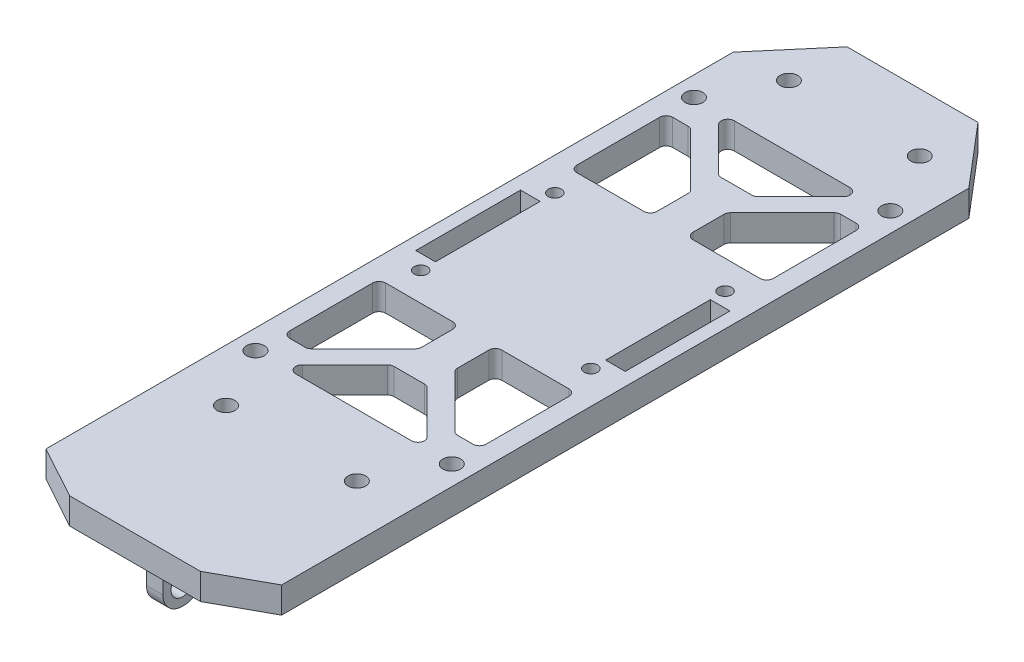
ISO-10303-21;
HEADER;
FILE_DESCRIPTION(('STEP AP214'),'2;1');
FILE_NAME('part.step','',(''),(''),'','','');
FILE_SCHEMA(('AUTOMOTIVE_DESIGN { 1 0 10303 214 1 1 1 1 }'));
ENDSEC;
DATA;
#1=APPLICATION_CONTEXT('core data for automotive mechanical design processes');
#2=APPLICATION_PROTOCOL_DEFINITION('international standard','automotive_design',2000,#1);
#3=PRODUCT_CONTEXT('',#1,'mechanical');
#4=PRODUCT('Part','Part','',(#3));
#5=PRODUCT_RELATED_PRODUCT_CATEGORY('part','',(#4));
#6=PRODUCT_DEFINITION_FORMATION('','',#4);
#7=PRODUCT_DEFINITION_CONTEXT('part definition',#1,'design');
#8=PRODUCT_DEFINITION('design','',#6,#7);
#9=PRODUCT_DEFINITION_SHAPE('','',#8);
#10=(LENGTH_UNIT() NAMED_UNIT(*) SI_UNIT(.MILLI.,.METRE.));
#11=(NAMED_UNIT(*) PLANE_ANGLE_UNIT() SI_UNIT($,.RADIAN.));
#12=(NAMED_UNIT(*) SI_UNIT($,.STERADIAN.) SOLID_ANGLE_UNIT());
#13=UNCERTAINTY_MEASURE_WITH_UNIT(LENGTH_MEASURE(1.E-05),#10,'distance_accuracy_value','');
#14=(GEOMETRIC_REPRESENTATION_CONTEXT(3) GLOBAL_UNCERTAINTY_ASSIGNED_CONTEXT((#13)) GLOBAL_UNIT_ASSIGNED_CONTEXT((#10,
#11,#12)) REPRESENTATION_CONTEXT('',''));
#15=CARTESIAN_POINT('',(0.,0.,0.));
#16=DIRECTION('',(0.,0.,1.));
#17=DIRECTION('',(1.,0.,0.));
#18=AXIS2_PLACEMENT_3D('',#15,#16,#17);
#19=CARTESIAN_POINT('',(0.,-7.5,0.));
#20=DIRECTION('',(0.,-1.,0.));
#21=DIRECTION('',(0.,0.,-1.));
#22=AXIS2_PLACEMENT_3D('',#19,#20,#21);
#23=PLANE('',#22);
#24=CARTESIAN_POINT('',(-9.99466666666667,-7.5,43.0023280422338));
#25=DIRECTION('',(0.,-1.,0.));
#26=DIRECTION('',(0.,0.,-1.));
#27=AXIS2_PLACEMENT_3D('',#24,#25,#26);
#28=CIRCLE('',#27,1.35);
#29=CARTESIAN_POINT('',(-9.99466666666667,-7.5,41.6523280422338));
#30=VERTEX_POINT('',#29);
#31=EDGE_CURVE('E681',#30,#30,#28,.T.);
#32=ORIENTED_EDGE('',*,*,#31,.F.);
#33=EDGE_LOOP('',(#32));
#34=FACE_BOUND('',#33,.T.);
#35=CARTESIAN_POINT('',(9.99466666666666,-7.5,43.0023280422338));
#36=DIRECTION('',(0.,-1.,0.));
#37=DIRECTION('',(0.,0.,-1.));
#38=AXIS2_PLACEMENT_3D('',#35,#36,#37);
#39=CIRCLE('',#38,1.35);
#40=CARTESIAN_POINT('',(9.99466666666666,-7.5,41.6523280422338));
#41=VERTEX_POINT('',#40);
#42=EDGE_CURVE('E675',#41,#41,#39,.T.);
#43=ORIENTED_EDGE('',*,*,#42,.F.);
#44=EDGE_LOOP('',(#43));
#45=FACE_BOUND('',#44,.T.);
#46=DIRECTION('',(0.,0.,1.));
#47=VECTOR('',#46,1.);
#48=CARTESIAN_POINT('',(-18.,-7.5,0.));
#49=LINE('',#48,#47);
#50=CARTESIAN_POINT('',(-18.,-7.5,-42.5));
#51=VERTEX_POINT('',#50);
#52=CARTESIAN_POINT('',(-18.,-7.5,62.5));
#53=VERTEX_POINT('',#52);
#54=EDGE_CURVE('E886',#51,#53,#49,.T.);
#55=ORIENTED_EDGE('',*,*,#54,.F.);
#56=DIRECTION('',(-0.648118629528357,0.,0.761539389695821));
#57=VECTOR('',#56,1.);
#58=CARTESIAN_POINT('',(-31.4155946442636,-7.5,-26.7366762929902));
#59=LINE('',#58,#57);
#60=CARTESIAN_POINT('',(-10.,-7.5,-51.9));
#61=VERTEX_POINT('',#60);
#62=EDGE_CURVE('E691',#61,#51,#59,.T.);
#63=ORIENTED_EDGE('',*,*,#62,.F.);
#64=DIRECTION('',(1.,0.,0.));
#65=VECTOR('',#64,1.);
#66=CARTESIAN_POINT('',(0.,-7.5,-51.9));
#67=LINE('',#66,#65);
#68=CARTESIAN_POINT('',(10.,-7.5,-51.9));
#69=VERTEX_POINT('',#68);
#70=EDGE_CURVE('E688',#61,#69,#67,.T.);
#71=ORIENTED_EDGE('',*,*,#70,.T.);
#72=DIRECTION('',(0.648118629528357,0.,0.761539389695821));
#73=VECTOR('',#72,1.);
#74=CARTESIAN_POINT('',(31.4155946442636,-7.5,-26.7366762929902));
#75=LINE('',#74,#73);
#76=CARTESIAN_POINT('',(18.,-7.5,-42.5));
#77=VERTEX_POINT('',#76);
#78=EDGE_CURVE('E685',#69,#77,#75,.T.);
#79=ORIENTED_EDGE('',*,*,#78,.T.);
#80=DIRECTION('',(0.,0.,1.));
#81=VECTOR('',#80,1.);
#82=CARTESIAN_POINT('',(18.,-7.5,0.));
#83=LINE('',#82,#81);
#84=CARTESIAN_POINT('',(18.,-7.5,62.5));
#85=VERTEX_POINT('',#84);
#86=EDGE_CURVE('E888',#77,#85,#83,.T.);
#87=ORIENTED_EDGE('',*,*,#86,.T.);
#88=DIRECTION('',(0.876215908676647,0.,-0.481918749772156));
#89=VECTOR('',#88,1.);
#90=CARTESIAN_POINT('',(30.5719769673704,-7.5,55.5854126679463));
#91=LINE('',#90,#89);
#92=CARTESIAN_POINT('',(10.,-7.5,66.9));
#93=VERTEX_POINT('',#92);
#94=EDGE_CURVE('E782',#93,#85,#91,.T.);
#95=ORIENTED_EDGE('',*,*,#94,.F.);
#96=DIRECTION('',(1.,0.,0.));
#97=VECTOR('',#96,1.);
#98=CARTESIAN_POINT('',(0.,-7.5,66.9));
#99=LINE('',#98,#97);
#100=CARTESIAN_POINT('',(-10.,-7.5,66.9));
#101=VERTEX_POINT('',#100);
#102=EDGE_CURVE('E789',#101,#93,#99,.T.);
#103=ORIENTED_EDGE('',*,*,#102,.F.);
#104=DIRECTION('',(0.876215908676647,0.,0.481918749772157));
#105=VECTOR('',#104,1.);
#106=CARTESIAN_POINT('',(-30.5719769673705,-7.5,55.5854126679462));
#107=LINE('',#106,#105);
#108=EDGE_CURVE('E785',#53,#101,#107,.T.);
#109=ORIENTED_EDGE('',*,*,#108,.F.);
#110=EDGE_LOOP('',(#55,#63,#71,#79,#87,#95,#103,#109));
#111=FACE_BOUND('',#110,.T.);
#112=CARTESIAN_POINT('',(15.,-7.5,33.5));
#113=DIRECTION('',(0.,-1.,0.));
#114=DIRECTION('',(0.,0.,-1.));
#115=AXIS2_PLACEMENT_3D('',#112,#113,#114);
#116=CIRCLE('',#115,1.375);
#117=CARTESIAN_POINT('',(15.,-7.5,32.125));
#118=VERTEX_POINT('',#117);
#119=EDGE_CURVE('E747',#118,#118,#116,.T.);
#120=ORIENTED_EDGE('',*,*,#119,.F.);
#121=EDGE_LOOP('',(#120));
#122=FACE_BOUND('',#121,.T.);
#123=CARTESIAN_POINT('',(-15.,-7.5,33.5));
#124=DIRECTION('',(0.,-1.,0.));
#125=DIRECTION('',(0.,0.,-1.));
#126=AXIS2_PLACEMENT_3D('',#123,#124,#125);
#127=CIRCLE('',#126,1.375);
#128=CARTESIAN_POINT('',(-15.,-7.5,32.125));
#129=VERTEX_POINT('',#128);
#130=EDGE_CURVE('E753',#129,#129,#127,.T.);
#131=ORIENTED_EDGE('',*,*,#130,.F.);
#132=EDGE_LOOP('',(#131));
#133=FACE_BOUND('',#132,.T.);
#134=DIRECTION('',(0.,0.,1.));
#135=VECTOR('',#134,1.);
#136=CARTESIAN_POINT('',(-2.75,-7.5,0.));
#137=LINE('',#136,#135);
#138=CARTESIAN_POINT('',(-2.75,-7.5,15.6));
#139=VERTEX_POINT('',#138);
#140=CARTESIAN_POINT('',(-2.75,-7.5,20.3431457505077));
#141=VERTEX_POINT('',#140);
#142=EDGE_CURVE('E815',#139,#141,#137,.T.);
#143=ORIENTED_EDGE('',*,*,#142,.F.);
#144=CARTESIAN_POINT('',(-3.75,-7.5,15.6));
#145=DIRECTION('',(0.,-1.,0.));
#146=DIRECTION('',(0.,0.,-1.));
#147=AXIS2_PLACEMENT_3D('',#144,#145,#146);
#148=CIRCLE('',#147,1.);
#149=CARTESIAN_POINT('',(-3.75,-7.5,14.6));
#150=VERTEX_POINT('',#149);
#151=EDGE_CURVE('E1232',#139,#150,#148,.F.);
#152=ORIENTED_EDGE('',*,*,#151,.T.);
#153=DIRECTION('',(1.,0.,0.));
#154=VECTOR('',#153,1.);
#155=CARTESIAN_POINT('',(0.,-7.5,14.6));
#156=LINE('',#155,#154);
#157=CARTESIAN_POINT('',(-14.,-7.5,14.6));
#158=VERTEX_POINT('',#157);
#159=EDGE_CURVE('E816',#158,#150,#156,.T.);
#160=ORIENTED_EDGE('',*,*,#159,.F.);
#161=CARTESIAN_POINT('',(-14.,-7.5,15.6));
#162=DIRECTION('',(0.,-1.,0.));
#163=DIRECTION('',(0.,0.,-1.));
#164=AXIS2_PLACEMENT_3D('',#161,#162,#163);
#165=CIRCLE('',#164,1.);
#166=CARTESIAN_POINT('',(-15.,-7.5,15.6));
#167=VERTEX_POINT('',#166);
#168=EDGE_CURVE('E1240',#158,#167,#165,.F.);
#169=ORIENTED_EDGE('',*,*,#168,.T.);
#170=DIRECTION('',(0.,0.,-1.));
#171=VECTOR('',#170,1.);
#172=CARTESIAN_POINT('',(-15.,-7.5,0.));
#173=LINE('',#172,#171);
#174=CARTESIAN_POINT('',(-15.,-7.5,28.2573593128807));
#175=VERTEX_POINT('',#174);
#176=EDGE_CURVE('E819',#175,#167,#173,.T.);
#177=ORIENTED_EDGE('',*,*,#176,.F.);
#178=CARTESIAN_POINT('',(-14.,-7.5,28.2573593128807));
#179=DIRECTION('',(0.,-1.,0.));
#180=DIRECTION('',(0.,0.,-1.));
#181=AXIS2_PLACEMENT_3D('',#178,#179,#180);
#182=CIRCLE('',#181,1.);
#183=CARTESIAN_POINT('',(-14.,-7.5,29.2573593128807));
#184=VERTEX_POINT('',#183);
#185=EDGE_CURVE('E1248',#175,#184,#182,.F.);
#186=ORIENTED_EDGE('',*,*,#185,.T.);
#187=DIRECTION('',(-1.,0.,0.));
#188=VECTOR('',#187,1.);
#189=CARTESIAN_POINT('',(1.35342474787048E-13,-7.5,29.2573593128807));
#190=LINE('',#189,#188);
#191=CARTESIAN_POINT('',(-11.6642135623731,-7.5,29.2573593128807));
#192=VERTEX_POINT('',#191);
#193=EDGE_CURVE('E822',#192,#184,#190,.T.);
#194=ORIENTED_EDGE('',*,*,#193,.F.);
#195=CARTESIAN_POINT('',(-11.6642135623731,-7.5,28.2573593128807));
#196=DIRECTION('',(0.,-1.,0.));
#197=DIRECTION('',(0.,0.,-1.));
#198=AXIS2_PLACEMENT_3D('',#195,#196,#197);
#199=CIRCLE('',#198,1.);
#200=CARTESIAN_POINT('',(-10.9571067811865,-7.5,28.9644660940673));
#201=VERTEX_POINT('',#200);
#202=EDGE_CURVE('E1244',#192,#201,#199,.F.);
#203=ORIENTED_EDGE('',*,*,#202,.T.);
#204=DIRECTION('',(-0.707106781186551,0.,0.707106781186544));
#205=VECTOR('',#204,1.);
#206=CARTESIAN_POINT('',(9.00367965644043,-7.5,9.00367965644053));
#207=LINE('',#206,#205);
#208=CARTESIAN_POINT('',(-3.04289321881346,-7.5,21.0502525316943));
#209=VERTEX_POINT('',#208);
#210=EDGE_CURVE('E825',#209,#201,#207,.T.);
#211=ORIENTED_EDGE('',*,*,#210,.F.);
#212=CARTESIAN_POINT('',(-3.75,-7.5,20.3431457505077));
#213=DIRECTION('',(0.,-1.,0.));
#214=DIRECTION('',(0.,0.,-1.));
#215=AXIS2_PLACEMENT_3D('',#212,#213,#214);
#216=CIRCLE('',#215,1.);
#217=EDGE_CURVE('E1236',#209,#141,#216,.F.);
#218=ORIENTED_EDGE('',*,*,#217,.T.);
#219=EDGE_LOOP('',(#143,#152,#160,#169,#177,#186,#194,#203,#211,#218));
#220=FACE_BOUND('',#219,.T.);
#221=DIRECTION('',(1.,0.,0.));
#222=VECTOR('',#221,1.);
#223=CARTESIAN_POINT('',(0.,-7.5,25.0000000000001));
#224=LINE('',#223,#222);
#225=CARTESIAN_POINT('',(-2.33578643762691,-7.5,25.0000000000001));
#226=VERTEX_POINT('',#225);
#227=CARTESIAN_POINT('',(2.33578643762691,-7.5,25.0000000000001));
#228=VERTEX_POINT('',#227);
#229=EDGE_CURVE('E828',#226,#228,#224,.T.);
#230=ORIENTED_EDGE('',*,*,#229,.F.);
#231=CARTESIAN_POINT('',(-2.33578643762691,-7.5,26.0000000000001));
#232=DIRECTION('',(0.,-1.,0.));
#233=DIRECTION('',(0.,0.,-1.));
#234=AXIS2_PLACEMENT_3D('',#231,#232,#233);
#235=CIRCLE('',#234,1.);
#236=CARTESIAN_POINT('',(-3.04289321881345,-7.5,25.2928932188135));
#237=VERTEX_POINT('',#236);
#238=EDGE_CURVE('E1224',#226,#237,#235,.F.);
#239=ORIENTED_EDGE('',*,*,#238,.T.);
#240=DIRECTION('',(-0.707106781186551,0.,0.707106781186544));
#241=VECTOR('',#240,1.);
#242=CARTESIAN_POINT('',(11.1250000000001,-7.5,11.1250000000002));
#243=LINE('',#242,#241);
#244=CARTESIAN_POINT('',(-9.54289321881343,-7.5,31.7928932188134));
#245=VERTEX_POINT('',#244);
#246=EDGE_CURVE('E831',#237,#245,#243,.T.);
#247=ORIENTED_EDGE('',*,*,#246,.T.);
#248=CARTESIAN_POINT('',(-8.83578643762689,-7.5,32.5));
#249=DIRECTION('',(0.,-1.,0.));
#250=DIRECTION('',(0.,0.,-1.));
#251=AXIS2_PLACEMENT_3D('',#248,#249,#250);
#252=CIRCLE('',#251,1.);
#253=CARTESIAN_POINT('',(-8.83578643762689,-7.5,33.5));
#254=VERTEX_POINT('',#253);
#255=EDGE_CURVE('E1228',#245,#254,#252,.F.);
#256=ORIENTED_EDGE('',*,*,#255,.T.);
#257=DIRECTION('',(1.,0.,0.));
#258=VECTOR('',#257,1.);
#259=CARTESIAN_POINT('',(0.,-7.5,33.5));
#260=LINE('',#259,#258);
#261=CARTESIAN_POINT('',(8.83578643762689,-7.5,33.5));
#262=VERTEX_POINT('',#261);
#263=EDGE_CURVE('E834',#254,#262,#260,.T.);
#264=ORIENTED_EDGE('',*,*,#263,.T.);
#265=CARTESIAN_POINT('',(8.83578643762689,-7.5,32.5));
#266=DIRECTION('',(0.,-1.,0.));
#267=DIRECTION('',(0.,0.,-1.));
#268=AXIS2_PLACEMENT_3D('',#265,#266,#267);
#269=CIRCLE('',#268,1.);
#270=CARTESIAN_POINT('',(9.54289321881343,-7.5,31.7928932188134));
#271=VERTEX_POINT('',#270);
#272=EDGE_CURVE('E1216',#262,#271,#269,.F.);
#273=ORIENTED_EDGE('',*,*,#272,.T.);
#274=DIRECTION('',(-0.707106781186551,0.,-0.707106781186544));
#275=VECTOR('',#274,1.);
#276=CARTESIAN_POINT('',(-11.1250000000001,-7.5,11.1250000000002));
#277=LINE('',#276,#275);
#278=CARTESIAN_POINT('',(3.04289321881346,-7.5,25.2928932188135));
#279=VERTEX_POINT('',#278);
#280=EDGE_CURVE('E837',#271,#279,#277,.T.);
#281=ORIENTED_EDGE('',*,*,#280,.T.);
#282=CARTESIAN_POINT('',(2.33578643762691,-7.5,26.0000000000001));
#283=DIRECTION('',(0.,-1.,0.));
#284=DIRECTION('',(0.,0.,-1.));
#285=AXIS2_PLACEMENT_3D('',#282,#283,#284);
#286=CIRCLE('',#285,1.);
#287=EDGE_CURVE('E1220',#279,#228,#286,.F.);
#288=ORIENTED_EDGE('',*,*,#287,.T.);
#289=EDGE_LOOP('',(#230,#239,#247,#256,#264,#273,#281,#288));
#290=FACE_BOUND('',#289,.T.);
#291=DIRECTION('',(0.,0.,-1.));
#292=VECTOR('',#291,1.);
#293=CARTESIAN_POINT('',(2.75,-7.5,0.));
#294=LINE('',#293,#292);
#295=CARTESIAN_POINT('',(2.75,-7.5,20.3431457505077));
#296=VERTEX_POINT('',#295);
#297=CARTESIAN_POINT('',(2.75,-7.5,15.6));
#298=VERTEX_POINT('',#297);
#299=EDGE_CURVE('E840',#296,#298,#294,.T.);
#300=ORIENTED_EDGE('',*,*,#299,.F.);
#301=CARTESIAN_POINT('',(3.75,-7.5,20.3431457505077));
#302=DIRECTION('',(0.,-1.,0.));
#303=DIRECTION('',(0.,0.,-1.));
#304=AXIS2_PLACEMENT_3D('',#301,#302,#303);
#305=CIRCLE('',#304,1.);
#306=CARTESIAN_POINT('',(3.04289321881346,-7.5,21.0502525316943));
#307=VERTEX_POINT('',#306);
#308=EDGE_CURVE('E1208',#296,#307,#305,.F.);
#309=ORIENTED_EDGE('',*,*,#308,.T.);
#310=DIRECTION('',(0.707106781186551,0.,0.707106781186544));
#311=VECTOR('',#310,1.);
#312=CARTESIAN_POINT('',(-9.00367965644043,-7.5,9.00367965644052));
#313=LINE('',#312,#311);
#314=CARTESIAN_POINT('',(10.9571067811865,-7.5,28.9644660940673));
#315=VERTEX_POINT('',#314);
#316=EDGE_CURVE('E846',#307,#315,#313,.T.);
#317=ORIENTED_EDGE('',*,*,#316,.T.);
#318=CARTESIAN_POINT('',(11.6642135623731,-7.5,28.2573593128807));
#319=DIRECTION('',(0.,-1.,0.));
#320=DIRECTION('',(0.,0.,-1.));
#321=AXIS2_PLACEMENT_3D('',#318,#319,#320);
#322=CIRCLE('',#321,1.);
#323=CARTESIAN_POINT('',(11.6642135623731,-7.5,29.2573593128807));
#324=VERTEX_POINT('',#323);
#325=EDGE_CURVE('E1195',#315,#324,#322,.F.);
#326=ORIENTED_EDGE('',*,*,#325,.T.);
#327=DIRECTION('',(1.,0.,0.));
#328=VECTOR('',#327,1.);
#329=CARTESIAN_POINT('',(0.,-7.5,29.2573593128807));
#330=LINE('',#329,#328);
#331=CARTESIAN_POINT('',(14.,-7.5,29.2573593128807));
#332=VERTEX_POINT('',#331);
#333=EDGE_CURVE('E849',#324,#332,#330,.T.);
#334=ORIENTED_EDGE('',*,*,#333,.T.);
#335=CARTESIAN_POINT('',(14.,-7.5,28.2573593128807));
#336=DIRECTION('',(0.,-1.,0.));
#337=DIRECTION('',(0.,0.,-1.));
#338=AXIS2_PLACEMENT_3D('',#335,#336,#337);
#339=CIRCLE('',#338,1.);
#340=CARTESIAN_POINT('',(15.,-7.5,28.2573593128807));
#341=VERTEX_POINT('',#340);
#342=EDGE_CURVE('E1199',#332,#341,#339,.F.);
#343=ORIENTED_EDGE('',*,*,#342,.T.);
#344=DIRECTION('',(0.,0.,-1.));
#345=VECTOR('',#344,1.);
#346=CARTESIAN_POINT('',(15.,-7.5,0.));
#347=LINE('',#346,#345);
#348=CARTESIAN_POINT('',(15.,-7.5,15.6));
#349=VERTEX_POINT('',#348);
#350=EDGE_CURVE('E852',#341,#349,#347,.T.);
#351=ORIENTED_EDGE('',*,*,#350,.T.);
#352=CARTESIAN_POINT('',(14.,-7.5,15.6));
#353=DIRECTION('',(0.,-1.,0.));
#354=DIRECTION('',(0.,0.,-1.));
#355=AXIS2_PLACEMENT_3D('',#352,#353,#354);
#356=CIRCLE('',#355,1.);
#357=CARTESIAN_POINT('',(14.,-7.5,14.6));
#358=VERTEX_POINT('',#357);
#359=EDGE_CURVE('E1204',#349,#358,#356,.F.);
#360=ORIENTED_EDGE('',*,*,#359,.T.);
#361=DIRECTION('',(-1.,0.,0.));
#362=VECTOR('',#361,1.);
#363=CARTESIAN_POINT('',(0.,-7.5,14.6));
#364=LINE('',#363,#362);
#365=CARTESIAN_POINT('',(3.75,-7.5,14.6));
#366=VERTEX_POINT('',#365);
#367=EDGE_CURVE('E845',#358,#366,#364,.T.);
#368=ORIENTED_EDGE('',*,*,#367,.T.);
#369=CARTESIAN_POINT('',(3.75,-7.5,15.6));
#370=DIRECTION('',(0.,-1.,0.));
#371=DIRECTION('',(0.,0.,-1.));
#372=AXIS2_PLACEMENT_3D('',#369,#370,#371);
#373=CIRCLE('',#372,1.);
#374=EDGE_CURVE('E1212',#366,#298,#373,.F.);
#375=ORIENTED_EDGE('',*,*,#374,.T.);
#376=EDGE_LOOP('',(#300,#309,#317,#326,#334,#343,#351,#360,#368,#375));
#377=FACE_BOUND('',#376,.T.);
#378=CARTESIAN_POINT('',(2.75,-7.5,-15.6));
#379=VERTEX_POINT('',#378);
#380=CARTESIAN_POINT('',(2.75,-7.5,-20.3431457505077));
#381=VERTEX_POINT('',#380);
#382=EDGE_CURVE('E841',#379,#381,#294,.T.);
#383=ORIENTED_EDGE('',*,*,#382,.F.);
#384=CARTESIAN_POINT('',(3.75,-7.5,-15.6));
#385=DIRECTION('',(0.,-1.,0.));
#386=DIRECTION('',(0.,0.,-1.));
#387=AXIS2_PLACEMENT_3D('',#384,#385,#386);
#388=CIRCLE('',#387,1.);
#389=CARTESIAN_POINT('',(3.75,-7.5,-14.6));
#390=VERTEX_POINT('',#389);
#391=EDGE_CURVE('E1264',#379,#390,#388,.F.);
#392=ORIENTED_EDGE('',*,*,#391,.T.);
#393=DIRECTION('',(-1.,0.,0.));
#394=VECTOR('',#393,1.);
#395=CARTESIAN_POINT('',(0.,-7.5,-14.6));
#396=LINE('',#395,#394);
#397=CARTESIAN_POINT('',(14.,-7.5,-14.6));
#398=VERTEX_POINT('',#397);
#399=EDGE_CURVE('E844',#398,#390,#396,.T.);
#400=ORIENTED_EDGE('',*,*,#399,.F.);
#401=CARTESIAN_POINT('',(14.,-7.5,-15.6));
#402=DIRECTION('',(0.,-1.,0.));
#403=DIRECTION('',(0.,0.,-1.));
#404=AXIS2_PLACEMENT_3D('',#401,#402,#403);
#405=CIRCLE('',#404,1.);
#406=CARTESIAN_POINT('',(15.,-7.5,-15.6));
#407=VERTEX_POINT('',#406);
#408=EDGE_CURVE('E1268',#398,#407,#405,.F.);
#409=ORIENTED_EDGE('',*,*,#408,.T.);
#410=DIRECTION('',(0.,0.,1.));
#411=VECTOR('',#410,1.);
#412=CARTESIAN_POINT('',(15.,-7.5,0.));
#413=LINE('',#412,#411);
#414=CARTESIAN_POINT('',(15.,-7.5,-28.2573593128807));
#415=VERTEX_POINT('',#414);
#416=EDGE_CURVE('E859',#415,#407,#413,.T.);
#417=ORIENTED_EDGE('',*,*,#416,.F.);
#418=CARTESIAN_POINT('',(14.,-7.5,-28.2573593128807));
#419=DIRECTION('',(0.,-1.,0.));
#420=DIRECTION('',(0.,0.,-1.));
#421=AXIS2_PLACEMENT_3D('',#418,#419,#420);
#422=CIRCLE('',#421,1.);
#423=CARTESIAN_POINT('',(14.,-7.5,-29.2573593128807));
#424=VERTEX_POINT('',#423);
#425=EDGE_CURVE('E1256',#415,#424,#422,.F.);
#426=ORIENTED_EDGE('',*,*,#425,.T.);
#427=DIRECTION('',(1.,0.,0.));
#428=VECTOR('',#427,1.);
#429=CARTESIAN_POINT('',(0.,-7.5,-29.2573593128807));
#430=LINE('',#429,#428);
#431=CARTESIAN_POINT('',(11.6642135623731,-7.5,-29.2573593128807));
#432=VERTEX_POINT('',#431);
#433=EDGE_CURVE('E862',#432,#424,#430,.T.);
#434=ORIENTED_EDGE('',*,*,#433,.F.);
#435=CARTESIAN_POINT('',(11.6642135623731,-7.5,-28.2573593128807));
#436=DIRECTION('',(0.,-1.,0.));
#437=DIRECTION('',(0.,0.,-1.));
#438=AXIS2_PLACEMENT_3D('',#435,#436,#437);
#439=CIRCLE('',#438,1.);
#440=CARTESIAN_POINT('',(10.9571067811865,-7.5,-28.9644660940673));
#441=VERTEX_POINT('',#440);
#442=EDGE_CURVE('E1252',#432,#441,#439,.F.);
#443=ORIENTED_EDGE('',*,*,#442,.T.);
#444=DIRECTION('',(0.707106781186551,0.,-0.707106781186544));
#445=VECTOR('',#444,1.);
#446=CARTESIAN_POINT('',(-9.00367965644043,-7.5,-9.00367965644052));
#447=LINE('',#446,#445);
#448=CARTESIAN_POINT('',(3.04289321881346,-7.5,-21.0502525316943));
#449=VERTEX_POINT('',#448);
#450=EDGE_CURVE('E865',#449,#441,#447,.T.);
#451=ORIENTED_EDGE('',*,*,#450,.F.);
#452=CARTESIAN_POINT('',(3.75,-7.5,-20.3431457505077));
#453=DIRECTION('',(0.,-1.,0.));
#454=DIRECTION('',(0.,0.,-1.));
#455=AXIS2_PLACEMENT_3D('',#452,#453,#454);
#456=CIRCLE('',#455,1.);
#457=EDGE_CURVE('E1260',#449,#381,#456,.F.);
#458=ORIENTED_EDGE('',*,*,#457,.T.);
#459=EDGE_LOOP('',(#383,#392,#400,#409,#417,#426,#434,#443,#451,#458));
#460=FACE_BOUND('',#459,.T.);
#461=DIRECTION('',(-0.707106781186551,0.,-0.707106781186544));
#462=VECTOR('',#461,1.);
#463=CARTESIAN_POINT('',(11.1250000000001,-7.5,-11.1250000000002));
#464=LINE('',#463,#462);
#465=CARTESIAN_POINT('',(-3.04289321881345,-7.5,-25.2928932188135));
#466=VERTEX_POINT('',#465);
#467=CARTESIAN_POINT('',(-9.54289321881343,-7.5,-31.7928932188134));
#468=VERTEX_POINT('',#467);
#469=EDGE_CURVE('E877',#466,#468,#464,.T.);
#470=ORIENTED_EDGE('',*,*,#469,.F.);
#471=CARTESIAN_POINT('',(-2.33578643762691,-7.5,-26.0000000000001));
#472=DIRECTION('',(0.,-1.,0.));
#473=DIRECTION('',(0.,0.,-1.));
#474=AXIS2_PLACEMENT_3D('',#471,#472,#473);
#475=CIRCLE('',#474,1.);
#476=CARTESIAN_POINT('',(-2.33578643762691,-7.5,-25.0000000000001));
#477=VERTEX_POINT('',#476);
#478=EDGE_CURVE('E1280',#466,#477,#475,.F.);
#479=ORIENTED_EDGE('',*,*,#478,.T.);
#480=DIRECTION('',(1.,0.,0.));
#481=VECTOR('',#480,1.);
#482=CARTESIAN_POINT('',(0.,-7.5,-25.0000000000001));
#483=LINE('',#482,#481);
#484=CARTESIAN_POINT('',(2.33578643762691,-7.5,-25.0000000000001));
#485=VERTEX_POINT('',#484);
#486=EDGE_CURVE('E868',#477,#485,#483,.T.);
#487=ORIENTED_EDGE('',*,*,#486,.T.);
#488=CARTESIAN_POINT('',(2.33578643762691,-7.5,-26.0000000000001));
#489=DIRECTION('',(0.,-1.,0.));
#490=DIRECTION('',(0.,0.,-1.));
#491=AXIS2_PLACEMENT_3D('',#488,#489,#490);
#492=CIRCLE('',#491,1.);
#493=CARTESIAN_POINT('',(3.04289321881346,-7.5,-25.2928932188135));
#494=VERTEX_POINT('',#493);
#495=EDGE_CURVE('E1284',#485,#494,#492,.F.);
#496=ORIENTED_EDGE('',*,*,#495,.T.);
#497=DIRECTION('',(-0.707106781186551,0.,0.707106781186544));
#498=VECTOR('',#497,1.);
#499=CARTESIAN_POINT('',(-11.1250000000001,-7.5,-11.1250000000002));
#500=LINE('',#499,#498);
#501=CARTESIAN_POINT('',(9.54289321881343,-7.5,-31.7928932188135));
#502=VERTEX_POINT('',#501);
#503=EDGE_CURVE('E871',#502,#494,#500,.T.);
#504=ORIENTED_EDGE('',*,*,#503,.F.);
#505=CARTESIAN_POINT('',(8.83578643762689,-7.5,-32.5));
#506=DIRECTION('',(0.,-1.,0.));
#507=DIRECTION('',(0.,0.,-1.));
#508=AXIS2_PLACEMENT_3D('',#505,#506,#507);
#509=CIRCLE('',#508,1.);
#510=CARTESIAN_POINT('',(8.83578643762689,-7.5,-33.5));
#511=VERTEX_POINT('',#510);
#512=EDGE_CURVE('E1272',#502,#511,#509,.F.);
#513=ORIENTED_EDGE('',*,*,#512,.T.);
#514=DIRECTION('',(1.,0.,0.));
#515=VECTOR('',#514,1.);
#516=CARTESIAN_POINT('',(0.,-7.5,-33.5));
#517=LINE('',#516,#515);
#518=CARTESIAN_POINT('',(-8.83578643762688,-7.5,-33.5));
#519=VERTEX_POINT('',#518);
#520=EDGE_CURVE('E874',#519,#511,#517,.T.);
#521=ORIENTED_EDGE('',*,*,#520,.F.);
#522=CARTESIAN_POINT('',(-8.83578643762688,-7.5,-32.5));
#523=DIRECTION('',(0.,-1.,0.));
#524=DIRECTION('',(0.,0.,-1.));
#525=AXIS2_PLACEMENT_3D('',#522,#523,#524);
#526=CIRCLE('',#525,1.);
#527=EDGE_CURVE('E1276',#519,#468,#526,.F.);
#528=ORIENTED_EDGE('',*,*,#527,.T.);
#529=EDGE_LOOP('',(#470,#479,#487,#496,#504,#513,#521,#528));
#530=FACE_BOUND('',#529,.T.);
#531=CARTESIAN_POINT('',(15.,-7.5,-33.5));
#532=DIRECTION('',(0.,-1.,0.));
#533=DIRECTION('',(0.,0.,-1.));
#534=AXIS2_PLACEMENT_3D('',#531,#532,#533);
#535=CIRCLE('',#534,1.35);
#536=CARTESIAN_POINT('',(15.,-7.5,-34.85));
#537=VERTEX_POINT('',#536);
#538=EDGE_CURVE('E880',#537,#537,#535,.T.);
#539=ORIENTED_EDGE('',*,*,#538,.F.);
#540=EDGE_LOOP('',(#539));
#541=FACE_BOUND('',#540,.T.);
#542=CARTESIAN_POINT('',(-15.,-7.5,-33.5));
#543=DIRECTION('',(0.,-1.,0.));
#544=DIRECTION('',(0.,0.,-1.));
#545=AXIS2_PLACEMENT_3D('',#542,#543,#544);
#546=CIRCLE('',#545,1.35);
#547=CARTESIAN_POINT('',(-15.,-7.5,-34.85));
#548=VERTEX_POINT('',#547);
#549=EDGE_CURVE('E883',#548,#548,#546,.T.);
#550=ORIENTED_EDGE('',*,*,#549,.F.);
#551=EDGE_LOOP('',(#550));
#552=FACE_BOUND('',#551,.T.);
#553=DIRECTION('',(-1.,0.,0.));
#554=VECTOR('',#553,1.);
#555=CARTESIAN_POINT('',(0.,-7.5,-8.00000000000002));
#556=LINE('',#555,#554);
#557=CARTESIAN_POINT('',(16.,-7.5,-8.00000000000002));
#558=VERTEX_POINT('',#557);
#559=CARTESIAN_POINT('',(13.,-7.5,-8.00000000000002));
#560=VERTEX_POINT('',#559);
#561=EDGE_CURVE('E890',#558,#560,#556,.T.);
#562=ORIENTED_EDGE('',*,*,#561,.T.);
#563=DIRECTION('',(0.,0.,1.));
#564=VECTOR('',#563,1.);
#565=CARTESIAN_POINT('',(13.,-7.5,0.));
#566=LINE('',#565,#564);
#567=CARTESIAN_POINT('',(13.,-7.5,7.99999999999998));
#568=VERTEX_POINT('',#567);
#569=EDGE_CURVE('E893',#560,#568,#566,.T.);
#570=ORIENTED_EDGE('',*,*,#569,.T.);
#571=DIRECTION('',(-1.,0.,0.));
#572=VECTOR('',#571,1.);
#573=CARTESIAN_POINT('',(0.,-7.5,7.99999999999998));
#574=LINE('',#573,#572);
#575=CARTESIAN_POINT('',(16.,-7.5,7.99999999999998));
#576=VERTEX_POINT('',#575);
#577=EDGE_CURVE('E895',#576,#568,#574,.T.);
#578=ORIENTED_EDGE('',*,*,#577,.F.);
#579=DIRECTION('',(0.,0.,1.));
#580=VECTOR('',#579,1.);
#581=CARTESIAN_POINT('',(16.,-7.5,0.));
#582=LINE('',#581,#580);
#583=EDGE_CURVE('E898',#558,#576,#582,.T.);
#584=ORIENTED_EDGE('',*,*,#583,.F.);
#585=EDGE_LOOP('',(#562,#570,#578,#584));
#586=FACE_BOUND('',#585,.T.);
#587=DIRECTION('',(1.,0.,0.));
#588=VECTOR('',#587,1.);
#589=CARTESIAN_POINT('',(0.,-7.5,-8.00000000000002));
#590=LINE('',#589,#588);
#591=CARTESIAN_POINT('',(-16.,-7.5,-8.00000000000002));
#592=VERTEX_POINT('',#591);
#593=CARTESIAN_POINT('',(-13.,-7.5,-8.00000000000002));
#594=VERTEX_POINT('',#593);
#595=EDGE_CURVE('E901',#592,#594,#590,.T.);
#596=ORIENTED_EDGE('',*,*,#595,.F.);
#597=DIRECTION('',(0.,0.,1.));
#598=VECTOR('',#597,1.);
#599=CARTESIAN_POINT('',(-16.,-7.5,0.));
#600=LINE('',#599,#598);
#601=CARTESIAN_POINT('',(-16.,-7.5,7.99999999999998));
#602=VERTEX_POINT('',#601);
#603=EDGE_CURVE('E904',#592,#602,#600,.T.);
#604=ORIENTED_EDGE('',*,*,#603,.T.);
#605=DIRECTION('',(1.,0.,0.));
#606=VECTOR('',#605,1.);
#607=CARTESIAN_POINT('',(0.,-7.5,7.99999999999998));
#608=LINE('',#607,#606);
#609=CARTESIAN_POINT('',(-13.,-7.5,7.99999999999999));
#610=VERTEX_POINT('',#609);
#611=EDGE_CURVE('E907',#602,#610,#608,.T.);
#612=ORIENTED_EDGE('',*,*,#611,.T.);
#613=DIRECTION('',(0.,0.,1.));
#614=VECTOR('',#613,1.);
#615=CARTESIAN_POINT('',(-13.,-7.5,0.));
#616=LINE('',#615,#614);
#617=EDGE_CURVE('E909',#594,#610,#616,.T.);
#618=ORIENTED_EDGE('',*,*,#617,.F.);
#619=EDGE_LOOP('',(#596,#604,#612,#618));
#620=FACE_BOUND('',#619,.T.);
#621=CARTESIAN_POINT('',(-2.75,-7.5,-20.3431457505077));
#622=VERTEX_POINT('',#621);
#623=CARTESIAN_POINT('',(-2.75,-7.5,-15.6));
#624=VERTEX_POINT('',#623);
#625=EDGE_CURVE('E810',#622,#624,#137,.T.);
#626=ORIENTED_EDGE('',*,*,#625,.F.);
#627=CARTESIAN_POINT('',(-3.75,-7.5,-20.3431457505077));
#628=DIRECTION('',(0.,-1.,0.));
#629=DIRECTION('',(0.,0.,-1.));
#630=AXIS2_PLACEMENT_3D('',#627,#628,#629);
#631=CIRCLE('',#630,1.);
#632=CARTESIAN_POINT('',(-3.04289321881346,-7.5,-21.0502525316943));
#633=VERTEX_POINT('',#632);
#634=EDGE_CURVE('E1305',#622,#633,#631,.F.);
#635=ORIENTED_EDGE('',*,*,#634,.T.);
#636=DIRECTION('',(-0.707106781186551,0.,-0.707106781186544));
#637=VECTOR('',#636,1.);
#638=CARTESIAN_POINT('',(9.00367965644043,-7.5,-9.00367965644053));
#639=LINE('',#638,#637);
#640=CARTESIAN_POINT('',(-10.9571067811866,-7.5,-28.9644660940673));
#641=VERTEX_POINT('',#640);
#642=EDGE_CURVE('E912',#633,#641,#639,.T.);
#643=ORIENTED_EDGE('',*,*,#642,.T.);
#644=CARTESIAN_POINT('',(-11.6642135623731,-7.5,-28.2573593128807));
#645=DIRECTION('',(0.,-1.,0.));
#646=DIRECTION('',(0.,0.,-1.));
#647=AXIS2_PLACEMENT_3D('',#644,#645,#646);
#648=CIRCLE('',#647,1.);
#649=CARTESIAN_POINT('',(-11.6642135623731,-7.5,-29.2573593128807));
#650=VERTEX_POINT('',#649);
#651=EDGE_CURVE('E1301',#641,#650,#648,.F.);
#652=ORIENTED_EDGE('',*,*,#651,.T.);
#653=DIRECTION('',(-1.,0.,0.));
#654=VECTOR('',#653,1.);
#655=CARTESIAN_POINT('',(1.35342474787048E-13,-7.5,-29.2573593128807));
#656=LINE('',#655,#654);
#657=CARTESIAN_POINT('',(-14.,-7.5,-29.2573593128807));
#658=VERTEX_POINT('',#657);
#659=EDGE_CURVE('E915',#650,#658,#656,.T.);
#660=ORIENTED_EDGE('',*,*,#659,.T.);
#661=CARTESIAN_POINT('',(-14.,-7.5,-28.2573593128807));
#662=DIRECTION('',(0.,-1.,0.));
#663=DIRECTION('',(0.,0.,-1.));
#664=AXIS2_PLACEMENT_3D('',#661,#662,#663);
#665=CIRCLE('',#664,1.);
#666=CARTESIAN_POINT('',(-15.,-7.5,-28.2573593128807));
#667=VERTEX_POINT('',#666);
#668=EDGE_CURVE('E1288',#658,#667,#665,.F.);
#669=ORIENTED_EDGE('',*,*,#668,.T.);
#670=DIRECTION('',(0.,0.,1.));
#671=VECTOR('',#670,1.);
#672=CARTESIAN_POINT('',(-15.,-7.5,0.));
#673=LINE('',#672,#671);
#674=CARTESIAN_POINT('',(-15.,-7.5,-15.6));
#675=VERTEX_POINT('',#674);
#676=EDGE_CURVE('E918',#667,#675,#673,.T.);
#677=ORIENTED_EDGE('',*,*,#676,.T.);
#678=CARTESIAN_POINT('',(-14.,-7.5,-15.6));
#679=DIRECTION('',(0.,-1.,0.));
#680=DIRECTION('',(0.,0.,-1.));
#681=AXIS2_PLACEMENT_3D('',#678,#679,#680);
#682=CIRCLE('',#681,1.);
#683=CARTESIAN_POINT('',(-14.,-7.5,-14.6));
#684=VERTEX_POINT('',#683);
#685=EDGE_CURVE('E1293',#675,#684,#682,.F.);
#686=ORIENTED_EDGE('',*,*,#685,.T.);
#687=DIRECTION('',(1.,0.,0.));
#688=VECTOR('',#687,1.);
#689=CARTESIAN_POINT('',(0.,-7.5,-14.6));
#690=LINE('',#689,#688);
#691=CARTESIAN_POINT('',(-3.75,-7.5,-14.6));
#692=VERTEX_POINT('',#691);
#693=EDGE_CURVE('E814',#684,#692,#690,.T.);
#694=ORIENTED_EDGE('',*,*,#693,.T.);
#695=CARTESIAN_POINT('',(-3.75,-7.5,-15.6));
#696=DIRECTION('',(0.,-1.,0.));
#697=DIRECTION('',(0.,0.,-1.));
#698=AXIS2_PLACEMENT_3D('',#695,#696,#697);
#699=CIRCLE('',#698,1.);
#700=EDGE_CURVE('E1297',#692,#624,#699,.F.);
#701=ORIENTED_EDGE('',*,*,#700,.T.);
#702=EDGE_LOOP('',(#626,#635,#643,#652,#660,#669,#677,#686,#694,#701));
#703=FACE_BOUND('',#702,.T.);
#704=DIRECTION('',(-1.,0.,0.));
#705=VECTOR('',#704,1.);
#706=CARTESIAN_POINT('',(-1.25,-7.5,63.9));
#707=LINE('',#706,#705);
#708=CARTESIAN_POINT('',(2.75,-7.5,63.9));
#709=VERTEX_POINT('',#708);
#710=CARTESIAN_POINT('',(-2.75,-7.5,63.9));
#711=VERTEX_POINT('',#710);
#712=EDGE_CURVE('E764',#709,#711,#707,.T.);
#713=ORIENTED_EDGE('',*,*,#712,.F.);
#714=DIRECTION('',(0.,0.,1.));
#715=VECTOR('',#714,1.);
#716=CARTESIAN_POINT('',(2.75000000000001,-7.5,0.));
#717=LINE('',#716,#715);
#718=CARTESIAN_POINT('',(2.75,-7.5,57.67));
#719=VERTEX_POINT('',#718);
#720=EDGE_CURVE('E1333',#709,#719,#717,.F.);
#721=ORIENTED_EDGE('',*,*,#720,.T.);
#722=DIRECTION('',(1.,0.,0.));
#723=VECTOR('',#722,1.);
#724=CARTESIAN_POINT('',(-1.25,-7.5,57.67));
#725=LINE('',#724,#723);
#726=CARTESIAN_POINT('',(-2.75,-7.5,57.67));
#727=VERTEX_POINT('',#726);
#728=EDGE_CURVE('E759',#727,#719,#725,.T.);
#729=ORIENTED_EDGE('',*,*,#728,.F.);
#730=DIRECTION('',(0.,0.,-1.));
#731=VECTOR('',#730,1.);
#732=CARTESIAN_POINT('',(-2.75000000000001,-7.5,0.));
#733=LINE('',#732,#731);
#734=EDGE_CURVE('E1330',#727,#711,#733,.F.);
#735=ORIENTED_EDGE('',*,*,#734,.T.);
#736=EDGE_LOOP('',(#713,#721,#729,#735));
#737=FACE_BOUND('',#736,.T.);
#738=CARTESIAN_POINT('',(9.99466666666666,-7.5,-43.0023280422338));
#739=DIRECTION('',(0.,-1.,0.));
#740=DIRECTION('',(0.,0.,-1.));
#741=AXIS2_PLACEMENT_3D('',#738,#739,#740);
#742=CIRCLE('',#741,1.35);
#743=CARTESIAN_POINT('',(9.99466666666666,-7.5,-44.3523280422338));
#744=VERTEX_POINT('',#743);
#745=EDGE_CURVE('E694',#744,#744,#742,.T.);
#746=ORIENTED_EDGE('',*,*,#745,.F.);
#747=EDGE_LOOP('',(#746));
#748=FACE_BOUND('',#747,.T.);
#749=CARTESIAN_POINT('',(-9.99466666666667,-7.5,-43.0023280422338));
#750=DIRECTION('',(0.,-1.,0.));
#751=DIRECTION('',(0.,0.,-1.));
#752=AXIS2_PLACEMENT_3D('',#749,#750,#751);
#753=CIRCLE('',#752,1.35);
#754=CARTESIAN_POINT('',(-9.99466666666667,-7.5,-44.3523280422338));
#755=VERTEX_POINT('',#754);
#756=EDGE_CURVE('E684',#755,#755,#753,.T.);
#757=ORIENTED_EDGE('',*,*,#756,.F.);
#758=EDGE_LOOP('',(#757));
#759=FACE_BOUND('',#758,.T.);
#760=DIRECTION('',(-1.,0.,0.));
#761=VECTOR('',#760,1.);
#762=CARTESIAN_POINT('',(11.3896696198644,-7.5,44.13));
#763=LINE('',#762,#761);
#764=CARTESIAN_POINT('',(2.75,-7.5,44.13));
#765=VERTEX_POINT('',#764);
#766=CARTESIAN_POINT('',(-2.75,-7.5,44.13));
#767=VERTEX_POINT('',#766);
#768=EDGE_CURVE('E652',#765,#767,#763,.T.);
#769=ORIENTED_EDGE('',*,*,#768,.F.);
#770=DIRECTION('',(0.,0.,1.));
#771=VECTOR('',#770,1.);
#772=CARTESIAN_POINT('',(2.75000000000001,-7.5,0.));
#773=LINE('',#772,#771);
#774=CARTESIAN_POINT('',(2.75000000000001,-7.5,37.9));
#775=VERTEX_POINT('',#774);
#776=EDGE_CURVE('E1357',#765,#775,#773,.F.);
#777=ORIENTED_EDGE('',*,*,#776,.T.);
#778=DIRECTION('',(-1.,0.,0.));
#779=VECTOR('',#778,1.);
#780=CARTESIAN_POINT('',(11.3896696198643,-7.5,37.9));
#781=LINE('',#780,#779);
#782=CARTESIAN_POINT('',(-2.75,-7.5,37.9));
#783=VERTEX_POINT('',#782);
#784=EDGE_CURVE('E654',#775,#783,#781,.T.);
#785=ORIENTED_EDGE('',*,*,#784,.T.);
#786=DIRECTION('',(0.,0.,-1.));
#787=VECTOR('',#786,1.);
#788=CARTESIAN_POINT('',(-2.75000000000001,-7.5,0.));
#789=LINE('',#788,#787);
#790=EDGE_CURVE('E1354',#783,#767,#789,.F.);
#791=ORIENTED_EDGE('',*,*,#790,.T.);
#792=EDGE_LOOP('',(#769,#777,#785,#791));
#793=FACE_BOUND('',#792,.T.);
#794=ADVANCED_FACE('F57',(#34,#45,#111,#122,#133,#220,#290,#377,#460,#530,#541,#552,#586,#620,
#703,#737,#748,#759,#793),#23,.T.);
#795=CARTESIAN_POINT('',(1.25,-15.5,63.9));
#796=DIRECTION('',(-1.,0.,0.));
#797=DIRECTION('',(0.,0.,1.));
#798=AXIS2_PLACEMENT_3D('',#795,#796,#797);
#799=PLANE('',#798);
#800=DIRECTION('',(0.,1.,0.));
#801=VECTOR('',#800,1.);
#802=CARTESIAN_POINT('',(1.25,-15.5,57.67));
#803=LINE('',#802,#801);
#804=CARTESIAN_POINT('',(1.25,-12.5,57.67));
#805=VERTEX_POINT('',#804);
#806=CARTESIAN_POINT('',(1.25,-9.,57.67));
#807=VERTEX_POINT('',#806);
#808=EDGE_CURVE('E775',#805,#807,#803,.T.);
#809=ORIENTED_EDGE('',*,*,#808,.T.);
#810=DIRECTION('',(0.,0.,1.));
#811=VECTOR('',#810,1.);
#812=CARTESIAN_POINT('',(1.25,-9.,63.9));
#813=LINE('',#812,#811);
#814=CARTESIAN_POINT('',(1.25,-9.,63.9));
#815=VERTEX_POINT('',#814);
#816=EDGE_CURVE('E1325',#807,#815,#813,.T.);
#817=ORIENTED_EDGE('',*,*,#816,.T.);
#818=DIRECTION('',(0.,1.,0.));
#819=VECTOR('',#818,1.);
#820=CARTESIAN_POINT('',(1.25,-15.5,63.9));
#821=LINE('',#820,#819);
#822=CARTESIAN_POINT('',(1.25,-12.5,63.9));
#823=VERTEX_POINT('',#822);
#824=EDGE_CURVE('E772',#823,#815,#821,.T.);
#825=ORIENTED_EDGE('',*,*,#824,.F.);
#826=CARTESIAN_POINT('',(1.25,-12.5,60.9));
#827=DIRECTION('',(-1.,0.,0.));
#828=DIRECTION('',(0.,0.,1.));
#829=AXIS2_PLACEMENT_3D('',#826,#827,#828);
#830=CIRCLE('',#829,3.);
#831=CARTESIAN_POINT('',(1.25,-15.5,60.9));
#832=VERTEX_POINT('',#831);
#833=EDGE_CURVE('E1321',#823,#832,#830,.F.);
#834=ORIENTED_EDGE('',*,*,#833,.T.);
#835=DIRECTION('',(0.,0.,1.));
#836=VECTOR('',#835,1.);
#837=CARTESIAN_POINT('',(1.25,-15.5,63.9));
#838=LINE('',#837,#836);
#839=CARTESIAN_POINT('',(1.25,-15.5,60.67));
#840=VERTEX_POINT('',#839);
#841=EDGE_CURVE('E763',#840,#832,#838,.T.);
#842=ORIENTED_EDGE('',*,*,#841,.F.);
#843=CARTESIAN_POINT('',(1.25,-12.5,60.67));
#844=DIRECTION('',(-1.,0.,0.));
#845=DIRECTION('',(0.,0.,1.));
#846=AXIS2_PLACEMENT_3D('',#843,#844,#845);
#847=CIRCLE('',#846,3.);
#848=EDGE_CURVE('E1319',#840,#805,#847,.F.);
#849=ORIENTED_EDGE('',*,*,#848,.T.);
#850=EDGE_LOOP('',(#809,#817,#825,#834,#842,#849));
#851=FACE_BOUND('',#850,.T.);
#852=CARTESIAN_POINT('',(1.25,-12.5,60.9));
#853=DIRECTION('',(-1.,0.,0.));
#854=DIRECTION('',(0.,0.,1.));
#855=AXIS2_PLACEMENT_3D('',#852,#853,#854);
#856=CIRCLE('',#855,1.75);
#857=CARTESIAN_POINT('',(1.25,-12.5,62.65));
#858=VERTEX_POINT('',#857);
#859=EDGE_CURVE('E666',#858,#858,#856,.F.);
#860=ORIENTED_EDGE('',*,*,#859,.F.);
#861=EDGE_LOOP('',(#860));
#862=FACE_BOUND('',#861,.T.);
#863=ADVANCED_FACE('F1399',(#851,#862),#799,.F.);
#864=CARTESIAN_POINT('',(-15.,-7.5,33.5));
#865=DIRECTION('',(0.,1.,0.));
#866=DIRECTION('',(0.,0.,1.));
#867=AXIS2_PLACEMENT_3D('',#864,#865,#866);
#868=CYLINDRICAL_SURFACE('',#867,1.35);
#869=CARTESIAN_POINT('',(-15.,-7.475,33.5));
#870=DIRECTION('',(0.,-1.,0.));
#871=DIRECTION('',(0.,0.,-1.));
#872=AXIS2_PLACEMENT_3D('',#869,#870,#871);
#873=CIRCLE('',#872,1.35);
#874=CARTESIAN_POINT('',(-15.,-7.475,32.15));
#875=VERTEX_POINT('',#874);
#876=EDGE_CURVE('E756',#875,#875,#873,.T.);
#877=ORIENTED_EDGE('',*,*,#876,.T.);
#878=EDGE_LOOP('',(#877));
#879=FACE_BOUND('',#878,.T.);
#880=CARTESIAN_POINT('',(-15.,-3.5,33.5));
#881=DIRECTION('',(0.,-1.,0.));
#882=DIRECTION('',(0.,0.,-1.));
#883=AXIS2_PLACEMENT_3D('',#880,#881,#882);
#884=CIRCLE('',#883,1.35);
#885=CARTESIAN_POINT('',(-15.,-3.5,32.15));
#886=VERTEX_POINT('',#885);
#887=EDGE_CURVE('E995',#886,#886,#884,.T.);
#888=ORIENTED_EDGE('',*,*,#887,.F.);
#889=EDGE_LOOP('',(#888));
#890=FACE_BOUND('',#889,.T.);
#891=ADVANCED_FACE('F1406',(#879,#890),#868,.F.);
#892=CARTESIAN_POINT('',(15.,-7.5,33.5));
#893=DIRECTION('',(0.,1.,0.));
#894=DIRECTION('',(0.,0.,1.));
#895=AXIS2_PLACEMENT_3D('',#892,#893,#894);
#896=CYLINDRICAL_SURFACE('',#895,1.35);
#897=CARTESIAN_POINT('',(15.,-7.475,33.5));
#898=DIRECTION('',(0.,-1.,0.));
#899=DIRECTION('',(0.,0.,-1.));
#900=AXIS2_PLACEMENT_3D('',#897,#898,#899);
#901=CIRCLE('',#900,1.35);
#902=CARTESIAN_POINT('',(15.,-7.475,32.15));
#903=VERTEX_POINT('',#902);
#904=EDGE_CURVE('E750',#903,#903,#901,.T.);
#905=ORIENTED_EDGE('',*,*,#904,.T.);
#906=EDGE_LOOP('',(#905));
#907=FACE_BOUND('',#906,.T.);
#908=CARTESIAN_POINT('',(15.,-3.5,33.5));
#909=DIRECTION('',(0.,-1.,0.));
#910=DIRECTION('',(0.,0.,-1.));
#911=AXIS2_PLACEMENT_3D('',#908,#909,#910);
#912=CIRCLE('',#911,1.35);
#913=CARTESIAN_POINT('',(15.,-3.5,32.15));
#914=VERTEX_POINT('',#913);
#915=EDGE_CURVE('E992',#914,#914,#912,.T.);
#916=ORIENTED_EDGE('',*,*,#915,.F.);
#917=EDGE_LOOP('',(#916));
#918=FACE_BOUND('',#917,.T.);
#919=ADVANCED_FACE('F1420',(#907,#918),#896,.F.);
#920=CARTESIAN_POINT('',(-11.6642135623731,-7.5,-28.2573593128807));
#921=DIRECTION('',(0.,-1.,0.));
#922=DIRECTION('',(0.,0.,-1.));
#923=AXIS2_PLACEMENT_3D('',#920,#921,#922);
#924=CYLINDRICAL_SURFACE('',#923,1.);
#925=ORIENTED_EDGE('',*,*,#651,.F.);
#926=DIRECTION('',(0.,1.,0.));
#927=VECTOR('',#926,1.);
#928=CARTESIAN_POINT('',(-10.9571067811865,-7.5,-28.9644660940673));
#929=LINE('',#928,#927);
#930=CARTESIAN_POINT('',(-10.9571067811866,-3.5,-28.9644660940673));
#931=VERTEX_POINT('',#930);
#932=EDGE_CURVE('E1191',#931,#641,#929,.F.);
#933=ORIENTED_EDGE('',*,*,#932,.F.);
#934=CARTESIAN_POINT('',(-11.6642135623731,-3.5,-28.2573593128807));
#935=DIRECTION('',(0.,-1.,0.));
#936=DIRECTION('',(0.,0.,-1.));
#937=AXIS2_PLACEMENT_3D('',#934,#935,#936);
#938=CIRCLE('',#937,1.);
#939=CARTESIAN_POINT('',(-11.6642135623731,-3.5,-29.2573593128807));
#940=VERTEX_POINT('',#939);
#941=EDGE_CURVE('E1299',#940,#931,#938,.T.);
#942=ORIENTED_EDGE('',*,*,#941,.F.);
#943=DIRECTION('',(0.,1.,0.));
#944=VECTOR('',#943,1.);
#945=CARTESIAN_POINT('',(-11.6642135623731,-3.5,-29.2573593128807));
#946=LINE('',#945,#944);
#947=EDGE_CURVE('E1173',#650,#940,#946,.T.);
#948=ORIENTED_EDGE('',*,*,#947,.F.);
#949=EDGE_LOOP('',(#925,#933,#942,#948));
#950=FACE_BOUND('',#949,.T.);
#951=ADVANCED_FACE('F1441',(#950),#924,.F.);
#952=CARTESIAN_POINT('',(1.35342474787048E-13,-7.5,-29.2573593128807));
#953=DIRECTION('',(0.,0.,-1.));
#954=DIRECTION('',(-1.,0.,0.));
#955=AXIS2_PLACEMENT_3D('',#952,#953,#954);
#956=PLANE('',#955);
#957=DIRECTION('',(-1.,0.,0.));
#958=VECTOR('',#957,1.);
#959=CARTESIAN_POINT('',(1.35342474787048E-13,-3.5,-29.2573593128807));
#960=LINE('',#959,#958);
#961=CARTESIAN_POINT('',(-14.,-3.5,-29.2573593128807));
#962=VERTEX_POINT('',#961);
#963=EDGE_CURVE('E1029',#940,#962,#960,.T.);
#964=ORIENTED_EDGE('',*,*,#963,.T.);
#965=DIRECTION('',(0.,1.,0.));
#966=VECTOR('',#965,1.);
#967=CARTESIAN_POINT('',(-14.,-7.5,-29.2573593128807));
#968=LINE('',#967,#966);
#969=EDGE_CURVE('E1176',#962,#658,#968,.F.);
#970=ORIENTED_EDGE('',*,*,#969,.T.);
#971=ORIENTED_EDGE('',*,*,#659,.F.);
#972=ORIENTED_EDGE('',*,*,#947,.T.);
#973=EDGE_LOOP('',(#964,#970,#971,#972));
#974=FACE_BOUND('',#973,.T.);
#975=ADVANCED_FACE('F1438',(#974),#956,.F.);
#976=CARTESIAN_POINT('',(-14.,-7.5,-28.2573593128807));
#977=DIRECTION('',(0.,-1.,0.));
#978=DIRECTION('',(0.,0.,-1.));
#979=AXIS2_PLACEMENT_3D('',#976,#977,#978);
#980=CYLINDRICAL_SURFACE('',#979,1.);
#981=ORIENTED_EDGE('',*,*,#668,.F.);
#982=ORIENTED_EDGE('',*,*,#969,.F.);
#983=CARTESIAN_POINT('',(-14.,-3.5,-28.2573593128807));
#984=DIRECTION('',(0.,-1.,0.));
#985=DIRECTION('',(0.,0.,-1.));
#986=AXIS2_PLACEMENT_3D('',#983,#984,#985);
#987=CIRCLE('',#986,1.);
#988=CARTESIAN_POINT('',(-15.,-3.5,-28.2573593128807));
#989=VERTEX_POINT('',#988);
#990=EDGE_CURVE('E1286',#989,#962,#987,.T.);
#991=ORIENTED_EDGE('',*,*,#990,.F.);
#992=DIRECTION('',(0.,1.,0.));
#993=VECTOR('',#992,1.);
#994=CARTESIAN_POINT('',(-15.,-3.5,-28.2573593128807));
#995=LINE('',#994,#993);
#996=EDGE_CURVE('E1170',#667,#989,#995,.T.);
#997=ORIENTED_EDGE('',*,*,#996,.F.);
#998=EDGE_LOOP('',(#981,#982,#991,#997));
#999=FACE_BOUND('',#998,.T.);
#1000=ADVANCED_FACE('F1436',(#999),#980,.F.);
#1001=CARTESIAN_POINT('',(-15.,-7.5,0.));
#1002=DIRECTION('',(-1.,0.,0.));
#1003=DIRECTION('',(0.,0.,1.));
#1004=AXIS2_PLACEMENT_3D('',#1001,#1002,#1003);
#1005=PLANE('',#1004);
#1006=ORIENTED_EDGE('',*,*,#676,.F.);
#1007=ORIENTED_EDGE('',*,*,#996,.T.);
#1008=DIRECTION('',(0.,0.,1.));
#1009=VECTOR('',#1008,1.);
#1010=CARTESIAN_POINT('',(-15.,-3.5,0.));
#1011=LINE('',#1010,#1009);
#1012=CARTESIAN_POINT('',(-15.,-3.5,-15.6));
#1013=VERTEX_POINT('',#1012);
#1014=EDGE_CURVE('E1032',#989,#1013,#1011,.T.);
#1015=ORIENTED_EDGE('',*,*,#1014,.T.);
#1016=DIRECTION('',(0.,1.,0.));
#1017=VECTOR('',#1016,1.);
#1018=CARTESIAN_POINT('',(-15.,-7.5,-15.6));
#1019=LINE('',#1018,#1017);
#1020=EDGE_CURVE('E1168',#1013,#675,#1019,.F.);
#1021=ORIENTED_EDGE('',*,*,#1020,.T.);
#1022=EDGE_LOOP('',(#1006,#1007,#1015,#1021));
#1023=FACE_BOUND('',#1022,.T.);
#1024=ADVANCED_FACE('F1433',(#1023),#1005,.F.);
#1025=CARTESIAN_POINT('',(-14.,-7.5,-15.6));
#1026=DIRECTION('',(0.,-1.,0.));
#1027=DIRECTION('',(0.,0.,-1.));
#1028=AXIS2_PLACEMENT_3D('',#1025,#1026,#1027);
#1029=CYLINDRICAL_SURFACE('',#1028,1.);
#1030=ORIENTED_EDGE('',*,*,#685,.F.);
#1031=ORIENTED_EDGE('',*,*,#1020,.F.);
#1032=CARTESIAN_POINT('',(-14.,-3.5,-15.6));
#1033=DIRECTION('',(0.,-1.,0.));
#1034=DIRECTION('',(0.,0.,-1.));
#1035=AXIS2_PLACEMENT_3D('',#1032,#1033,#1034);
#1036=CIRCLE('',#1035,1.);
#1037=CARTESIAN_POINT('',(-14.,-3.5,-14.6));
#1038=VERTEX_POINT('',#1037);
#1039=EDGE_CURVE('E1290',#1038,#1013,#1036,.T.);
#1040=ORIENTED_EDGE('',*,*,#1039,.F.);
#1041=DIRECTION('',(0.,1.,0.));
#1042=VECTOR('',#1041,1.);
#1043=CARTESIAN_POINT('',(-14.,-3.5,-14.6));
#1044=LINE('',#1043,#1042);
#1045=EDGE_CURVE('E1180',#684,#1038,#1044,.T.);
#1046=ORIENTED_EDGE('',*,*,#1045,.F.);
#1047=EDGE_LOOP('',(#1030,#1031,#1040,#1046));
#1048=FACE_BOUND('',#1047,.T.);
#1049=ADVANCED_FACE('F1431',(#1048),#1029,.F.);
#1050=CARTESIAN_POINT('',(0.,-7.5,-14.6));
#1051=DIRECTION('',(0.,0.,1.));
#1052=DIRECTION('',(1.,0.,0.));
#1053=AXIS2_PLACEMENT_3D('',#1050,#1051,#1052);
#1054=PLANE('',#1053);
#1055=ORIENTED_EDGE('',*,*,#693,.F.);
#1056=ORIENTED_EDGE('',*,*,#1045,.T.);
#1057=DIRECTION('',(1.,0.,0.));
#1058=VECTOR('',#1057,1.);
#1059=CARTESIAN_POINT('',(0.,-3.5,-14.6));
#1060=LINE('',#1059,#1058);
#1061=CARTESIAN_POINT('',(-3.75,-3.5,-14.6));
#1062=VERTEX_POINT('',#1061);
#1063=EDGE_CURVE('E925',#1038,#1062,#1060,.T.);
#1064=ORIENTED_EDGE('',*,*,#1063,.T.);
#1065=DIRECTION('',(0.,1.,0.));
#1066=VECTOR('',#1065,1.);
#1067=CARTESIAN_POINT('',(-3.75,-7.5,-14.6));
#1068=LINE('',#1067,#1066);
#1069=EDGE_CURVE('E1178',#1062,#692,#1068,.F.);
#1070=ORIENTED_EDGE('',*,*,#1069,.T.);
#1071=EDGE_LOOP('',(#1055,#1056,#1064,#1070));
#1072=FACE_BOUND('',#1071,.T.);
#1073=ADVANCED_FACE('F1428',(#1072),#1054,.F.);
#1074=CARTESIAN_POINT('',(-3.75,-7.5,-15.6));
#1075=DIRECTION('',(0.,1.,0.));
#1076=DIRECTION('',(0.,0.,1.));
#1077=AXIS2_PLACEMENT_3D('',#1074,#1075,#1076);
#1078=CYLINDRICAL_SURFACE('',#1077,1.);
#1079=ORIENTED_EDGE('',*,*,#700,.F.);
#1080=ORIENTED_EDGE('',*,*,#1069,.F.);
#1081=CARTESIAN_POINT('',(-3.75,-3.5,-15.6));
#1082=DIRECTION('',(0.,-1.,0.));
#1083=DIRECTION('',(0.,0.,-1.));
#1084=AXIS2_PLACEMENT_3D('',#1081,#1082,#1083);
#1085=CIRCLE('',#1084,1.);
#1086=CARTESIAN_POINT('',(-2.75,-3.5,-15.6));
#1087=VERTEX_POINT('',#1086);
#1088=EDGE_CURVE('E1295',#1087,#1062,#1085,.T.);
#1089=ORIENTED_EDGE('',*,*,#1088,.F.);
#1090=DIRECTION('',(0.,1.,0.));
#1091=VECTOR('',#1090,1.);
#1092=CARTESIAN_POINT('',(-2.75,-7.5,-15.6));
#1093=LINE('',#1092,#1091);
#1094=EDGE_CURVE('E1185',#624,#1087,#1093,.T.);
#1095=ORIENTED_EDGE('',*,*,#1094,.F.);
#1096=EDGE_LOOP('',(#1079,#1080,#1089,#1095));
#1097=FACE_BOUND('',#1096,.T.);
#1098=ADVANCED_FACE('F1425',(#1097),#1078,.F.);
#1099=CARTESIAN_POINT('',(-2.75,-7.5,0.));
#1100=DIRECTION('',(-1.,0.,0.));
#1101=DIRECTION('',(0.,0.,1.));
#1102=AXIS2_PLACEMENT_3D('',#1099,#1100,#1101);
#1103=PLANE('',#1102);
#1104=ORIENTED_EDGE('',*,*,#625,.T.);
#1105=ORIENTED_EDGE('',*,*,#1094,.T.);
#1106=DIRECTION('',(0.,0.,1.));
#1107=VECTOR('',#1106,1.);
#1108=CARTESIAN_POINT('',(-2.75,-3.5,0.));
#1109=LINE('',#1108,#1107);
#1110=CARTESIAN_POINT('',(-2.75,-3.5,-20.3431457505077));
#1111=VERTEX_POINT('',#1110);
#1112=EDGE_CURVE('E923',#1111,#1087,#1109,.T.);
#1113=ORIENTED_EDGE('',*,*,#1112,.F.);
#1114=DIRECTION('',(0.,1.,0.));
#1115=VECTOR('',#1114,1.);
#1116=CARTESIAN_POINT('',(-2.75,-7.5,-20.3431457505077));
#1117=LINE('',#1116,#1115);
#1118=EDGE_CURVE('E1183',#1111,#622,#1117,.F.);
#1119=ORIENTED_EDGE('',*,*,#1118,.T.);
#1120=EDGE_LOOP('',(#1104,#1105,#1113,#1119));
#1121=FACE_BOUND('',#1120,.T.);
#1122=ADVANCED_FACE('F1421',(#1121),#1103,.T.);
#1123=CARTESIAN_POINT('',(-3.75,-7.5,-20.3431457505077));
#1124=DIRECTION('',(0.,1.,0.));
#1125=DIRECTION('',(0.,0.,1.));
#1126=AXIS2_PLACEMENT_3D('',#1123,#1124,#1125);
#1127=CYLINDRICAL_SURFACE('',#1126,1.);
#1128=ORIENTED_EDGE('',*,*,#634,.F.);
#1129=ORIENTED_EDGE('',*,*,#1118,.F.);
#1130=CARTESIAN_POINT('',(-3.75,-3.5,-20.3431457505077));
#1131=DIRECTION('',(0.,-1.,0.));
#1132=DIRECTION('',(0.,0.,-1.));
#1133=AXIS2_PLACEMENT_3D('',#1130,#1131,#1132);
#1134=CIRCLE('',#1133,1.);
#1135=CARTESIAN_POINT('',(-3.04289321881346,-3.5,-21.0502525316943));
#1136=VERTEX_POINT('',#1135);
#1137=EDGE_CURVE('E1303',#1136,#1111,#1134,.T.);
#1138=ORIENTED_EDGE('',*,*,#1137,.F.);
#1139=DIRECTION('',(0.,1.,0.));
#1140=VECTOR('',#1139,1.);
#1141=CARTESIAN_POINT('',(-3.04289321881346,-7.5,-21.0502525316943));
#1142=LINE('',#1141,#1140);
#1143=EDGE_CURVE('E1188',#633,#1136,#1142,.T.);
#1144=ORIENTED_EDGE('',*,*,#1143,.F.);
#1145=EDGE_LOOP('',(#1128,#1129,#1138,#1144));
#1146=FACE_BOUND('',#1145,.T.);
#1147=ADVANCED_FACE('F1424',(#1146),#1127,.F.);
#1148=CARTESIAN_POINT('',(9.00367965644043,-7.5,-9.00367965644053));
#1149=DIRECTION('',(0.707106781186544,0.,-0.707106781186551));
#1150=DIRECTION('',(-0.707106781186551,0.,-0.707106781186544));
#1151=AXIS2_PLACEMENT_3D('',#1148,#1149,#1150);
#1152=PLANE('',#1151);
#1153=DIRECTION('',(-0.707106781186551,0.,-0.707106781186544));
#1154=VECTOR('',#1153,1.);
#1155=CARTESIAN_POINT('',(9.00367965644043,-3.5,-9.00367965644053));
#1156=LINE('',#1155,#1154);
#1157=EDGE_CURVE('E1026',#1136,#931,#1156,.T.);
#1158=ORIENTED_EDGE('',*,*,#1157,.T.);
#1159=ORIENTED_EDGE('',*,*,#932,.T.);
#1160=ORIENTED_EDGE('',*,*,#642,.F.);
#1161=ORIENTED_EDGE('',*,*,#1143,.T.);
#1162=EDGE_LOOP('',(#1158,#1159,#1160,#1161));
#1163=FACE_BOUND('',#1162,.T.);
#1164=ADVANCED_FACE('F1443',(#1163),#1152,.F.);
#1165=CARTESIAN_POINT('',(-16.,-7.5,0.));
#1166=DIRECTION('',(-1.,0.,0.));
#1167=DIRECTION('',(0.,0.,1.));
#1168=AXIS2_PLACEMENT_3D('',#1165,#1166,#1167);
#1169=PLANE('',#1168);
#1170=DIRECTION('',(0.,0.,1.));
#1171=VECTOR('',#1170,1.);
#1172=CARTESIAN_POINT('',(-16.,-3.5,0.));
#1173=LINE('',#1172,#1171);
#1174=CARTESIAN_POINT('',(-16.,-3.5,-8.00000000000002));
#1175=VERTEX_POINT('',#1174);
#1176=CARTESIAN_POINT('',(-16.,-3.5,7.99999999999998));
#1177=VERTEX_POINT('',#1176);
#1178=EDGE_CURVE('E1017',#1175,#1177,#1173,.T.);
#1179=ORIENTED_EDGE('',*,*,#1178,.T.);
#1180=DIRECTION('',(0.,1.,0.));
#1181=VECTOR('',#1180,1.);
#1182=CARTESIAN_POINT('',(-16.,-7.5,7.99999999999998));
#1183=LINE('',#1182,#1181);
#1184=EDGE_CURVE('E1041',#602,#1177,#1183,.T.);
#1185=ORIENTED_EDGE('',*,*,#1184,.F.);
#1186=ORIENTED_EDGE('',*,*,#603,.F.);
#1187=DIRECTION('',(0.,1.,0.));
#1188=VECTOR('',#1187,1.);
#1189=CARTESIAN_POINT('',(-16.,-7.5,-8.00000000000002));
#1190=LINE('',#1189,#1188);
#1191=EDGE_CURVE('E1044',#592,#1175,#1190,.T.);
#1192=ORIENTED_EDGE('',*,*,#1191,.T.);
#1193=EDGE_LOOP('',(#1179,#1185,#1186,#1192));
#1194=FACE_BOUND('',#1193,.T.);
#1195=ADVANCED_FACE('F1446',(#1194),#1169,.F.);
#1196=CARTESIAN_POINT('',(0.,-7.5,7.99999999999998));
#1197=DIRECTION('',(0.,0.,1.));
#1198=DIRECTION('',(1.,0.,0.));
#1199=AXIS2_PLACEMENT_3D('',#1196,#1197,#1198);
#1200=PLANE('',#1199);
#1201=DIRECTION('',(1.,0.,0.));
#1202=VECTOR('',#1201,1.);
#1203=CARTESIAN_POINT('',(0.,-3.5,7.99999999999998));
#1204=LINE('',#1203,#1202);
#1205=CARTESIAN_POINT('',(-13.,-3.5,7.99999999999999));
#1206=VERTEX_POINT('',#1205);
#1207=EDGE_CURVE('E1020',#1177,#1206,#1204,.T.);
#1208=ORIENTED_EDGE('',*,*,#1207,.T.);
#1209=DIRECTION('',(0.,1.,0.));
#1210=VECTOR('',#1209,1.);
#1211=CARTESIAN_POINT('',(-13.,-7.5,7.99999999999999));
#1212=LINE('',#1211,#1210);
#1213=EDGE_CURVE('E1038',#610,#1206,#1212,.T.);
#1214=ORIENTED_EDGE('',*,*,#1213,.F.);
#1215=ORIENTED_EDGE('',*,*,#611,.F.);
#1216=ORIENTED_EDGE('',*,*,#1184,.T.);
#1217=EDGE_LOOP('',(#1208,#1214,#1215,#1216));
#1218=FACE_BOUND('',#1217,.T.);
#1219=ADVANCED_FACE('F1452',(#1218),#1200,.F.);
#1220=CARTESIAN_POINT('',(-13.,-7.5,0.));
#1221=DIRECTION('',(-1.,0.,0.));
#1222=DIRECTION('',(0.,0.,1.));
#1223=AXIS2_PLACEMENT_3D('',#1220,#1221,#1222);
#1224=PLANE('',#1223);
#1225=DIRECTION('',(0.,0.,1.));
#1226=VECTOR('',#1225,1.);
#1227=CARTESIAN_POINT('',(-13.,-3.5,0.));
#1228=LINE('',#1227,#1226);
#1229=CARTESIAN_POINT('',(-13.,-3.5,-8.00000000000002));
#1230=VERTEX_POINT('',#1229);
#1231=EDGE_CURVE('E1023',#1230,#1206,#1228,.T.);
#1232=ORIENTED_EDGE('',*,*,#1231,.F.);
#1233=DIRECTION('',(0.,1.,0.));
#1234=VECTOR('',#1233,1.);
#1235=CARTESIAN_POINT('',(-13.,-7.5,-8.00000000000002));
#1236=LINE('',#1235,#1234);
#1237=EDGE_CURVE('E1036',#594,#1230,#1236,.T.);
#1238=ORIENTED_EDGE('',*,*,#1237,.F.);
#1239=ORIENTED_EDGE('',*,*,#617,.T.);
#1240=ORIENTED_EDGE('',*,*,#1213,.T.);
#1241=EDGE_LOOP('',(#1232,#1238,#1239,#1240));
#1242=FACE_BOUND('',#1241,.T.);
#1243=ADVANCED_FACE('F1448',(#1242),#1224,.T.);
#1244=CARTESIAN_POINT('',(0.,-7.5,-8.00000000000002));
#1245=DIRECTION('',(0.,0.,1.));
#1246=DIRECTION('',(1.,0.,0.));
#1247=AXIS2_PLACEMENT_3D('',#1244,#1245,#1246);
#1248=PLANE('',#1247);
#1249=DIRECTION('',(1.,0.,0.));
#1250=VECTOR('',#1249,1.);
#1251=CARTESIAN_POINT('',(0.,-3.5,-8.00000000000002));
#1252=LINE('',#1251,#1250);
#1253=EDGE_CURVE('E1014',#1175,#1230,#1252,.T.);
#1254=ORIENTED_EDGE('',*,*,#1253,.F.);
#1255=ORIENTED_EDGE('',*,*,#1191,.F.);
#1256=ORIENTED_EDGE('',*,*,#595,.T.);
#1257=ORIENTED_EDGE('',*,*,#1237,.T.);
#1258=EDGE_LOOP('',(#1254,#1255,#1256,#1257));
#1259=FACE_BOUND('',#1258,.T.);
#1260=ADVANCED_FACE('F1451',(#1259),#1248,.T.);
#1261=CARTESIAN_POINT('',(0.,-7.5,7.99999999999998));
#1262=DIRECTION('',(0.,0.,-1.));
#1263=DIRECTION('',(-1.,0.,0.));
#1264=AXIS2_PLACEMENT_3D('',#1261,#1262,#1263);
#1265=PLANE('',#1264);
#1266=DIRECTION('',(-1.,0.,0.));
#1267=VECTOR('',#1266,1.);
#1268=CARTESIAN_POINT('',(0.,-3.5,7.99999999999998));
#1269=LINE('',#1268,#1267);
#1270=CARTESIAN_POINT('',(16.,-3.5,7.99999999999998));
#1271=VERTEX_POINT('',#1270);
#1272=CARTESIAN_POINT('',(13.,-3.5,7.99999999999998));
#1273=VERTEX_POINT('',#1272);
#1274=EDGE_CURVE('E1008',#1271,#1273,#1269,.T.);
#1275=ORIENTED_EDGE('',*,*,#1274,.F.);
#1276=DIRECTION('',(0.,1.,0.));
#1277=VECTOR('',#1276,1.);
#1278=CARTESIAN_POINT('',(16.,-7.5,7.99999999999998));
#1279=LINE('',#1278,#1277);
#1280=EDGE_CURVE('E1048',#576,#1271,#1279,.T.);
#1281=ORIENTED_EDGE('',*,*,#1280,.F.);
#1282=ORIENTED_EDGE('',*,*,#577,.T.);
#1283=DIRECTION('',(0.,1.,0.));
#1284=VECTOR('',#1283,1.);
#1285=CARTESIAN_POINT('',(13.,-7.5,7.99999999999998));
#1286=LINE('',#1285,#1284);
#1287=EDGE_CURVE('E1050',#568,#1273,#1286,.T.);
#1288=ORIENTED_EDGE('',*,*,#1287,.T.);
#1289=EDGE_LOOP('',(#1275,#1281,#1282,#1288));
#1290=FACE_BOUND('',#1289,.T.);
#1291=ADVANCED_FACE('F1462',(#1290),#1265,.T.);
#1292=CARTESIAN_POINT('',(16.,-7.5,0.));
#1293=DIRECTION('',(-1.,0.,0.));
#1294=DIRECTION('',(0.,0.,1.));
#1295=AXIS2_PLACEMENT_3D('',#1292,#1293,#1294);
#1296=PLANE('',#1295);
#1297=DIRECTION('',(0.,0.,1.));
#1298=VECTOR('',#1297,1.);
#1299=CARTESIAN_POINT('',(16.,-3.5,0.));
#1300=LINE('',#1299,#1298);
#1301=CARTESIAN_POINT('',(16.,-3.5,-8.00000000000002));
#1302=VERTEX_POINT('',#1301);
#1303=EDGE_CURVE('E1011',#1302,#1271,#1300,.T.);
#1304=ORIENTED_EDGE('',*,*,#1303,.F.);
#1305=DIRECTION('',(0.,1.,0.));
#1306=VECTOR('',#1305,1.);
#1307=CARTESIAN_POINT('',(16.,-7.5,-8.00000000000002));
#1308=LINE('',#1307,#1306);
#1309=EDGE_CURVE('E813',#558,#1302,#1308,.T.);
#1310=ORIENTED_EDGE('',*,*,#1309,.F.);
#1311=ORIENTED_EDGE('',*,*,#583,.T.);
#1312=ORIENTED_EDGE('',*,*,#1280,.T.);
#1313=EDGE_LOOP('',(#1304,#1310,#1311,#1312));
#1314=FACE_BOUND('',#1313,.T.);
#1315=ADVANCED_FACE('F1464',(#1314),#1296,.T.);
#1316=CARTESIAN_POINT('',(0.,-7.5,-8.00000000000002));
#1317=DIRECTION('',(0.,0.,-1.));
#1318=DIRECTION('',(-1.,0.,0.));
#1319=AXIS2_PLACEMENT_3D('',#1316,#1317,#1318);
#1320=PLANE('',#1319);
#1321=DIRECTION('',(-1.,0.,0.));
#1322=VECTOR('',#1321,1.);
#1323=CARTESIAN_POINT('',(0.,-3.5,-8.00000000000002));
#1324=LINE('',#1323,#1322);
#1325=CARTESIAN_POINT('',(13.,-3.5,-8.00000000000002));
#1326=VERTEX_POINT('',#1325);
#1327=EDGE_CURVE('E1002',#1302,#1326,#1324,.T.);
#1328=ORIENTED_EDGE('',*,*,#1327,.T.);
#1329=DIRECTION('',(0.,1.,0.));
#1330=VECTOR('',#1329,1.);
#1331=CARTESIAN_POINT('',(13.,-7.5,-8.00000000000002));
#1332=LINE('',#1331,#1330);
#1333=EDGE_CURVE('E1039',#560,#1326,#1332,.T.);
#1334=ORIENTED_EDGE('',*,*,#1333,.F.);
#1335=ORIENTED_EDGE('',*,*,#561,.F.);
#1336=ORIENTED_EDGE('',*,*,#1309,.T.);
#1337=EDGE_LOOP('',(#1328,#1334,#1335,#1336));
#1338=FACE_BOUND('',#1337,.T.);
#1339=ADVANCED_FACE('F1467',(#1338),#1320,.F.);
#1340=CARTESIAN_POINT('',(13.,-7.5,0.));
#1341=DIRECTION('',(-1.,0.,0.));
#1342=DIRECTION('',(0.,0.,1.));
#1343=AXIS2_PLACEMENT_3D('',#1340,#1341,#1342);
#1344=PLANE('',#1343);
#1345=DIRECTION('',(0.,0.,1.));
#1346=VECTOR('',#1345,1.);
#1347=CARTESIAN_POINT('',(13.,-3.5,0.));
#1348=LINE('',#1347,#1346);
#1349=EDGE_CURVE('E1005',#1326,#1273,#1348,.T.);
#1350=ORIENTED_EDGE('',*,*,#1349,.T.);
#1351=ORIENTED_EDGE('',*,*,#1287,.F.);
#1352=ORIENTED_EDGE('',*,*,#569,.F.);
#1353=ORIENTED_EDGE('',*,*,#1333,.T.);
#1354=EDGE_LOOP('',(#1350,#1351,#1352,#1353));
#1355=FACE_BOUND('',#1354,.T.);
#1356=ADVANCED_FACE('F1472',(#1355),#1344,.F.);
#1357=CARTESIAN_POINT('',(-18.,-7.5,0.));
#1358=DIRECTION('',(-1.,0.,0.));
#1359=DIRECTION('',(0.,0.,1.));
#1360=AXIS2_PLACEMENT_3D('',#1357,#1358,#1359);
#1361=PLANE('',#1360);
#1362=ORIENTED_EDGE('',*,*,#54,.T.);
#1363=DIRECTION('',(0.,1.,0.));
#1364=VECTOR('',#1363,1.);
#1365=CARTESIAN_POINT('',(-18.,-7.5,62.5));
#1366=LINE('',#1365,#1364);
#1367=CARTESIAN_POINT('',(-18.,-3.5,62.5));
#1368=VERTEX_POINT('',#1367);
#1369=EDGE_CURVE('E805',#53,#1368,#1366,.T.);
#1370=ORIENTED_EDGE('',*,*,#1369,.T.);
#1371=DIRECTION('',(0.,0.,1.));
#1372=VECTOR('',#1371,1.);
#1373=CARTESIAN_POINT('',(-18.,-3.5,0.));
#1374=LINE('',#1373,#1372);
#1375=CARTESIAN_POINT('',(-18.,-3.5,-42.5));
#1376=VERTEX_POINT('',#1375);
#1377=EDGE_CURVE('E998',#1376,#1368,#1374,.T.);
#1378=ORIENTED_EDGE('',*,*,#1377,.F.);
#1379=DIRECTION('',(0.,1.,0.));
#1380=VECTOR('',#1379,1.);
#1381=CARTESIAN_POINT('',(-18.,-47.4844969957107,-42.5));
#1382=LINE('',#1381,#1380);
#1383=EDGE_CURVE('E713',#51,#1376,#1382,.T.);
#1384=ORIENTED_EDGE('',*,*,#1383,.F.);
#1385=EDGE_LOOP('',(#1362,#1370,#1378,#1384));
#1386=FACE_BOUND('',#1385,.T.);
#1387=ADVANCED_FACE('F1475',(#1386),#1361,.T.);
#1388=CARTESIAN_POINT('',(18.,-7.5,0.));
#1389=DIRECTION('',(-1.,0.,0.));
#1390=DIRECTION('',(0.,0.,1.));
#1391=AXIS2_PLACEMENT_3D('',#1388,#1389,#1390);
#1392=PLANE('',#1391);
#1393=DIRECTION('',(0.,0.,1.));
#1394=VECTOR('',#1393,1.);
#1395=CARTESIAN_POINT('',(18.,-3.5,0.));
#1396=LINE('',#1395,#1394);
#1397=CARTESIAN_POINT('',(18.,-3.5,-42.5));
#1398=VERTEX_POINT('',#1397);
#1399=CARTESIAN_POINT('',(18.,-3.5,62.5));
#1400=VERTEX_POINT('',#1399);
#1401=EDGE_CURVE('E1000',#1398,#1400,#1396,.T.);
#1402=ORIENTED_EDGE('',*,*,#1401,.T.);
#1403=DIRECTION('',(0.,1.,0.));
#1404=VECTOR('',#1403,1.);
#1405=CARTESIAN_POINT('',(18.,-7.5,62.5));
#1406=LINE('',#1405,#1404);
#1407=EDGE_CURVE('E792',#85,#1400,#1406,.T.);
#1408=ORIENTED_EDGE('',*,*,#1407,.F.);
#1409=ORIENTED_EDGE('',*,*,#86,.F.);
#1410=DIRECTION('',(0.,1.,0.));
#1411=VECTOR('',#1410,1.);
#1412=CARTESIAN_POINT('',(18.,-47.4844969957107,-42.5));
#1413=LINE('',#1412,#1411);
#1414=EDGE_CURVE('E712',#77,#1398,#1413,.T.);
#1415=ORIENTED_EDGE('',*,*,#1414,.T.);
#1416=EDGE_LOOP('',(#1402,#1408,#1409,#1415));
#1417=FACE_BOUND('',#1416,.T.);
#1418=ADVANCED_FACE('F1480',(#1417),#1392,.F.);
#1419=CARTESIAN_POINT('',(-15.,-7.5,-33.5));
#1420=DIRECTION('',(0.,1.,0.));
#1421=DIRECTION('',(0.,0.,1.));
#1422=AXIS2_PLACEMENT_3D('',#1419,#1420,#1421);
#1423=CYLINDRICAL_SURFACE('',#1422,1.35);
#1424=ORIENTED_EDGE('',*,*,#549,.T.);
#1425=EDGE_LOOP('',(#1424));
#1426=FACE_BOUND('',#1425,.T.);
#1427=CARTESIAN_POINT('',(-15.,-3.5,-33.5));
#1428=DIRECTION('',(0.,-1.,0.));
#1429=DIRECTION('',(0.,0.,-1.));
#1430=AXIS2_PLACEMENT_3D('',#1427,#1428,#1429);
#1431=CIRCLE('',#1430,1.35);
#1432=CARTESIAN_POINT('',(-15.,-3.5,-34.85));
#1433=VERTEX_POINT('',#1432);
#1434=EDGE_CURVE('E989',#1433,#1433,#1431,.T.);
#1435=ORIENTED_EDGE('',*,*,#1434,.F.);
#1436=EDGE_LOOP('',(#1435));
#1437=FACE_BOUND('',#1436,.T.);
#1438=ADVANCED_FACE('F1483',(#1426,#1437),#1423,.F.);
#1439=CARTESIAN_POINT('',(15.,-7.5,-33.5));
#1440=DIRECTION('',(0.,1.,0.));
#1441=DIRECTION('',(0.,0.,1.));
#1442=AXIS2_PLACEMENT_3D('',#1439,#1440,#1441);
#1443=CYLINDRICAL_SURFACE('',#1442,1.35);
#1444=ORIENTED_EDGE('',*,*,#538,.T.);
#1445=EDGE_LOOP('',(#1444));
#1446=FACE_BOUND('',#1445,.T.);
#1447=CARTESIAN_POINT('',(15.,-3.5,-33.5));
#1448=DIRECTION('',(0.,-1.,0.));
#1449=DIRECTION('',(0.,0.,-1.));
#1450=AXIS2_PLACEMENT_3D('',#1447,#1448,#1449);
#1451=CIRCLE('',#1450,1.35);
#1452=CARTESIAN_POINT('',(15.,-3.5,-34.85));
#1453=VERTEX_POINT('',#1452);
#1454=EDGE_CURVE('E986',#1453,#1453,#1451,.T.);
#1455=ORIENTED_EDGE('',*,*,#1454,.F.);
#1456=EDGE_LOOP('',(#1455));
#1457=FACE_BOUND('',#1456,.T.);
#1458=ADVANCED_FACE('F1496',(#1446,#1457),#1443,.F.);
#1459=CARTESIAN_POINT('',(2.33578643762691,-7.5,-26.0000000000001));
#1460=DIRECTION('',(0.,1.,0.));
#1461=DIRECTION('',(0.,0.,1.));
#1462=AXIS2_PLACEMENT_3D('',#1459,#1460,#1461);
#1463=CYLINDRICAL_SURFACE('',#1462,1.);
#1464=ORIENTED_EDGE('',*,*,#495,.F.);
#1465=DIRECTION('',(0.,1.,0.));
#1466=VECTOR('',#1465,1.);
#1467=CARTESIAN_POINT('',(2.33578643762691,-7.5,-25.0000000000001));
#1468=LINE('',#1467,#1466);
#1469=CARTESIAN_POINT('',(2.33578643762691,-3.5,-25.0000000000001));
#1470=VERTEX_POINT('',#1469);
#1471=EDGE_CURVE('E1163',#1470,#485,#1468,.F.);
#1472=ORIENTED_EDGE('',*,*,#1471,.F.);
#1473=CARTESIAN_POINT('',(2.33578643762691,-3.5,-26.0000000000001));
#1474=DIRECTION('',(0.,-1.,0.));
#1475=DIRECTION('',(0.,0.,-1.));
#1476=AXIS2_PLACEMENT_3D('',#1473,#1474,#1475);
#1477=CIRCLE('',#1476,1.);
#1478=CARTESIAN_POINT('',(3.04289321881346,-3.5,-25.2928932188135));
#1479=VERTEX_POINT('',#1478);
#1480=EDGE_CURVE('E1282',#1479,#1470,#1477,.T.);
#1481=ORIENTED_EDGE('',*,*,#1480,.F.);
#1482=DIRECTION('',(0.,1.,0.));
#1483=VECTOR('',#1482,1.);
#1484=CARTESIAN_POINT('',(3.04289321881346,-7.5,-25.2928932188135));
#1485=LINE('',#1484,#1483);
#1486=EDGE_CURVE('E1153',#494,#1479,#1485,.T.);
#1487=ORIENTED_EDGE('',*,*,#1486,.F.);
#1488=EDGE_LOOP('',(#1464,#1472,#1481,#1487));
#1489=FACE_BOUND('',#1488,.T.);
#1490=ADVANCED_FACE('F1500',(#1489),#1463,.F.);
#1491=CARTESIAN_POINT('',(-11.1250000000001,-7.5,-11.1250000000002));
#1492=DIRECTION('',(-0.707106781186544,0.,-0.707106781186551));
#1493=DIRECTION('',(-0.707106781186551,0.,0.707106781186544));
#1494=AXIS2_PLACEMENT_3D('',#1491,#1492,#1493);
#1495=PLANE('',#1494);
#1496=DIRECTION('',(-0.707106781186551,0.,0.707106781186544));
#1497=VECTOR('',#1496,1.);
#1498=CARTESIAN_POINT('',(-11.1250000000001,-3.5,-11.1250000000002));
#1499=LINE('',#1498,#1497);
#1500=CARTESIAN_POINT('',(9.54289321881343,-3.5,-31.7928932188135));
#1501=VERTEX_POINT('',#1500);
#1502=EDGE_CURVE('E977',#1501,#1479,#1499,.T.);
#1503=ORIENTED_EDGE('',*,*,#1502,.F.);
#1504=DIRECTION('',(0.,1.,0.));
#1505=VECTOR('',#1504,1.);
#1506=CARTESIAN_POINT('',(9.54289321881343,-7.5,-31.7928932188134));
#1507=LINE('',#1506,#1505);
#1508=EDGE_CURVE('E1156',#1501,#502,#1507,.F.);
#1509=ORIENTED_EDGE('',*,*,#1508,.T.);
#1510=ORIENTED_EDGE('',*,*,#503,.T.);
#1511=ORIENTED_EDGE('',*,*,#1486,.T.);
#1512=EDGE_LOOP('',(#1503,#1509,#1510,#1511));
#1513=FACE_BOUND('',#1512,.T.);
#1514=ADVANCED_FACE('F1513',(#1513),#1495,.T.);
#1515=CARTESIAN_POINT('',(8.83578643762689,-7.5,-32.5));
#1516=DIRECTION('',(0.,-1.,0.));
#1517=DIRECTION('',(0.,0.,-1.));
#1518=AXIS2_PLACEMENT_3D('',#1515,#1516,#1517);
#1519=CYLINDRICAL_SURFACE('',#1518,1.);
#1520=ORIENTED_EDGE('',*,*,#512,.F.);
#1521=ORIENTED_EDGE('',*,*,#1508,.F.);
#1522=CARTESIAN_POINT('',(8.83578643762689,-3.5,-32.5));
#1523=DIRECTION('',(0.,-1.,0.));
#1524=DIRECTION('',(0.,0.,-1.));
#1525=AXIS2_PLACEMENT_3D('',#1522,#1523,#1524);
#1526=CIRCLE('',#1525,1.);
#1527=CARTESIAN_POINT('',(8.83578643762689,-3.5,-33.5));
#1528=VERTEX_POINT('',#1527);
#1529=EDGE_CURVE('E1270',#1528,#1501,#1526,.T.);
#1530=ORIENTED_EDGE('',*,*,#1529,.F.);
#1531=DIRECTION('',(0.,1.,0.));
#1532=VECTOR('',#1531,1.);
#1533=CARTESIAN_POINT('',(8.83578643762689,-3.5,-33.5));
#1534=LINE('',#1533,#1532);
#1535=EDGE_CURVE('E1150',#511,#1528,#1534,.T.);
#1536=ORIENTED_EDGE('',*,*,#1535,.F.);
#1537=EDGE_LOOP('',(#1520,#1521,#1530,#1536));
#1538=FACE_BOUND('',#1537,.T.);
#1539=ADVANCED_FACE('F1511',(#1538),#1519,.F.);
#1540=CARTESIAN_POINT('',(0.,-7.5,-33.5));
#1541=DIRECTION('',(0.,0.,1.));
#1542=DIRECTION('',(1.,0.,0.));
#1543=AXIS2_PLACEMENT_3D('',#1540,#1541,#1542);
#1544=PLANE('',#1543);
#1545=ORIENTED_EDGE('',*,*,#520,.T.);
#1546=ORIENTED_EDGE('',*,*,#1535,.T.);
#1547=DIRECTION('',(1.,0.,0.));
#1548=VECTOR('',#1547,1.);
#1549=CARTESIAN_POINT('',(0.,-3.5,-33.5));
#1550=LINE('',#1549,#1548);
#1551=CARTESIAN_POINT('',(-8.83578643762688,-3.5,-33.5));
#1552=VERTEX_POINT('',#1551);
#1553=EDGE_CURVE('E980',#1552,#1528,#1550,.T.);
#1554=ORIENTED_EDGE('',*,*,#1553,.F.);
#1555=DIRECTION('',(0.,1.,0.));
#1556=VECTOR('',#1555,1.);
#1557=CARTESIAN_POINT('',(-8.83578643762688,-7.5,-33.5));
#1558=LINE('',#1557,#1556);
#1559=EDGE_CURVE('E1148',#1552,#519,#1558,.F.);
#1560=ORIENTED_EDGE('',*,*,#1559,.T.);
#1561=EDGE_LOOP('',(#1545,#1546,#1554,#1560));
#1562=FACE_BOUND('',#1561,.T.);
#1563=ADVANCED_FACE('F1508',(#1562),#1544,.T.);
#1564=CARTESIAN_POINT('',(-8.83578643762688,-7.5,-32.5));
#1565=DIRECTION('',(0.,-1.,0.));
#1566=DIRECTION('',(0.,0.,-1.));
#1567=AXIS2_PLACEMENT_3D('',#1564,#1565,#1566);
#1568=CYLINDRICAL_SURFACE('',#1567,1.);
#1569=ORIENTED_EDGE('',*,*,#527,.F.);
#1570=ORIENTED_EDGE('',*,*,#1559,.F.);
#1571=CARTESIAN_POINT('',(-8.83578643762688,-3.5,-32.5));
#1572=DIRECTION('',(0.,-1.,0.));
#1573=DIRECTION('',(0.,0.,-1.));
#1574=AXIS2_PLACEMENT_3D('',#1571,#1572,#1573);
#1575=CIRCLE('',#1574,1.);
#1576=CARTESIAN_POINT('',(-9.54289321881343,-3.5,-31.7928932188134));
#1577=VERTEX_POINT('',#1576);
#1578=EDGE_CURVE('E1274',#1577,#1552,#1575,.T.);
#1579=ORIENTED_EDGE('',*,*,#1578,.F.);
#1580=DIRECTION('',(0.,1.,0.));
#1581=VECTOR('',#1580,1.);
#1582=CARTESIAN_POINT('',(-9.54289321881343,-3.5,-31.7928932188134));
#1583=LINE('',#1582,#1581);
#1584=EDGE_CURVE('E1160',#468,#1577,#1583,.T.);
#1585=ORIENTED_EDGE('',*,*,#1584,.F.);
#1586=EDGE_LOOP('',(#1569,#1570,#1579,#1585));
#1587=FACE_BOUND('',#1586,.T.);
#1588=ADVANCED_FACE('F1506',(#1587),#1568,.F.);
#1589=CARTESIAN_POINT('',(11.1250000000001,-7.5,-11.1250000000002));
#1590=DIRECTION('',(0.707106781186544,0.,-0.707106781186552));
#1591=DIRECTION('',(-0.707106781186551,0.,-0.707106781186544));
#1592=AXIS2_PLACEMENT_3D('',#1589,#1590,#1591);
#1593=PLANE('',#1592);
#1594=ORIENTED_EDGE('',*,*,#469,.T.);
#1595=ORIENTED_EDGE('',*,*,#1584,.T.);
#1596=DIRECTION('',(-0.707106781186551,0.,-0.707106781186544));
#1597=VECTOR('',#1596,1.);
#1598=CARTESIAN_POINT('',(11.1250000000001,-3.5,-11.1250000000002));
#1599=LINE('',#1598,#1597);
#1600=CARTESIAN_POINT('',(-3.04289321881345,-3.5,-25.2928932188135));
#1601=VERTEX_POINT('',#1600);
#1602=EDGE_CURVE('E983',#1601,#1577,#1599,.T.);
#1603=ORIENTED_EDGE('',*,*,#1602,.F.);
#1604=DIRECTION('',(0.,1.,0.));
#1605=VECTOR('',#1604,1.);
#1606=CARTESIAN_POINT('',(-3.04289321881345,-7.5,-25.2928932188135));
#1607=LINE('',#1606,#1605);
#1608=EDGE_CURVE('E1158',#1601,#466,#1607,.F.);
#1609=ORIENTED_EDGE('',*,*,#1608,.T.);
#1610=EDGE_LOOP('',(#1594,#1595,#1603,#1609));
#1611=FACE_BOUND('',#1610,.T.);
#1612=ADVANCED_FACE('F1502',(#1611),#1593,.T.);
#1613=CARTESIAN_POINT('',(-2.33578643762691,-7.5,-26.0000000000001));
#1614=DIRECTION('',(0.,1.,0.));
#1615=DIRECTION('',(0.,0.,1.));
#1616=AXIS2_PLACEMENT_3D('',#1613,#1614,#1615);
#1617=CYLINDRICAL_SURFACE('',#1616,1.);
#1618=ORIENTED_EDGE('',*,*,#478,.F.);
#1619=ORIENTED_EDGE('',*,*,#1608,.F.);
#1620=CARTESIAN_POINT('',(-2.33578643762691,-3.5,-26.0000000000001));
#1621=DIRECTION('',(0.,-1.,0.));
#1622=DIRECTION('',(0.,0.,-1.));
#1623=AXIS2_PLACEMENT_3D('',#1620,#1621,#1622);
#1624=CIRCLE('',#1623,1.);
#1625=CARTESIAN_POINT('',(-2.33578643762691,-3.5,-25.0000000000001));
#1626=VERTEX_POINT('',#1625);
#1627=EDGE_CURVE('E1278',#1626,#1601,#1624,.T.);
#1628=ORIENTED_EDGE('',*,*,#1627,.F.);
#1629=DIRECTION('',(0.,1.,0.));
#1630=VECTOR('',#1629,1.);
#1631=CARTESIAN_POINT('',(-2.33578643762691,-7.5,-25.0000000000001));
#1632=LINE('',#1631,#1630);
#1633=EDGE_CURVE('E1165',#477,#1626,#1632,.T.);
#1634=ORIENTED_EDGE('',*,*,#1633,.F.);
#1635=EDGE_LOOP('',(#1618,#1619,#1628,#1634));
#1636=FACE_BOUND('',#1635,.T.);
#1637=ADVANCED_FACE('F1505',(#1636),#1617,.F.);
#1638=CARTESIAN_POINT('',(0.,-7.5,-25.0000000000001));
#1639=DIRECTION('',(0.,0.,1.));
#1640=DIRECTION('',(1.,0.,0.));
#1641=AXIS2_PLACEMENT_3D('',#1638,#1639,#1640);
#1642=PLANE('',#1641);
#1643=ORIENTED_EDGE('',*,*,#486,.F.);
#1644=ORIENTED_EDGE('',*,*,#1633,.T.);
#1645=DIRECTION('',(1.,0.,0.));
#1646=VECTOR('',#1645,1.);
#1647=CARTESIAN_POINT('',(0.,-3.5,-25.0000000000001));
#1648=LINE('',#1647,#1646);
#1649=EDGE_CURVE('E974',#1626,#1470,#1648,.T.);
#1650=ORIENTED_EDGE('',*,*,#1649,.T.);
#1651=ORIENTED_EDGE('',*,*,#1471,.T.);
#1652=EDGE_LOOP('',(#1643,#1644,#1650,#1651));
#1653=FACE_BOUND('',#1652,.T.);
#1654=ADVANCED_FACE('F1517',(#1653),#1642,.F.);
#1655=CARTESIAN_POINT('',(14.,-7.5,-15.6));
#1656=DIRECTION('',(0.,-1.,0.));
#1657=DIRECTION('',(0.,0.,-1.));
#1658=AXIS2_PLACEMENT_3D('',#1655,#1656,#1657);
#1659=CYLINDRICAL_SURFACE('',#1658,1.);
#1660=ORIENTED_EDGE('',*,*,#408,.F.);
#1661=DIRECTION('',(0.,1.,0.));
#1662=VECTOR('',#1661,1.);
#1663=CARTESIAN_POINT('',(14.,-7.5,-14.6));
#1664=LINE('',#1663,#1662);
#1665=CARTESIAN_POINT('',(14.,-3.5,-14.6));
#1666=VERTEX_POINT('',#1665);
#1667=EDGE_CURVE('E1143',#1666,#398,#1664,.F.);
#1668=ORIENTED_EDGE('',*,*,#1667,.F.);
#1669=CARTESIAN_POINT('',(14.,-3.5,-15.6));
#1670=DIRECTION('',(0.,-1.,0.));
#1671=DIRECTION('',(0.,0.,-1.));
#1672=AXIS2_PLACEMENT_3D('',#1669,#1670,#1671);
#1673=CIRCLE('',#1672,1.);
#1674=CARTESIAN_POINT('',(15.,-3.5,-15.6));
#1675=VERTEX_POINT('',#1674);
#1676=EDGE_CURVE('E1266',#1675,#1666,#1673,.T.);
#1677=ORIENTED_EDGE('',*,*,#1676,.F.);
#1678=DIRECTION('',(0.,1.,0.));
#1679=VECTOR('',#1678,1.);
#1680=CARTESIAN_POINT('',(15.,-3.5,-15.6));
#1681=LINE('',#1680,#1679);
#1682=EDGE_CURVE('E1133',#407,#1675,#1681,.T.);
#1683=ORIENTED_EDGE('',*,*,#1682,.F.);
#1684=EDGE_LOOP('',(#1660,#1668,#1677,#1683));
#1685=FACE_BOUND('',#1684,.T.);
#1686=ADVANCED_FACE('F1520',(#1685),#1659,.F.);
#1687=CARTESIAN_POINT('',(15.,-7.5,0.));
#1688=DIRECTION('',(-1.,0.,0.));
#1689=DIRECTION('',(0.,0.,1.));
#1690=AXIS2_PLACEMENT_3D('',#1687,#1688,#1689);
#1691=PLANE('',#1690);
#1692=DIRECTION('',(0.,0.,1.));
#1693=VECTOR('',#1692,1.);
#1694=CARTESIAN_POINT('',(15.,-3.5,0.));
#1695=LINE('',#1694,#1693);
#1696=CARTESIAN_POINT('',(15.,-3.5,-28.2573593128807));
#1697=VERTEX_POINT('',#1696);
#1698=EDGE_CURVE('E966',#1697,#1675,#1695,.T.);
#1699=ORIENTED_EDGE('',*,*,#1698,.F.);
#1700=DIRECTION('',(0.,1.,0.));
#1701=VECTOR('',#1700,1.);
#1702=CARTESIAN_POINT('',(15.,-7.5,-28.2573593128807));
#1703=LINE('',#1702,#1701);
#1704=EDGE_CURVE('E1136',#1697,#415,#1703,.F.);
#1705=ORIENTED_EDGE('',*,*,#1704,.T.);
#1706=ORIENTED_EDGE('',*,*,#416,.T.);
#1707=ORIENTED_EDGE('',*,*,#1682,.T.);
#1708=EDGE_LOOP('',(#1699,#1705,#1706,#1707));
#1709=FACE_BOUND('',#1708,.T.);
#1710=ADVANCED_FACE('F1533',(#1709),#1691,.T.);
#1711=CARTESIAN_POINT('',(14.,-7.5,-28.2573593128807));
#1712=DIRECTION('',(0.,-1.,0.));
#1713=DIRECTION('',(0.,0.,-1.));
#1714=AXIS2_PLACEMENT_3D('',#1711,#1712,#1713);
#1715=CYLINDRICAL_SURFACE('',#1714,1.);
#1716=ORIENTED_EDGE('',*,*,#425,.F.);
#1717=ORIENTED_EDGE('',*,*,#1704,.F.);
#1718=CARTESIAN_POINT('',(14.,-3.5,-28.2573593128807));
#1719=DIRECTION('',(0.,-1.,0.));
#1720=DIRECTION('',(0.,0.,-1.));
#1721=AXIS2_PLACEMENT_3D('',#1718,#1719,#1720);
#1722=CIRCLE('',#1721,1.);
#1723=CARTESIAN_POINT('',(14.,-3.5,-29.2573593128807));
#1724=VERTEX_POINT('',#1723);
#1725=EDGE_CURVE('E1254',#1724,#1697,#1722,.T.);
#1726=ORIENTED_EDGE('',*,*,#1725,.F.);
#1727=DIRECTION('',(0.,1.,0.));
#1728=VECTOR('',#1727,1.);
#1729=CARTESIAN_POINT('',(14.,-3.5,-29.2573593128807));
#1730=LINE('',#1729,#1728);
#1731=EDGE_CURVE('E1128',#424,#1724,#1730,.T.);
#1732=ORIENTED_EDGE('',*,*,#1731,.F.);
#1733=EDGE_LOOP('',(#1716,#1717,#1726,#1732));
#1734=FACE_BOUND('',#1733,.T.);
#1735=ADVANCED_FACE('F1531',(#1734),#1715,.F.);
#1736=CARTESIAN_POINT('',(0.,-7.5,-29.2573593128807));
#1737=DIRECTION('',(0.,0.,1.));
#1738=DIRECTION('',(1.,0.,0.));
#1739=AXIS2_PLACEMENT_3D('',#1736,#1737,#1738);
#1740=PLANE('',#1739);
#1741=DIRECTION('',(1.,0.,0.));
#1742=VECTOR('',#1741,1.);
#1743=CARTESIAN_POINT('',(0.,-3.5,-29.2573593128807));
#1744=LINE('',#1743,#1742);
#1745=CARTESIAN_POINT('',(11.6642135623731,-3.5,-29.2573593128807));
#1746=VERTEX_POINT('',#1745);
#1747=EDGE_CURVE('E968',#1746,#1724,#1744,.T.);
#1748=ORIENTED_EDGE('',*,*,#1747,.F.);
#1749=DIRECTION('',(0.,1.,0.));
#1750=VECTOR('',#1749,1.);
#1751=CARTESIAN_POINT('',(11.6642135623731,-7.5,-29.2573593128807));
#1752=LINE('',#1751,#1750);
#1753=EDGE_CURVE('E1131',#1746,#432,#1752,.F.);
#1754=ORIENTED_EDGE('',*,*,#1753,.T.);
#1755=ORIENTED_EDGE('',*,*,#433,.T.);
#1756=ORIENTED_EDGE('',*,*,#1731,.T.);
#1757=EDGE_LOOP('',(#1748,#1754,#1755,#1756));
#1758=FACE_BOUND('',#1757,.T.);
#1759=ADVANCED_FACE('F1528',(#1758),#1740,.T.);
#1760=CARTESIAN_POINT('',(11.6642135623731,-7.5,-28.2573593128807));
#1761=DIRECTION('',(0.,-1.,0.));
#1762=DIRECTION('',(0.,0.,-1.));
#1763=AXIS2_PLACEMENT_3D('',#1760,#1761,#1762);
#1764=CYLINDRICAL_SURFACE('',#1763,1.);
#1765=ORIENTED_EDGE('',*,*,#442,.F.);
#1766=ORIENTED_EDGE('',*,*,#1753,.F.);
#1767=CARTESIAN_POINT('',(11.6642135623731,-3.5,-28.2573593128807));
#1768=DIRECTION('',(0.,-1.,0.));
#1769=DIRECTION('',(0.,0.,-1.));
#1770=AXIS2_PLACEMENT_3D('',#1767,#1768,#1769);
#1771=CIRCLE('',#1770,1.);
#1772=CARTESIAN_POINT('',(10.9571067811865,-3.5,-28.9644660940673));
#1773=VERTEX_POINT('',#1772);
#1774=EDGE_CURVE('E1250',#1773,#1746,#1771,.T.);
#1775=ORIENTED_EDGE('',*,*,#1774,.F.);
#1776=DIRECTION('',(0.,1.,0.));
#1777=VECTOR('',#1776,1.);
#1778=CARTESIAN_POINT('',(10.9571067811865,-3.5,-28.9644660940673));
#1779=LINE('',#1778,#1777);
#1780=EDGE_CURVE('E1125',#441,#1773,#1779,.T.);
#1781=ORIENTED_EDGE('',*,*,#1780,.F.);
#1782=EDGE_LOOP('',(#1765,#1766,#1775,#1781));
#1783=FACE_BOUND('',#1782,.T.);
#1784=ADVANCED_FACE('F1526',(#1783),#1764,.F.);
#1785=CARTESIAN_POINT('',(-9.00367965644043,-7.5,-9.00367965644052));
#1786=DIRECTION('',(0.707106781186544,0.,0.707106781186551));
#1787=DIRECTION('',(0.707106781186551,0.,-0.707106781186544));
#1788=AXIS2_PLACEMENT_3D('',#1785,#1786,#1787);
#1789=PLANE('',#1788);
#1790=ORIENTED_EDGE('',*,*,#450,.T.);
#1791=ORIENTED_EDGE('',*,*,#1780,.T.);
#1792=DIRECTION('',(0.707106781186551,0.,-0.707106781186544));
#1793=VECTOR('',#1792,1.);
#1794=CARTESIAN_POINT('',(-9.00367965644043,-3.5,-9.00367965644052));
#1795=LINE('',#1794,#1793);
#1796=CARTESIAN_POINT('',(3.04289321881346,-3.5,-21.0502525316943));
#1797=VERTEX_POINT('',#1796);
#1798=EDGE_CURVE('E971',#1797,#1773,#1795,.T.);
#1799=ORIENTED_EDGE('',*,*,#1798,.F.);
#1800=DIRECTION('',(0.,1.,0.));
#1801=VECTOR('',#1800,1.);
#1802=CARTESIAN_POINT('',(3.04289321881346,-7.5,-21.0502525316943));
#1803=LINE('',#1802,#1801);
#1804=EDGE_CURVE('E1123',#1797,#449,#1803,.F.);
#1805=ORIENTED_EDGE('',*,*,#1804,.T.);
#1806=EDGE_LOOP('',(#1790,#1791,#1799,#1805));
#1807=FACE_BOUND('',#1806,.T.);
#1808=ADVANCED_FACE('F1522',(#1807),#1789,.T.);
#1809=CARTESIAN_POINT('',(3.75,-7.5,-20.3431457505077));
#1810=DIRECTION('',(0.,-1.,0.));
#1811=DIRECTION('',(0.,0.,-1.));
#1812=AXIS2_PLACEMENT_3D('',#1809,#1810,#1811);
#1813=CYLINDRICAL_SURFACE('',#1812,1.);
#1814=ORIENTED_EDGE('',*,*,#457,.F.);
#1815=ORIENTED_EDGE('',*,*,#1804,.F.);
#1816=CARTESIAN_POINT('',(3.75,-3.5,-20.3431457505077));
#1817=DIRECTION('',(0.,-1.,0.));
#1818=DIRECTION('',(0.,0.,-1.));
#1819=AXIS2_PLACEMENT_3D('',#1816,#1817,#1818);
#1820=CIRCLE('',#1819,1.);
#1821=CARTESIAN_POINT('',(2.75,-3.5,-20.3431457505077));
#1822=VERTEX_POINT('',#1821);
#1823=EDGE_CURVE('E1258',#1822,#1797,#1820,.T.);
#1824=ORIENTED_EDGE('',*,*,#1823,.F.);
#1825=DIRECTION('',(0.,1.,0.));
#1826=VECTOR('',#1825,1.);
#1827=CARTESIAN_POINT('',(2.75,-3.5,-20.3431457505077));
#1828=LINE('',#1827,#1826);
#1829=EDGE_CURVE('E1140',#381,#1822,#1828,.T.);
#1830=ORIENTED_EDGE('',*,*,#1829,.F.);
#1831=EDGE_LOOP('',(#1814,#1815,#1824,#1830));
#1832=FACE_BOUND('',#1831,.T.);
#1833=ADVANCED_FACE('F1525',(#1832),#1813,.F.);
#1834=CARTESIAN_POINT('',(2.75,-7.5,0.));
#1835=DIRECTION('',(1.,0.,0.));
#1836=DIRECTION('',(0.,0.,-1.));
#1837=AXIS2_PLACEMENT_3D('',#1834,#1835,#1836);
#1838=PLANE('',#1837);
#1839=ORIENTED_EDGE('',*,*,#382,.T.);
#1840=ORIENTED_EDGE('',*,*,#1829,.T.);
#1841=DIRECTION('',(0.,0.,-1.));
#1842=VECTOR('',#1841,1.);
#1843=CARTESIAN_POINT('',(2.75,-3.5,0.));
#1844=LINE('',#1843,#1842);
#1845=CARTESIAN_POINT('',(2.75,-3.5,-15.6));
#1846=VERTEX_POINT('',#1845);
#1847=EDGE_CURVE('E950',#1846,#1822,#1844,.T.);
#1848=ORIENTED_EDGE('',*,*,#1847,.F.);
#1849=DIRECTION('',(0.,1.,0.));
#1850=VECTOR('',#1849,1.);
#1851=CARTESIAN_POINT('',(2.75,-7.5,-15.6));
#1852=LINE('',#1851,#1850);
#1853=EDGE_CURVE('E1138',#1846,#379,#1852,.F.);
#1854=ORIENTED_EDGE('',*,*,#1853,.T.);
#1855=EDGE_LOOP('',(#1839,#1840,#1848,#1854));
#1856=FACE_BOUND('',#1855,.T.);
#1857=ADVANCED_FACE('F1543',(#1856),#1838,.T.);
#1858=CARTESIAN_POINT('',(3.75,-7.5,-15.6));
#1859=DIRECTION('',(0.,-1.,0.));
#1860=DIRECTION('',(0.,0.,-1.));
#1861=AXIS2_PLACEMENT_3D('',#1858,#1859,#1860);
#1862=CYLINDRICAL_SURFACE('',#1861,1.);
#1863=ORIENTED_EDGE('',*,*,#391,.F.);
#1864=ORIENTED_EDGE('',*,*,#1853,.F.);
#1865=CARTESIAN_POINT('',(3.75,-3.5,-15.6));
#1866=DIRECTION('',(0.,-1.,0.));
#1867=DIRECTION('',(0.,0.,-1.));
#1868=AXIS2_PLACEMENT_3D('',#1865,#1866,#1867);
#1869=CIRCLE('',#1868,1.);
#1870=CARTESIAN_POINT('',(3.75,-3.5,-14.6));
#1871=VERTEX_POINT('',#1870);
#1872=EDGE_CURVE('E1262',#1871,#1846,#1869,.T.);
#1873=ORIENTED_EDGE('',*,*,#1872,.F.);
#1874=DIRECTION('',(0.,1.,0.));
#1875=VECTOR('',#1874,1.);
#1876=CARTESIAN_POINT('',(3.75,-3.5,-14.6));
#1877=LINE('',#1876,#1875);
#1878=EDGE_CURVE('E1145',#390,#1871,#1877,.T.);
#1879=ORIENTED_EDGE('',*,*,#1878,.F.);
#1880=EDGE_LOOP('',(#1863,#1864,#1873,#1879));
#1881=FACE_BOUND('',#1880,.T.);
#1882=ADVANCED_FACE('F1541',(#1881),#1862,.F.);
#1883=CARTESIAN_POINT('',(0.,-7.5,-14.6));
#1884=DIRECTION('',(0.,0.,-1.));
#1885=DIRECTION('',(-1.,0.,0.));
#1886=AXIS2_PLACEMENT_3D('',#1883,#1884,#1885);
#1887=PLANE('',#1886);
#1888=ORIENTED_EDGE('',*,*,#399,.T.);
#1889=ORIENTED_EDGE('',*,*,#1878,.T.);
#1890=DIRECTION('',(-1.,0.,0.));
#1891=VECTOR('',#1890,1.);
#1892=CARTESIAN_POINT('',(0.,-3.5,-14.6));
#1893=LINE('',#1892,#1891);
#1894=EDGE_CURVE('E952',#1666,#1871,#1893,.T.);
#1895=ORIENTED_EDGE('',*,*,#1894,.F.);
#1896=ORIENTED_EDGE('',*,*,#1667,.T.);
#1897=EDGE_LOOP('',(#1888,#1889,#1895,#1896));
#1898=FACE_BOUND('',#1897,.T.);
#1899=ADVANCED_FACE('F1537',(#1898),#1887,.T.);
#1900=CARTESIAN_POINT('',(11.6642135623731,-7.5,28.2573593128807));
#1901=DIRECTION('',(0.,-1.,0.));
#1902=DIRECTION('',(0.,0.,-1.));
#1903=AXIS2_PLACEMENT_3D('',#1900,#1901,#1902);
#1904=CYLINDRICAL_SURFACE('',#1903,1.);
#1905=ORIENTED_EDGE('',*,*,#325,.F.);
#1906=DIRECTION('',(0.,1.,0.));
#1907=VECTOR('',#1906,1.);
#1908=CARTESIAN_POINT('',(10.9571067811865,-7.5,28.9644660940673));
#1909=LINE('',#1908,#1907);
#1910=CARTESIAN_POINT('',(10.9571067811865,-3.5,28.9644660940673));
#1911=VERTEX_POINT('',#1910);
#1912=EDGE_CURVE('E1061',#1911,#315,#1909,.F.);
#1913=ORIENTED_EDGE('',*,*,#1912,.F.);
#1914=CARTESIAN_POINT('',(11.6642135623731,-3.5,28.2573593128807));
#1915=DIRECTION('',(0.,-1.,0.));
#1916=DIRECTION('',(0.,0.,-1.));
#1917=AXIS2_PLACEMENT_3D('',#1914,#1915,#1916);
#1918=CIRCLE('',#1917,1.);
#1919=CARTESIAN_POINT('',(11.6642135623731,-3.5,29.2573593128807));
#1920=VERTEX_POINT('',#1919);
#1921=EDGE_CURVE('E1193',#1920,#1911,#1918,.T.);
#1922=ORIENTED_EDGE('',*,*,#1921,.F.);
#1923=DIRECTION('',(0.,1.,0.));
#1924=VECTOR('',#1923,1.);
#1925=CARTESIAN_POINT('',(11.6642135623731,-3.5,29.2573593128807));
#1926=LINE('',#1925,#1924);
#1927=EDGE_CURVE('E1055',#324,#1920,#1926,.T.);
#1928=ORIENTED_EDGE('',*,*,#1927,.F.);
#1929=EDGE_LOOP('',(#1905,#1913,#1922,#1928));
#1930=FACE_BOUND('',#1929,.T.);
#1931=ADVANCED_FACE('F1540',(#1930),#1904,.F.);
#1932=CARTESIAN_POINT('',(0.,-7.5,29.2573593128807));
#1933=DIRECTION('',(0.,0.,1.));
#1934=DIRECTION('',(1.,0.,0.));
#1935=AXIS2_PLACEMENT_3D('',#1932,#1933,#1934);
#1936=PLANE('',#1935);
#1937=ORIENTED_EDGE('',*,*,#333,.F.);
#1938=ORIENTED_EDGE('',*,*,#1927,.T.);
#1939=DIRECTION('',(1.,0.,0.));
#1940=VECTOR('',#1939,1.);
#1941=CARTESIAN_POINT('',(0.,-3.5,29.2573593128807));
#1942=LINE('',#1941,#1940);
#1943=CARTESIAN_POINT('',(14.,-3.5,29.2573593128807));
#1944=VERTEX_POINT('',#1943);
#1945=EDGE_CURVE('E957',#1920,#1944,#1942,.T.);
#1946=ORIENTED_EDGE('',*,*,#1945,.T.);
#1947=DIRECTION('',(0.,1.,0.));
#1948=VECTOR('',#1947,1.);
#1949=CARTESIAN_POINT('',(14.,-7.5,29.2573593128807));
#1950=LINE('',#1949,#1948);
#1951=EDGE_CURVE('E1046',#1944,#332,#1950,.F.);
#1952=ORIENTED_EDGE('',*,*,#1951,.T.);
#1953=EDGE_LOOP('',(#1937,#1938,#1946,#1952));
#1954=FACE_BOUND('',#1953,.T.);
#1955=ADVANCED_FACE('F1559',(#1954),#1936,.F.);
#1956=CARTESIAN_POINT('',(14.,-7.5,28.2573593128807));
#1957=DIRECTION('',(0.,-1.,0.));
#1958=DIRECTION('',(0.,0.,-1.));
#1959=AXIS2_PLACEMENT_3D('',#1956,#1957,#1958);
#1960=CYLINDRICAL_SURFACE('',#1959,1.);
#1961=ORIENTED_EDGE('',*,*,#342,.F.);
#1962=ORIENTED_EDGE('',*,*,#1951,.F.);
#1963=CARTESIAN_POINT('',(14.,-3.5,28.2573593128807));
#1964=DIRECTION('',(0.,-1.,0.));
#1965=DIRECTION('',(0.,0.,-1.));
#1966=AXIS2_PLACEMENT_3D('',#1963,#1964,#1965);
#1967=CIRCLE('',#1966,1.);
#1968=CARTESIAN_POINT('',(15.,-3.5,28.2573593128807));
#1969=VERTEX_POINT('',#1968);
#1970=EDGE_CURVE('E1197',#1969,#1944,#1967,.T.);
#1971=ORIENTED_EDGE('',*,*,#1970,.F.);
#1972=DIRECTION('',(0.,1.,0.));
#1973=VECTOR('',#1972,1.);
#1974=CARTESIAN_POINT('',(15.,-3.5,28.2573593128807));
#1975=LINE('',#1974,#1973);
#1976=EDGE_CURVE('E1065',#341,#1969,#1975,.T.);
#1977=ORIENTED_EDGE('',*,*,#1976,.F.);
#1978=EDGE_LOOP('',(#1961,#1962,#1971,#1977));
#1979=FACE_BOUND('',#1978,.T.);
#1980=ADVANCED_FACE('F1557',(#1979),#1960,.F.);
#1981=CARTESIAN_POINT('',(15.,-7.5,0.));
#1982=DIRECTION('',(1.,0.,0.));
#1983=DIRECTION('',(0.,0.,-1.));
#1984=AXIS2_PLACEMENT_3D('',#1981,#1982,#1983);
#1985=PLANE('',#1984);
#1986=ORIENTED_EDGE('',*,*,#350,.F.);
#1987=ORIENTED_EDGE('',*,*,#1976,.T.);
#1988=DIRECTION('',(0.,0.,-1.));
#1989=VECTOR('',#1988,1.);
#1990=CARTESIAN_POINT('',(15.,-3.5,0.));
#1991=LINE('',#1990,#1989);
#1992=CARTESIAN_POINT('',(15.,-3.5,15.6));
#1993=VERTEX_POINT('',#1992);
#1994=EDGE_CURVE('E960',#1969,#1993,#1991,.T.);
#1995=ORIENTED_EDGE('',*,*,#1994,.T.);
#1996=DIRECTION('',(0.,1.,0.));
#1997=VECTOR('',#1996,1.);
#1998=CARTESIAN_POINT('',(15.,-7.5,15.6));
#1999=LINE('',#1998,#1997);
#2000=EDGE_CURVE('E1063',#1993,#349,#1999,.F.);
#2001=ORIENTED_EDGE('',*,*,#2000,.T.);
#2002=EDGE_LOOP('',(#1986,#1987,#1995,#2001));
#2003=FACE_BOUND('',#2002,.T.);
#2004=ADVANCED_FACE('F1554',(#2003),#1985,.F.);
#2005=CARTESIAN_POINT('',(14.,-7.5,15.6));
#2006=DIRECTION('',(0.,-1.,0.));
#2007=DIRECTION('',(0.,0.,-1.));
#2008=AXIS2_PLACEMENT_3D('',#2005,#2006,#2007);
#2009=CYLINDRICAL_SURFACE('',#2008,1.);
#2010=ORIENTED_EDGE('',*,*,#359,.F.);
#2011=ORIENTED_EDGE('',*,*,#2000,.F.);
#2012=CARTESIAN_POINT('',(14.,-3.5,15.6));
#2013=DIRECTION('',(0.,-1.,0.));
#2014=DIRECTION('',(0.,0.,-1.));
#2015=AXIS2_PLACEMENT_3D('',#2012,#2013,#2014);
#2016=CIRCLE('',#2015,1.);
#2017=CARTESIAN_POINT('',(14.,-3.5,14.6));
#2018=VERTEX_POINT('',#2017);
#2019=EDGE_CURVE('E1201',#2018,#1993,#2016,.T.);
#2020=ORIENTED_EDGE('',*,*,#2019,.F.);
#2021=DIRECTION('',(0.,1.,0.));
#2022=VECTOR('',#2021,1.);
#2023=CARTESIAN_POINT('',(14.,-3.5,14.6));
#2024=LINE('',#2023,#2022);
#2025=EDGE_CURVE('E1070',#358,#2018,#2024,.T.);
#2026=ORIENTED_EDGE('',*,*,#2025,.F.);
#2027=EDGE_LOOP('',(#2010,#2011,#2020,#2026));
#2028=FACE_BOUND('',#2027,.T.);
#2029=ADVANCED_FACE('F1552',(#2028),#2009,.F.);
#2030=CARTESIAN_POINT('',(0.,-7.5,14.6));
#2031=DIRECTION('',(0.,0.,-1.));
#2032=DIRECTION('',(-1.,0.,0.));
#2033=AXIS2_PLACEMENT_3D('',#2030,#2031,#2032);
#2034=PLANE('',#2033);
#2035=ORIENTED_EDGE('',*,*,#367,.F.);
#2036=ORIENTED_EDGE('',*,*,#2025,.T.);
#2037=DIRECTION('',(-1.,0.,0.));
#2038=VECTOR('',#2037,1.);
#2039=CARTESIAN_POINT('',(0.,-3.5,14.6));
#2040=LINE('',#2039,#2038);
#2041=CARTESIAN_POINT('',(3.75,-3.5,14.6));
#2042=VERTEX_POINT('',#2041);
#2043=EDGE_CURVE('E953',#2018,#2042,#2040,.T.);
#2044=ORIENTED_EDGE('',*,*,#2043,.T.);
#2045=DIRECTION('',(0.,1.,0.));
#2046=VECTOR('',#2045,1.);
#2047=CARTESIAN_POINT('',(3.75,-7.5,14.6));
#2048=LINE('',#2047,#2046);
#2049=EDGE_CURVE('E1068',#2042,#366,#2048,.F.);
#2050=ORIENTED_EDGE('',*,*,#2049,.T.);
#2051=EDGE_LOOP('',(#2035,#2036,#2044,#2050));
#2052=FACE_BOUND('',#2051,.T.);
#2053=ADVANCED_FACE('F1548',(#2052),#2034,.F.);
#2054=CARTESIAN_POINT('',(3.75,-7.5,15.6));
#2055=DIRECTION('',(0.,1.,0.));
#2056=DIRECTION('',(0.,0.,1.));
#2057=AXIS2_PLACEMENT_3D('',#2054,#2055,#2056);
#2058=CYLINDRICAL_SURFACE('',#2057,1.);
#2059=ORIENTED_EDGE('',*,*,#374,.F.);
#2060=ORIENTED_EDGE('',*,*,#2049,.F.);
#2061=CARTESIAN_POINT('',(3.75,-3.5,15.6));
#2062=DIRECTION('',(0.,-1.,0.));
#2063=DIRECTION('',(0.,0.,-1.));
#2064=AXIS2_PLACEMENT_3D('',#2061,#2062,#2063);
#2065=CIRCLE('',#2064,1.);
#2066=CARTESIAN_POINT('',(2.75,-3.5,15.6));
#2067=VERTEX_POINT('',#2066);
#2068=EDGE_CURVE('E1210',#2067,#2042,#2065,.T.);
#2069=ORIENTED_EDGE('',*,*,#2068,.F.);
#2070=DIRECTION('',(0.,1.,0.));
#2071=VECTOR('',#2070,1.);
#2072=CARTESIAN_POINT('',(2.75,-7.5,15.6));
#2073=LINE('',#2072,#2071);
#2074=EDGE_CURVE('E1073',#298,#2067,#2073,.T.);
#2075=ORIENTED_EDGE('',*,*,#2074,.F.);
#2076=EDGE_LOOP('',(#2059,#2060,#2069,#2075));
#2077=FACE_BOUND('',#2076,.T.);
#2078=ADVANCED_FACE('F1551',(#2077),#2058,.F.);
#2079=CARTESIAN_POINT('',(2.75,-3.5,20.3431457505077));
#2080=VERTEX_POINT('',#2079);
#2081=EDGE_CURVE('E949',#2080,#2067,#1844,.T.);
#2082=ORIENTED_EDGE('',*,*,#2081,.F.);
#2083=DIRECTION('',(0.,1.,0.));
#2084=VECTOR('',#2083,1.);
#2085=CARTESIAN_POINT('',(2.75,-7.5,20.3431457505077));
#2086=LINE('',#2085,#2084);
#2087=EDGE_CURVE('E1076',#2080,#296,#2086,.F.);
#2088=ORIENTED_EDGE('',*,*,#2087,.T.);
#2089=ORIENTED_EDGE('',*,*,#299,.T.);
#2090=ORIENTED_EDGE('',*,*,#2074,.T.);
#2091=EDGE_LOOP('',(#2082,#2088,#2089,#2090));
#2092=FACE_BOUND('',#2091,.T.);
#2093=ADVANCED_FACE('F1547',(#2092),#1838,.T.);
#2094=CARTESIAN_POINT('',(3.75,-7.5,20.3431457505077));
#2095=DIRECTION('',(0.,1.,0.));
#2096=DIRECTION('',(0.,0.,1.));
#2097=AXIS2_PLACEMENT_3D('',#2094,#2095,#2096);
#2098=CYLINDRICAL_SURFACE('',#2097,1.);
#2099=ORIENTED_EDGE('',*,*,#308,.F.);
#2100=ORIENTED_EDGE('',*,*,#2087,.F.);
#2101=CARTESIAN_POINT('',(3.75,-3.5,20.3431457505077));
#2102=DIRECTION('',(0.,-1.,0.));
#2103=DIRECTION('',(0.,0.,-1.));
#2104=AXIS2_PLACEMENT_3D('',#2101,#2102,#2103);
#2105=CIRCLE('',#2104,1.);
#2106=CARTESIAN_POINT('',(3.04289321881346,-3.5,21.0502525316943));
#2107=VERTEX_POINT('',#2106);
#2108=EDGE_CURVE('E1206',#2107,#2080,#2105,.T.);
#2109=ORIENTED_EDGE('',*,*,#2108,.F.);
#2110=DIRECTION('',(0.,1.,0.));
#2111=VECTOR('',#2110,1.);
#2112=CARTESIAN_POINT('',(3.04289321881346,-7.5,21.0502525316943));
#2113=LINE('',#2112,#2111);
#2114=EDGE_CURVE('E1058',#307,#2107,#2113,.T.);
#2115=ORIENTED_EDGE('',*,*,#2114,.F.);
#2116=EDGE_LOOP('',(#2099,#2100,#2109,#2115));
#2117=FACE_BOUND('',#2116,.T.);
#2118=ADVANCED_FACE('F1567',(#2117),#2098,.F.);
#2119=CARTESIAN_POINT('',(-9.00367965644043,-7.5,9.00367965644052));
#2120=DIRECTION('',(-0.707106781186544,0.,0.707106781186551));
#2121=DIRECTION('',(0.707106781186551,0.,0.707106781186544));
#2122=AXIS2_PLACEMENT_3D('',#2119,#2120,#2121);
#2123=PLANE('',#2122);
#2124=DIRECTION('',(0.707106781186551,0.,0.707106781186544));
#2125=VECTOR('',#2124,1.);
#2126=CARTESIAN_POINT('',(-9.00367965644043,-3.5,9.00367965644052));
#2127=LINE('',#2126,#2125);
#2128=EDGE_CURVE('E954',#2107,#1911,#2127,.T.);
#2129=ORIENTED_EDGE('',*,*,#2128,.T.);
#2130=ORIENTED_EDGE('',*,*,#1912,.T.);
#2131=ORIENTED_EDGE('',*,*,#316,.F.);
#2132=ORIENTED_EDGE('',*,*,#2114,.T.);
#2133=EDGE_LOOP('',(#2129,#2130,#2131,#2132));
#2134=FACE_BOUND('',#2133,.T.);
#2135=ADVANCED_FACE('F1563',(#2134),#2123,.F.);
#2136=CARTESIAN_POINT('',(-8.83578643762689,-7.5,32.5));
#2137=DIRECTION('',(0.,-1.,0.));
#2138=DIRECTION('',(0.,0.,-1.));
#2139=AXIS2_PLACEMENT_3D('',#2136,#2137,#2138);
#2140=CYLINDRICAL_SURFACE('',#2139,1.);
#2141=ORIENTED_EDGE('',*,*,#255,.F.);
#2142=DIRECTION('',(0.,1.,0.));
#2143=VECTOR('',#2142,1.);
#2144=CARTESIAN_POINT('',(-9.54289321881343,-7.5,31.7928932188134));
#2145=LINE('',#2144,#2143);
#2146=CARTESIAN_POINT('',(-9.54289321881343,-3.5,31.7928932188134));
#2147=VERTEX_POINT('',#2146);
#2148=EDGE_CURVE('E1093',#2147,#245,#2145,.F.);
#2149=ORIENTED_EDGE('',*,*,#2148,.F.);
#2150=CARTESIAN_POINT('',(-8.83578643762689,-3.5,32.5));
#2151=DIRECTION('',(0.,-1.,0.));
#2152=DIRECTION('',(0.,0.,-1.));
#2153=AXIS2_PLACEMENT_3D('',#2150,#2151,#2152);
#2154=CIRCLE('',#2153,1.);
#2155=CARTESIAN_POINT('',(-8.83578643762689,-3.5,33.5));
#2156=VERTEX_POINT('',#2155);
#2157=EDGE_CURVE('E1226',#2156,#2147,#2154,.T.);
#2158=ORIENTED_EDGE('',*,*,#2157,.F.);
#2159=DIRECTION('',(0.,1.,0.));
#2160=VECTOR('',#2159,1.);
#2161=CARTESIAN_POINT('',(-8.83578643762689,-3.5,33.5));
#2162=LINE('',#2161,#2160);
#2163=EDGE_CURVE('E1083',#254,#2156,#2162,.T.);
#2164=ORIENTED_EDGE('',*,*,#2163,.F.);
#2165=EDGE_LOOP('',(#2141,#2149,#2158,#2164));
#2166=FACE_BOUND('',#2165,.T.);
#2167=ADVANCED_FACE('F1566',(#2166),#2140,.F.);
#2168=CARTESIAN_POINT('',(0.,-7.5,33.5));
#2169=DIRECTION('',(0.,0.,1.));
#2170=DIRECTION('',(1.,0.,0.));
#2171=AXIS2_PLACEMENT_3D('',#2168,#2169,#2170);
#2172=PLANE('',#2171);
#2173=DIRECTION('',(1.,0.,0.));
#2174=VECTOR('',#2173,1.);
#2175=CARTESIAN_POINT('',(0.,-3.5,33.5));
#2176=LINE('',#2175,#2174);
#2177=CARTESIAN_POINT('',(8.83578643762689,-3.5,33.5));
#2178=VERTEX_POINT('',#2177);
#2179=EDGE_CURVE('E943',#2156,#2178,#2176,.T.);
#2180=ORIENTED_EDGE('',*,*,#2179,.T.);
#2181=DIRECTION('',(0.,1.,0.));
#2182=VECTOR('',#2181,1.);
#2183=CARTESIAN_POINT('',(8.83578643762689,-7.5,33.5));
#2184=LINE('',#2183,#2182);
#2185=EDGE_CURVE('E1086',#2178,#262,#2184,.F.);
#2186=ORIENTED_EDGE('',*,*,#2185,.T.);
#2187=ORIENTED_EDGE('',*,*,#263,.F.);
#2188=ORIENTED_EDGE('',*,*,#2163,.T.);
#2189=EDGE_LOOP('',(#2180,#2186,#2187,#2188));
#2190=FACE_BOUND('',#2189,.T.);
#2191=ADVANCED_FACE('F1575',(#2190),#2172,.F.);
#2192=CARTESIAN_POINT('',(8.83578643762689,-7.5,32.5));
#2193=DIRECTION('',(0.,-1.,0.));
#2194=DIRECTION('',(0.,0.,-1.));
#2195=AXIS2_PLACEMENT_3D('',#2192,#2193,#2194);
#2196=CYLINDRICAL_SURFACE('',#2195,1.);
#2197=ORIENTED_EDGE('',*,*,#272,.F.);
#2198=ORIENTED_EDGE('',*,*,#2185,.F.);
#2199=CARTESIAN_POINT('',(8.83578643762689,-3.5,32.5));
#2200=DIRECTION('',(0.,-1.,0.));
#2201=DIRECTION('',(0.,0.,-1.));
#2202=AXIS2_PLACEMENT_3D('',#2199,#2200,#2201);
#2203=CIRCLE('',#2202,1.);
#2204=CARTESIAN_POINT('',(9.54289321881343,-3.5,31.7928932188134));
#2205=VERTEX_POINT('',#2204);
#2206=EDGE_CURVE('E1214',#2205,#2178,#2203,.T.);
#2207=ORIENTED_EDGE('',*,*,#2206,.F.);
#2208=DIRECTION('',(0.,1.,0.));
#2209=VECTOR('',#2208,1.);
#2210=CARTESIAN_POINT('',(9.54289321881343,-3.5,31.7928932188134));
#2211=LINE('',#2210,#2209);
#2212=EDGE_CURVE('E1080',#271,#2205,#2211,.T.);
#2213=ORIENTED_EDGE('',*,*,#2212,.F.);
#2214=EDGE_LOOP('',(#2197,#2198,#2207,#2213));
#2215=FACE_BOUND('',#2214,.T.);
#2216=ADVANCED_FACE('F1573',(#2215),#2196,.F.);
#2217=CARTESIAN_POINT('',(-11.1250000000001,-7.5,11.1250000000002));
#2218=DIRECTION('',(0.707106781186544,0.,-0.707106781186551));
#2219=DIRECTION('',(-0.707106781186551,0.,-0.707106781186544));
#2220=AXIS2_PLACEMENT_3D('',#2217,#2218,#2219);
#2221=PLANE('',#2220);
#2222=ORIENTED_EDGE('',*,*,#280,.F.);
#2223=ORIENTED_EDGE('',*,*,#2212,.T.);
#2224=DIRECTION('',(-0.707106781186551,0.,-0.707106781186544));
#2225=VECTOR('',#2224,1.);
#2226=CARTESIAN_POINT('',(-11.1250000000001,-3.5,11.1250000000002));
#2227=LINE('',#2226,#2225);
#2228=CARTESIAN_POINT('',(3.04289321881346,-3.5,25.2928932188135));
#2229=VERTEX_POINT('',#2228);
#2230=EDGE_CURVE('E946',#2205,#2229,#2227,.T.);
#2231=ORIENTED_EDGE('',*,*,#2230,.T.);
#2232=DIRECTION('',(0.,1.,0.));
#2233=VECTOR('',#2232,1.);
#2234=CARTESIAN_POINT('',(3.04289321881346,-7.5,25.2928932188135));
#2235=LINE('',#2234,#2233);
#2236=EDGE_CURVE('E1078',#2229,#279,#2235,.F.);
#2237=ORIENTED_EDGE('',*,*,#2236,.T.);
#2238=EDGE_LOOP('',(#2222,#2223,#2231,#2237));
#2239=FACE_BOUND('',#2238,.T.);
#2240=ADVANCED_FACE('F1569',(#2239),#2221,.F.);
#2241=CARTESIAN_POINT('',(2.33578643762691,-7.5,26.0000000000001));
#2242=DIRECTION('',(0.,1.,0.));
#2243=DIRECTION('',(0.,0.,1.));
#2244=AXIS2_PLACEMENT_3D('',#2241,#2242,#2243);
#2245=CYLINDRICAL_SURFACE('',#2244,1.);
#2246=ORIENTED_EDGE('',*,*,#287,.F.);
#2247=ORIENTED_EDGE('',*,*,#2236,.F.);
#2248=CARTESIAN_POINT('',(2.33578643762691,-3.5,26.0000000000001));
#2249=DIRECTION('',(0.,-1.,0.));
#2250=DIRECTION('',(0.,0.,-1.));
#2251=AXIS2_PLACEMENT_3D('',#2248,#2249,#2250);
#2252=CIRCLE('',#2251,1.);
#2253=CARTESIAN_POINT('',(2.33578643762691,-3.5,25.0000000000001));
#2254=VERTEX_POINT('',#2253);
#2255=EDGE_CURVE('E1218',#2254,#2229,#2252,.T.);
#2256=ORIENTED_EDGE('',*,*,#2255,.F.);
#2257=DIRECTION('',(0.,1.,0.));
#2258=VECTOR('',#2257,1.);
#2259=CARTESIAN_POINT('',(2.33578643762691,-7.5,25.0000000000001));
#2260=LINE('',#2259,#2258);
#2261=EDGE_CURVE('E1090',#228,#2254,#2260,.T.);
#2262=ORIENTED_EDGE('',*,*,#2261,.F.);
#2263=EDGE_LOOP('',(#2246,#2247,#2256,#2262));
#2264=FACE_BOUND('',#2263,.T.);
#2265=ADVANCED_FACE('F1572',(#2264),#2245,.F.);
#2266=CARTESIAN_POINT('',(0.,-7.5,25.0000000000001));
#2267=DIRECTION('',(0.,0.,1.));
#2268=DIRECTION('',(1.,0.,0.));
#2269=AXIS2_PLACEMENT_3D('',#2266,#2267,#2268);
#2270=PLANE('',#2269);
#2271=ORIENTED_EDGE('',*,*,#229,.T.);
#2272=ORIENTED_EDGE('',*,*,#2261,.T.);
#2273=DIRECTION('',(1.,0.,0.));
#2274=VECTOR('',#2273,1.);
#2275=CARTESIAN_POINT('',(0.,-3.5,25.0000000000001));
#2276=LINE('',#2275,#2274);
#2277=CARTESIAN_POINT('',(-2.33578643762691,-3.5,25.0000000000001));
#2278=VERTEX_POINT('',#2277);
#2279=EDGE_CURVE('E937',#2278,#2254,#2276,.T.);
#2280=ORIENTED_EDGE('',*,*,#2279,.F.);
#2281=DIRECTION('',(0.,1.,0.));
#2282=VECTOR('',#2281,1.);
#2283=CARTESIAN_POINT('',(-2.33578643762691,-7.5,25.0000000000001));
#2284=LINE('',#2283,#2282);
#2285=EDGE_CURVE('E1088',#2278,#226,#2284,.F.);
#2286=ORIENTED_EDGE('',*,*,#2285,.T.);
#2287=EDGE_LOOP('',(#2271,#2272,#2280,#2286));
#2288=FACE_BOUND('',#2287,.T.);
#2289=ADVANCED_FACE('F1585',(#2288),#2270,.T.);
#2290=CARTESIAN_POINT('',(-2.33578643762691,-7.5,26.0000000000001));
#2291=DIRECTION('',(0.,1.,0.));
#2292=DIRECTION('',(0.,0.,1.));
#2293=AXIS2_PLACEMENT_3D('',#2290,#2291,#2292);
#2294=CYLINDRICAL_SURFACE('',#2293,1.);
#2295=ORIENTED_EDGE('',*,*,#238,.F.);
#2296=ORIENTED_EDGE('',*,*,#2285,.F.);
#2297=CARTESIAN_POINT('',(-2.33578643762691,-3.5,26.0000000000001));
#2298=DIRECTION('',(0.,-1.,0.));
#2299=DIRECTION('',(0.,0.,-1.));
#2300=AXIS2_PLACEMENT_3D('',#2297,#2298,#2299);
#2301=CIRCLE('',#2300,1.);
#2302=CARTESIAN_POINT('',(-3.04289321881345,-3.5,25.2928932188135));
#2303=VERTEX_POINT('',#2302);
#2304=EDGE_CURVE('E1222',#2303,#2278,#2301,.T.);
#2305=ORIENTED_EDGE('',*,*,#2304,.F.);
#2306=DIRECTION('',(0.,1.,0.));
#2307=VECTOR('',#2306,1.);
#2308=CARTESIAN_POINT('',(-3.04289321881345,-7.5,25.2928932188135));
#2309=LINE('',#2308,#2307);
#2310=EDGE_CURVE('E1095',#237,#2303,#2309,.T.);
#2311=ORIENTED_EDGE('',*,*,#2310,.F.);
#2312=EDGE_LOOP('',(#2295,#2296,#2305,#2311));
#2313=FACE_BOUND('',#2312,.T.);
#2314=ADVANCED_FACE('F1583',(#2313),#2294,.F.);
#2315=CARTESIAN_POINT('',(11.1250000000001,-7.5,11.1250000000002));
#2316=DIRECTION('',(-0.707106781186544,0.,-0.707106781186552));
#2317=DIRECTION('',(-0.707106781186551,0.,0.707106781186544));
#2318=AXIS2_PLACEMENT_3D('',#2315,#2316,#2317);
#2319=PLANE('',#2318);
#2320=ORIENTED_EDGE('',*,*,#246,.F.);
#2321=ORIENTED_EDGE('',*,*,#2310,.T.);
#2322=DIRECTION('',(-0.707106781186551,0.,0.707106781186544));
#2323=VECTOR('',#2322,1.);
#2324=CARTESIAN_POINT('',(11.1250000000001,-3.5,11.1250000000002));
#2325=LINE('',#2324,#2323);
#2326=EDGE_CURVE('E940',#2303,#2147,#2325,.T.);
#2327=ORIENTED_EDGE('',*,*,#2326,.T.);
#2328=ORIENTED_EDGE('',*,*,#2148,.T.);
#2329=EDGE_LOOP('',(#2320,#2321,#2327,#2328));
#2330=FACE_BOUND('',#2329,.T.);
#2331=ADVANCED_FACE('F1579',(#2330),#2319,.F.);
#2332=CARTESIAN_POINT('',(-14.,-7.5,15.6));
#2333=DIRECTION('',(0.,-1.,0.));
#2334=DIRECTION('',(0.,0.,-1.));
#2335=AXIS2_PLACEMENT_3D('',#2332,#2333,#2334);
#2336=CYLINDRICAL_SURFACE('',#2335,1.);
#2337=ORIENTED_EDGE('',*,*,#168,.F.);
#2338=DIRECTION('',(0.,1.,0.));
#2339=VECTOR('',#2338,1.);
#2340=CARTESIAN_POINT('',(-14.,-7.5,14.6));
#2341=LINE('',#2340,#2339);
#2342=CARTESIAN_POINT('',(-14.,-3.5,14.6));
#2343=VERTEX_POINT('',#2342);
#2344=EDGE_CURVE('E1098',#2343,#158,#2341,.F.);
#2345=ORIENTED_EDGE('',*,*,#2344,.F.);
#2346=CARTESIAN_POINT('',(-14.,-3.5,15.6));
#2347=DIRECTION('',(0.,-1.,0.));
#2348=DIRECTION('',(0.,0.,-1.));
#2349=AXIS2_PLACEMENT_3D('',#2346,#2347,#2348);
#2350=CIRCLE('',#2349,1.);
#2351=CARTESIAN_POINT('',(-15.,-3.5,15.6));
#2352=VERTEX_POINT('',#2351);
#2353=EDGE_CURVE('E1238',#2352,#2343,#2350,.T.);
#2354=ORIENTED_EDGE('',*,*,#2353,.F.);
#2355=DIRECTION('',(0.,1.,0.));
#2356=VECTOR('',#2355,1.);
#2357=CARTESIAN_POINT('',(-15.,-3.5,15.6));
#2358=LINE('',#2357,#2356);
#2359=EDGE_CURVE('E1115',#167,#2352,#2358,.T.);
#2360=ORIENTED_EDGE('',*,*,#2359,.F.);
#2361=EDGE_LOOP('',(#2337,#2345,#2354,#2360));
#2362=FACE_BOUND('',#2361,.T.);
#2363=ADVANCED_FACE('F1582',(#2362),#2336,.F.);
#2364=CARTESIAN_POINT('',(-15.,-7.5,0.));
#2365=DIRECTION('',(1.,0.,0.));
#2366=DIRECTION('',(0.,0.,-1.));
#2367=AXIS2_PLACEMENT_3D('',#2364,#2365,#2366);
#2368=PLANE('',#2367);
#2369=ORIENTED_EDGE('',*,*,#176,.T.);
#2370=ORIENTED_EDGE('',*,*,#2359,.T.);
#2371=DIRECTION('',(0.,0.,-1.));
#2372=VECTOR('',#2371,1.);
#2373=CARTESIAN_POINT('',(-15.,-3.5,0.));
#2374=LINE('',#2373,#2372);
#2375=CARTESIAN_POINT('',(-15.,-3.5,28.2573593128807));
#2376=VERTEX_POINT('',#2375);
#2377=EDGE_CURVE('E929',#2376,#2352,#2374,.T.);
#2378=ORIENTED_EDGE('',*,*,#2377,.F.);
#2379=DIRECTION('',(0.,1.,0.));
#2380=VECTOR('',#2379,1.);
#2381=CARTESIAN_POINT('',(-15.,-7.5,28.2573593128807));
#2382=LINE('',#2381,#2380);
#2383=EDGE_CURVE('E1113',#2376,#175,#2382,.F.);
#2384=ORIENTED_EDGE('',*,*,#2383,.T.);
#2385=EDGE_LOOP('',(#2369,#2370,#2378,#2384));
#2386=FACE_BOUND('',#2385,.T.);
#2387=ADVANCED_FACE('F1600',(#2386),#2368,.T.);
#2388=CARTESIAN_POINT('',(-14.,-7.5,28.2573593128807));
#2389=DIRECTION('',(0.,-1.,0.));
#2390=DIRECTION('',(0.,0.,-1.));
#2391=AXIS2_PLACEMENT_3D('',#2388,#2389,#2390);
#2392=CYLINDRICAL_SURFACE('',#2391,1.);
#2393=ORIENTED_EDGE('',*,*,#185,.F.);
#2394=ORIENTED_EDGE('',*,*,#2383,.F.);
#2395=CARTESIAN_POINT('',(-14.,-3.5,28.2573593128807));
#2396=DIRECTION('',(0.,-1.,0.));
#2397=DIRECTION('',(0.,0.,-1.));
#2398=AXIS2_PLACEMENT_3D('',#2395,#2396,#2397);
#2399=CIRCLE('',#2398,1.);
#2400=CARTESIAN_POINT('',(-14.,-3.5,29.2573593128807));
#2401=VERTEX_POINT('',#2400);
#2402=EDGE_CURVE('E1246',#2401,#2376,#2399,.T.);
#2403=ORIENTED_EDGE('',*,*,#2402,.F.);
#2404=DIRECTION('',(0.,1.,0.));
#2405=VECTOR('',#2404,1.);
#2406=CARTESIAN_POINT('',(-14.,-3.5,29.2573593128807));
#2407=LINE('',#2406,#2405);
#2408=EDGE_CURVE('E1118',#184,#2401,#2407,.T.);
#2409=ORIENTED_EDGE('',*,*,#2408,.F.);
#2410=EDGE_LOOP('',(#2393,#2394,#2403,#2409));
#2411=FACE_BOUND('',#2410,.T.);
#2412=ADVANCED_FACE('F1598',(#2411),#2392,.F.);
#2413=CARTESIAN_POINT('',(1.35342474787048E-13,-7.5,29.2573593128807));
#2414=DIRECTION('',(0.,0.,-1.));
#2415=DIRECTION('',(-1.,0.,0.));
#2416=AXIS2_PLACEMENT_3D('',#2413,#2414,#2415);
#2417=PLANE('',#2416);
#2418=DIRECTION('',(-1.,0.,0.));
#2419=VECTOR('',#2418,1.);
#2420=CARTESIAN_POINT('',(1.35342474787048E-13,-3.5,29.2573593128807));
#2421=LINE('',#2420,#2419);
#2422=CARTESIAN_POINT('',(-11.6642135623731,-3.5,29.2573593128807));
#2423=VERTEX_POINT('',#2422);
#2424=EDGE_CURVE('E931',#2423,#2401,#2421,.T.);
#2425=ORIENTED_EDGE('',*,*,#2424,.F.);
#2426=DIRECTION('',(0.,1.,0.));
#2427=VECTOR('',#2426,1.);
#2428=CARTESIAN_POINT('',(-11.6642135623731,-7.5,29.2573593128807));
#2429=LINE('',#2428,#2427);
#2430=EDGE_CURVE('E1121',#2423,#192,#2429,.F.);
#2431=ORIENTED_EDGE('',*,*,#2430,.T.);
#2432=ORIENTED_EDGE('',*,*,#193,.T.);
#2433=ORIENTED_EDGE('',*,*,#2408,.T.);
#2434=EDGE_LOOP('',(#2425,#2431,#2432,#2433));
#2435=FACE_BOUND('',#2434,.T.);
#2436=ADVANCED_FACE('F1595',(#2435),#2417,.T.);
#2437=CARTESIAN_POINT('',(-11.6642135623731,-7.5,28.2573593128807));
#2438=DIRECTION('',(0.,-1.,0.));
#2439=DIRECTION('',(0.,0.,-1.));
#2440=AXIS2_PLACEMENT_3D('',#2437,#2438,#2439);
#2441=CYLINDRICAL_SURFACE('',#2440,1.);
#2442=ORIENTED_EDGE('',*,*,#202,.F.);
#2443=ORIENTED_EDGE('',*,*,#2430,.F.);
#2444=CARTESIAN_POINT('',(-11.6642135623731,-3.5,28.2573593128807));
#2445=DIRECTION('',(0.,-1.,0.));
#2446=DIRECTION('',(0.,0.,-1.));
#2447=AXIS2_PLACEMENT_3D('',#2444,#2445,#2446);
#2448=CIRCLE('',#2447,1.);
#2449=CARTESIAN_POINT('',(-10.9571067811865,-3.5,28.9644660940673));
#2450=VERTEX_POINT('',#2449);
#2451=EDGE_CURVE('E1242',#2450,#2423,#2448,.T.);
#2452=ORIENTED_EDGE('',*,*,#2451,.F.);
#2453=DIRECTION('',(0.,1.,0.));
#2454=VECTOR('',#2453,1.);
#2455=CARTESIAN_POINT('',(-10.9571067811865,-3.5,28.9644660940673));
#2456=LINE('',#2455,#2454);
#2457=EDGE_CURVE('E1108',#201,#2450,#2456,.T.);
#2458=ORIENTED_EDGE('',*,*,#2457,.F.);
#2459=EDGE_LOOP('',(#2442,#2443,#2452,#2458));
#2460=FACE_BOUND('',#2459,.T.);
#2461=ADVANCED_FACE('F1593',(#2460),#2441,.F.);
#2462=CARTESIAN_POINT('',(9.00367965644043,-7.5,9.00367965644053));
#2463=DIRECTION('',(-0.707106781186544,0.,-0.707106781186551));
#2464=DIRECTION('',(-0.707106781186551,0.,0.707106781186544));
#2465=AXIS2_PLACEMENT_3D('',#2462,#2463,#2464);
#2466=PLANE('',#2465);
#2467=DIRECTION('',(-0.707106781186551,0.,0.707106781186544));
#2468=VECTOR('',#2467,1.);
#2469=CARTESIAN_POINT('',(9.00367965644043,-3.5,9.00367965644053));
#2470=LINE('',#2469,#2468);
#2471=CARTESIAN_POINT('',(-3.04289321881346,-3.5,21.0502525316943));
#2472=VERTEX_POINT('',#2471);
#2473=EDGE_CURVE('E934',#2472,#2450,#2470,.T.);
#2474=ORIENTED_EDGE('',*,*,#2473,.F.);
#2475=DIRECTION('',(0.,1.,0.));
#2476=VECTOR('',#2475,1.);
#2477=CARTESIAN_POINT('',(-3.04289321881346,-7.5,21.0502525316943));
#2478=LINE('',#2477,#2476);
#2479=EDGE_CURVE('E1111',#2472,#209,#2478,.F.);
#2480=ORIENTED_EDGE('',*,*,#2479,.T.);
#2481=ORIENTED_EDGE('',*,*,#210,.T.);
#2482=ORIENTED_EDGE('',*,*,#2457,.T.);
#2483=EDGE_LOOP('',(#2474,#2480,#2481,#2482));
#2484=FACE_BOUND('',#2483,.T.);
#2485=ADVANCED_FACE('F1589',(#2484),#2466,.T.);
#2486=CARTESIAN_POINT('',(-3.75,-7.5,20.3431457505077));
#2487=DIRECTION('',(0.,-1.,0.));
#2488=DIRECTION('',(0.,0.,-1.));
#2489=AXIS2_PLACEMENT_3D('',#2486,#2487,#2488);
#2490=CYLINDRICAL_SURFACE('',#2489,1.);
#2491=ORIENTED_EDGE('',*,*,#217,.F.);
#2492=ORIENTED_EDGE('',*,*,#2479,.F.);
#2493=CARTESIAN_POINT('',(-3.75,-3.5,20.3431457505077));
#2494=DIRECTION('',(0.,-1.,0.));
#2495=DIRECTION('',(0.,0.,-1.));
#2496=AXIS2_PLACEMENT_3D('',#2493,#2494,#2495);
#2497=CIRCLE('',#2496,1.);
#2498=CARTESIAN_POINT('',(-2.75,-3.5,20.3431457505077));
#2499=VERTEX_POINT('',#2498);
#2500=EDGE_CURVE('E1234',#2499,#2472,#2497,.T.);
#2501=ORIENTED_EDGE('',*,*,#2500,.F.);
#2502=DIRECTION('',(0.,1.,0.));
#2503=VECTOR('',#2502,1.);
#2504=CARTESIAN_POINT('',(-2.75,-3.5,20.3431457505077));
#2505=LINE('',#2504,#2503);
#2506=EDGE_CURVE('E1103',#141,#2499,#2505,.T.);
#2507=ORIENTED_EDGE('',*,*,#2506,.F.);
#2508=EDGE_LOOP('',(#2491,#2492,#2501,#2507));
#2509=FACE_BOUND('',#2508,.T.);
#2510=ADVANCED_FACE('F1592',(#2509),#2490,.F.);
#2511=CARTESIAN_POINT('',(-2.75,-3.5,15.6));
#2512=VERTEX_POINT('',#2511);
#2513=EDGE_CURVE('E802',#2512,#2499,#1109,.T.);
#2514=ORIENTED_EDGE('',*,*,#2513,.F.);
#2515=DIRECTION('',(0.,1.,0.));
#2516=VECTOR('',#2515,1.);
#2517=CARTESIAN_POINT('',(-2.75,-7.5,15.6));
#2518=LINE('',#2517,#2516);
#2519=EDGE_CURVE('E1106',#2512,#139,#2518,.F.);
#2520=ORIENTED_EDGE('',*,*,#2519,.T.);
#2521=ORIENTED_EDGE('',*,*,#142,.T.);
#2522=ORIENTED_EDGE('',*,*,#2506,.T.);
#2523=EDGE_LOOP('',(#2514,#2520,#2521,#2522));
#2524=FACE_BOUND('',#2523,.T.);
#2525=ADVANCED_FACE('F1427',(#2524),#1103,.T.);
#2526=CARTESIAN_POINT('',(-3.75,-7.5,15.6));
#2527=DIRECTION('',(0.,-1.,0.));
#2528=DIRECTION('',(0.,0.,-1.));
#2529=AXIS2_PLACEMENT_3D('',#2526,#2527,#2528);
#2530=CYLINDRICAL_SURFACE('',#2529,1.);
#2531=ORIENTED_EDGE('',*,*,#151,.F.);
#2532=ORIENTED_EDGE('',*,*,#2519,.F.);
#2533=CARTESIAN_POINT('',(-3.75,-3.5,15.6));
#2534=DIRECTION('',(0.,-1.,0.));
#2535=DIRECTION('',(0.,0.,-1.));
#2536=AXIS2_PLACEMENT_3D('',#2533,#2534,#2535);
#2537=CIRCLE('',#2536,1.);
#2538=CARTESIAN_POINT('',(-3.75,-3.5,14.6));
#2539=VERTEX_POINT('',#2538);
#2540=EDGE_CURVE('E1230',#2539,#2512,#2537,.T.);
#2541=ORIENTED_EDGE('',*,*,#2540,.F.);
#2542=DIRECTION('',(0.,1.,0.));
#2543=VECTOR('',#2542,1.);
#2544=CARTESIAN_POINT('',(-3.75,-3.5,14.6));
#2545=LINE('',#2544,#2543);
#2546=EDGE_CURVE('E1100',#150,#2539,#2545,.T.);
#2547=ORIENTED_EDGE('',*,*,#2546,.F.);
#2548=EDGE_LOOP('',(#2531,#2532,#2541,#2547));
#2549=FACE_BOUND('',#2548,.T.);
#2550=ADVANCED_FACE('F1606',(#2549),#2530,.F.);
#2551=CARTESIAN_POINT('',(0.,-7.5,14.6));
#2552=DIRECTION('',(0.,0.,1.));
#2553=DIRECTION('',(1.,0.,0.));
#2554=AXIS2_PLACEMENT_3D('',#2551,#2552,#2553);
#2555=PLANE('',#2554);
#2556=ORIENTED_EDGE('',*,*,#159,.T.);
#2557=ORIENTED_EDGE('',*,*,#2546,.T.);
#2558=DIRECTION('',(1.,0.,0.));
#2559=VECTOR('',#2558,1.);
#2560=CARTESIAN_POINT('',(0.,-3.5,14.6));
#2561=LINE('',#2560,#2559);
#2562=EDGE_CURVE('E926',#2343,#2539,#2561,.T.);
#2563=ORIENTED_EDGE('',*,*,#2562,.F.);
#2564=ORIENTED_EDGE('',*,*,#2344,.T.);
#2565=EDGE_LOOP('',(#2556,#2557,#2563,#2564));
#2566=FACE_BOUND('',#2565,.T.);
#2567=ADVANCED_FACE('F1418',(#2566),#2555,.T.);
#2568=CARTESIAN_POINT('',(0.,-3.5,0.));
#2569=DIRECTION('',(0.,-1.,0.));
#2570=DIRECTION('',(0.,0.,-1.));
#2571=AXIS2_PLACEMENT_3D('',#2568,#2569,#2570);
#2572=PLANE('',#2571);
#2573=CARTESIAN_POINT('',(-9.99466666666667,-3.5,43.0023280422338));
#2574=DIRECTION('',(0.,1.,0.));
#2575=DIRECTION('',(0.,0.,1.));
#2576=AXIS2_PLACEMENT_3D('',#2573,#2574,#2575);
#2577=CIRCLE('',#2576,1.35);
#2578=CARTESIAN_POINT('',(-9.99466666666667,-3.5,44.3523280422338));
#2579=VERTEX_POINT('',#2578);
#2580=EDGE_CURVE('E672',#2579,#2579,#2577,.T.);
#2581=ORIENTED_EDGE('',*,*,#2580,.F.);
#2582=EDGE_LOOP('',(#2581));
#2583=FACE_BOUND('',#2582,.T.);
#2584=CARTESIAN_POINT('',(9.99466666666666,-3.5,43.0023280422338));
#2585=DIRECTION('',(0.,1.,0.));
#2586=DIRECTION('',(0.,0.,1.));
#2587=AXIS2_PLACEMENT_3D('',#2584,#2585,#2586);
#2588=CIRCLE('',#2587,1.35);
#2589=CARTESIAN_POINT('',(9.99466666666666,-3.5,44.3523280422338));
#2590=VERTEX_POINT('',#2589);
#2591=EDGE_CURVE('E676',#2590,#2590,#2588,.T.);
#2592=ORIENTED_EDGE('',*,*,#2591,.F.);
#2593=EDGE_LOOP('',(#2592));
#2594=FACE_BOUND('',#2593,.T.);
#2595=ORIENTED_EDGE('',*,*,#2377,.T.);
#2596=ORIENTED_EDGE('',*,*,#2353,.T.);
#2597=ORIENTED_EDGE('',*,*,#2562,.T.);
#2598=ORIENTED_EDGE('',*,*,#2540,.T.);
#2599=ORIENTED_EDGE('',*,*,#2513,.T.);
#2600=ORIENTED_EDGE('',*,*,#2500,.T.);
#2601=ORIENTED_EDGE('',*,*,#2473,.T.);
#2602=ORIENTED_EDGE('',*,*,#2451,.T.);
#2603=ORIENTED_EDGE('',*,*,#2424,.T.);
#2604=ORIENTED_EDGE('',*,*,#2402,.T.);
#2605=EDGE_LOOP('',(#2595,#2596,#2597,#2598,#2599,#2600,#2601,#2602,#2603,#2604));
#2606=FACE_BOUND('',#2605,.T.);
#2607=ORIENTED_EDGE('',*,*,#2081,.T.);
#2608=ORIENTED_EDGE('',*,*,#2068,.T.);
#2609=ORIENTED_EDGE('',*,*,#2043,.F.);
#2610=ORIENTED_EDGE('',*,*,#2019,.T.);
#2611=ORIENTED_EDGE('',*,*,#1994,.F.);
#2612=ORIENTED_EDGE('',*,*,#1970,.T.);
#2613=ORIENTED_EDGE('',*,*,#1945,.F.);
#2614=ORIENTED_EDGE('',*,*,#1921,.T.);
#2615=ORIENTED_EDGE('',*,*,#2128,.F.);
#2616=ORIENTED_EDGE('',*,*,#2108,.T.);
#2617=EDGE_LOOP('',(#2607,#2608,#2609,#2610,#2611,#2612,#2613,#2614,#2615,#2616));
#2618=FACE_BOUND('',#2617,.T.);
#2619=ORIENTED_EDGE('',*,*,#1698,.T.);
#2620=ORIENTED_EDGE('',*,*,#1676,.T.);
#2621=ORIENTED_EDGE('',*,*,#1894,.T.);
#2622=ORIENTED_EDGE('',*,*,#1872,.T.);
#2623=ORIENTED_EDGE('',*,*,#1847,.T.);
#2624=ORIENTED_EDGE('',*,*,#1823,.T.);
#2625=ORIENTED_EDGE('',*,*,#1798,.T.);
#2626=ORIENTED_EDGE('',*,*,#1774,.T.);
#2627=ORIENTED_EDGE('',*,*,#1747,.T.);
#2628=ORIENTED_EDGE('',*,*,#1725,.T.);
#2629=EDGE_LOOP('',(#2619,#2620,#2621,#2622,#2623,#2624,#2625,#2626,#2627,#2628));
#2630=FACE_BOUND('',#2629,.T.);
#2631=ORIENTED_EDGE('',*,*,#1112,.T.);
#2632=ORIENTED_EDGE('',*,*,#1088,.T.);
#2633=ORIENTED_EDGE('',*,*,#1063,.F.);
#2634=ORIENTED_EDGE('',*,*,#1039,.T.);
#2635=ORIENTED_EDGE('',*,*,#1014,.F.);
#2636=ORIENTED_EDGE('',*,*,#990,.T.);
#2637=ORIENTED_EDGE('',*,*,#963,.F.);
#2638=ORIENTED_EDGE('',*,*,#941,.T.);
#2639=ORIENTED_EDGE('',*,*,#1157,.F.);
#2640=ORIENTED_EDGE('',*,*,#1137,.T.);
#2641=EDGE_LOOP('',(#2631,#2632,#2633,#2634,#2635,#2636,#2637,#2638,#2639,#2640));
#2642=FACE_BOUND('',#2641,.T.);
#2643=ORIENTED_EDGE('',*,*,#1253,.T.);
#2644=ORIENTED_EDGE('',*,*,#1231,.T.);
#2645=ORIENTED_EDGE('',*,*,#1207,.F.);
#2646=ORIENTED_EDGE('',*,*,#1178,.F.);
#2647=EDGE_LOOP('',(#2643,#2644,#2645,#2646));
#2648=FACE_BOUND('',#2647,.T.);
#2649=ORIENTED_EDGE('',*,*,#1349,.F.);
#2650=ORIENTED_EDGE('',*,*,#1327,.F.);
#2651=ORIENTED_EDGE('',*,*,#1303,.T.);
#2652=ORIENTED_EDGE('',*,*,#1274,.T.);
#2653=EDGE_LOOP('',(#2649,#2650,#2651,#2652));
#2654=FACE_BOUND('',#2653,.T.);
#2655=ORIENTED_EDGE('',*,*,#1377,.T.);
#2656=DIRECTION('',(0.876215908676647,0.,0.481918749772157));
#2657=VECTOR('',#2656,1.);
#2658=CARTESIAN_POINT('',(-30.5719769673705,-3.5,55.5854126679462));
#2659=LINE('',#2658,#2657);
#2660=CARTESIAN_POINT('',(-10.,-3.5,66.9));
#2661=VERTEX_POINT('',#2660);
#2662=EDGE_CURVE('E795',#1368,#2661,#2659,.T.);
#2663=ORIENTED_EDGE('',*,*,#2662,.T.);
#2664=DIRECTION('',(1.,0.,0.));
#2665=VECTOR('',#2664,1.);
#2666=CARTESIAN_POINT('',(0.,-3.5,66.9));
#2667=LINE('',#2666,#2665);
#2668=CARTESIAN_POINT('',(10.,-3.5,66.9));
#2669=VERTEX_POINT('',#2668);
#2670=EDGE_CURVE('E786',#2661,#2669,#2667,.T.);
#2671=ORIENTED_EDGE('',*,*,#2670,.T.);
#2672=DIRECTION('',(0.876215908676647,0.,-0.481918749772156));
#2673=VECTOR('',#2672,1.);
#2674=CARTESIAN_POINT('',(30.5719769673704,-3.5,55.5854126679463));
#2675=LINE('',#2674,#2673);
#2676=EDGE_CURVE('E781',#2669,#1400,#2675,.T.);
#2677=ORIENTED_EDGE('',*,*,#2676,.T.);
#2678=ORIENTED_EDGE('',*,*,#1401,.F.);
#2679=DIRECTION('',(0.648118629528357,0.,0.761539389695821));
#2680=VECTOR('',#2679,1.);
#2681=CARTESIAN_POINT('',(31.4155946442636,-3.5,-26.7366762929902));
#2682=LINE('',#2681,#2680);
#2683=CARTESIAN_POINT('',(10.,-3.5,-51.9));
#2684=VERTEX_POINT('',#2683);
#2685=EDGE_CURVE('E697',#2684,#1398,#2682,.T.);
#2686=ORIENTED_EDGE('',*,*,#2685,.F.);
#2687=DIRECTION('',(1.,0.,0.));
#2688=VECTOR('',#2687,1.);
#2689=CARTESIAN_POINT('',(0.,-3.5,-51.9));
#2690=LINE('',#2689,#2688);
#2691=CARTESIAN_POINT('',(-10.,-3.5,-51.9));
#2692=VERTEX_POINT('',#2691);
#2693=EDGE_CURVE('E700',#2692,#2684,#2690,.T.);
#2694=ORIENTED_EDGE('',*,*,#2693,.F.);
#2695=DIRECTION('',(-0.648118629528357,0.,0.761539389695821));
#2696=VECTOR('',#2695,1.);
#2697=CARTESIAN_POINT('',(-31.4155946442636,-3.5,-26.7366762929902));
#2698=LINE('',#2697,#2696);
#2699=EDGE_CURVE('E703',#2692,#1376,#2698,.T.);
#2700=ORIENTED_EDGE('',*,*,#2699,.T.);
#2701=EDGE_LOOP('',(#2655,#2663,#2671,#2677,#2678,#2686,#2694,#2700));
#2702=FACE_BOUND('',#2701,.T.);
#2703=CARTESIAN_POINT('',(13.,-3.5,-10.25));
#2704=DIRECTION('',(0.,1.,0.));
#2705=DIRECTION('',(0.,0.,1.));
#2706=AXIS2_PLACEMENT_3D('',#2703,#2704,#2705);
#2707=CIRCLE('',#2706,0.999999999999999);
#2708=CARTESIAN_POINT('',(13.,-3.5,-9.25));
#2709=VERTEX_POINT('',#2708);
#2710=EDGE_CURVE('E728',#2709,#2709,#2707,.F.);
#2711=ORIENTED_EDGE('',*,*,#2710,.T.);
#2712=EDGE_LOOP('',(#2711));
#2713=FACE_BOUND('',#2712,.T.);
#2714=CARTESIAN_POINT('',(-13.,-3.5,-10.25));
#2715=DIRECTION('',(0.,1.,0.));
#2716=DIRECTION('',(0.,0.,1.));
#2717=AXIS2_PLACEMENT_3D('',#2714,#2715,#2716);
#2718=CIRCLE('',#2717,0.999999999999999);
#2719=CARTESIAN_POINT('',(-13.,-3.5,-9.25));
#2720=VERTEX_POINT('',#2719);
#2721=EDGE_CURVE('E725',#2720,#2720,#2718,.F.);
#2722=ORIENTED_EDGE('',*,*,#2721,.T.);
#2723=EDGE_LOOP('',(#2722));
#2724=FACE_BOUND('',#2723,.T.);
#2725=CARTESIAN_POINT('',(13.,-3.5,10.25));
#2726=DIRECTION('',(0.,1.,0.));
#2727=DIRECTION('',(0.,0.,1.));
#2728=AXIS2_PLACEMENT_3D('',#2725,#2726,#2727);
#2729=CIRCLE('',#2728,0.999999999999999);
#2730=CARTESIAN_POINT('',(13.,-3.5,11.25));
#2731=VERTEX_POINT('',#2730);
#2732=EDGE_CURVE('E732',#2731,#2731,#2729,.F.);
#2733=ORIENTED_EDGE('',*,*,#2732,.T.);
#2734=EDGE_LOOP('',(#2733));
#2735=FACE_BOUND('',#2734,.T.);
#2736=CARTESIAN_POINT('',(-13.,-3.5,10.25));
#2737=DIRECTION('',(0.,1.,0.));
#2738=DIRECTION('',(0.,0.,1.));
#2739=AXIS2_PLACEMENT_3D('',#2736,#2737,#2738);
#2740=CIRCLE('',#2739,0.999999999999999);
#2741=CARTESIAN_POINT('',(-13.,-3.5,11.25));
#2742=VERTEX_POINT('',#2741);
#2743=EDGE_CURVE('E729',#2742,#2742,#2740,.F.);
#2744=ORIENTED_EDGE('',*,*,#2743,.T.);
#2745=EDGE_LOOP('',(#2744));
#2746=FACE_BOUND('',#2745,.T.);
#2747=ORIENTED_EDGE('',*,*,#1649,.F.);
#2748=ORIENTED_EDGE('',*,*,#1627,.T.);
#2749=ORIENTED_EDGE('',*,*,#1602,.T.);
#2750=ORIENTED_EDGE('',*,*,#1578,.T.);
#2751=ORIENTED_EDGE('',*,*,#1553,.T.);
#2752=ORIENTED_EDGE('',*,*,#1529,.T.);
#2753=ORIENTED_EDGE('',*,*,#1502,.T.);
#2754=ORIENTED_EDGE('',*,*,#1480,.T.);
#2755=EDGE_LOOP('',(#2747,#2748,#2749,#2750,#2751,#2752,#2753,#2754));
#2756=FACE_BOUND('',#2755,.T.);
#2757=ORIENTED_EDGE('',*,*,#1454,.T.);
#2758=EDGE_LOOP('',(#2757));
#2759=FACE_BOUND('',#2758,.T.);
#2760=ORIENTED_EDGE('',*,*,#1434,.T.);
#2761=EDGE_LOOP('',(#2760));
#2762=FACE_BOUND('',#2761,.T.);
#2763=ORIENTED_EDGE('',*,*,#2326,.F.);
#2764=ORIENTED_EDGE('',*,*,#2304,.T.);
#2765=ORIENTED_EDGE('',*,*,#2279,.T.);
#2766=ORIENTED_EDGE('',*,*,#2255,.T.);
#2767=ORIENTED_EDGE('',*,*,#2230,.F.);
#2768=ORIENTED_EDGE('',*,*,#2206,.T.);
#2769=ORIENTED_EDGE('',*,*,#2179,.F.);
#2770=ORIENTED_EDGE('',*,*,#2157,.T.);
#2771=EDGE_LOOP('',(#2763,#2764,#2765,#2766,#2767,#2768,#2769,#2770));
#2772=FACE_BOUND('',#2771,.T.);
#2773=ORIENTED_EDGE('',*,*,#887,.T.);
#2774=EDGE_LOOP('',(#2773));
#2775=FACE_BOUND('',#2774,.T.);
#2776=ORIENTED_EDGE('',*,*,#915,.T.);
#2777=EDGE_LOOP('',(#2776));
#2778=FACE_BOUND('',#2777,.T.);
#2779=CARTESIAN_POINT('',(9.99466666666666,-3.5,-43.0023280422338));
#2780=DIRECTION('',(0.,1.,0.));
#2781=DIRECTION('',(0.,0.,1.));
#2782=AXIS2_PLACEMENT_3D('',#2779,#2780,#2781);
#2783=CIRCLE('',#2782,1.35);
#2784=CARTESIAN_POINT('',(9.99466666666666,-3.5,-41.6523280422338));
#2785=VERTEX_POINT('',#2784);
#2786=EDGE_CURVE('E706',#2785,#2785,#2783,.F.);
#2787=ORIENTED_EDGE('',*,*,#2786,.T.);
#2788=EDGE_LOOP('',(#2787));
#2789=FACE_BOUND('',#2788,.T.);
#2790=CARTESIAN_POINT('',(-9.99466666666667,-3.5,-43.0023280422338));
#2791=DIRECTION('',(0.,1.,0.));
#2792=DIRECTION('',(0.,0.,1.));
#2793=AXIS2_PLACEMENT_3D('',#2790,#2791,#2792);
#2794=CIRCLE('',#2793,1.35);
#2795=CARTESIAN_POINT('',(-9.99466666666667,-3.5,-41.6523280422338));
#2796=VERTEX_POINT('',#2795);
#2797=EDGE_CURVE('E709',#2796,#2796,#2794,.F.);
#2798=ORIENTED_EDGE('',*,*,#2797,.T.);
#2799=EDGE_LOOP('',(#2798));
#2800=FACE_BOUND('',#2799,.T.);
#2801=ADVANCED_FACE('F1415',(#2583,#2594,#2606,#2618,#2630,#2642,#2648,#2654,#2702,#2713,#2724,
#2735,#2746,#2756,#2759,#2762,#2772,#2775,#2778,#2789,#2800),#2572,.F.);
#2802=CARTESIAN_POINT('',(30.5719769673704,-7.5,55.5854126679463));
#2803=DIRECTION('',(0.481918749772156,0.,0.876215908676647));
#2804=DIRECTION('',(0.876215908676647,0.,-0.481918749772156));
#2805=AXIS2_PLACEMENT_3D('',#2802,#2803,#2804);
#2806=PLANE('',#2805);
#2807=ORIENTED_EDGE('',*,*,#2676,.F.);
#2808=DIRECTION('',(0.,1.,0.));
#2809=VECTOR('',#2808,1.);
#2810=CARTESIAN_POINT('',(10.,-7.5,66.9));
#2811=LINE('',#2810,#2809);
#2812=EDGE_CURVE('E800',#93,#2669,#2811,.T.);
#2813=ORIENTED_EDGE('',*,*,#2812,.F.);
#2814=ORIENTED_EDGE('',*,*,#94,.T.);
#2815=ORIENTED_EDGE('',*,*,#1407,.T.);
#2816=EDGE_LOOP('',(#2807,#2813,#2814,#2815));
#2817=FACE_BOUND('',#2816,.T.);
#2818=ADVANCED_FACE('F1413',(#2817),#2806,.T.);
#2819=CARTESIAN_POINT('',(0.,-7.5,66.9));
#2820=DIRECTION('',(0.,0.,1.));
#2821=DIRECTION('',(1.,0.,0.));
#2822=AXIS2_PLACEMENT_3D('',#2819,#2820,#2821);
#2823=PLANE('',#2822);
#2824=ORIENTED_EDGE('',*,*,#2670,.F.);
#2825=DIRECTION('',(0.,1.,0.));
#2826=VECTOR('',#2825,1.);
#2827=CARTESIAN_POINT('',(-10.,-7.5,66.9));
#2828=LINE('',#2827,#2826);
#2829=EDGE_CURVE('E803',#101,#2661,#2828,.T.);
#2830=ORIENTED_EDGE('',*,*,#2829,.F.);
#2831=ORIENTED_EDGE('',*,*,#102,.T.);
#2832=ORIENTED_EDGE('',*,*,#2812,.T.);
#2833=EDGE_LOOP('',(#2824,#2830,#2831,#2832));
#2834=FACE_BOUND('',#2833,.T.);
#2835=ADVANCED_FACE('F1804',(#2834),#2823,.T.);
#2836=CARTESIAN_POINT('',(-30.5719769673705,-7.5,55.5854126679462));
#2837=DIRECTION('',(-0.481918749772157,0.,0.876215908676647));
#2838=DIRECTION('',(0.876215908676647,0.,0.481918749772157));
#2839=AXIS2_PLACEMENT_3D('',#2836,#2837,#2838);
#2840=PLANE('',#2839);
#2841=ORIENTED_EDGE('',*,*,#2662,.F.);
#2842=ORIENTED_EDGE('',*,*,#1369,.F.);
#2843=ORIENTED_EDGE('',*,*,#108,.T.);
#2844=ORIENTED_EDGE('',*,*,#2829,.T.);
#2845=EDGE_LOOP('',(#2841,#2842,#2843,#2844));
#2846=FACE_BOUND('',#2845,.T.);
#2847=ADVANCED_FACE('F1802',(#2846),#2840,.T.);
#2848=CARTESIAN_POINT('',(-1.25,-15.5,63.9));
#2849=DIRECTION('',(1.,0.,0.));
#2850=DIRECTION('',(0.,0.,-1.));
#2851=AXIS2_PLACEMENT_3D('',#2848,#2849,#2850);
#2852=PLANE('',#2851);
#2853=CARTESIAN_POINT('',(-1.25,-12.5,60.9));
#2854=DIRECTION('',(1.,0.,0.));
#2855=DIRECTION('',(0.,0.,-1.));
#2856=AXIS2_PLACEMENT_3D('',#2853,#2854,#2855);
#2857=CIRCLE('',#2856,1.75);
#2858=CARTESIAN_POINT('',(-1.25,-12.5,59.15));
#2859=VERTEX_POINT('',#2858);
#2860=EDGE_CURVE('E716',#2859,#2859,#2857,.T.);
#2861=ORIENTED_EDGE('',*,*,#2860,.T.);
#2862=EDGE_LOOP('',(#2861));
#2863=FACE_BOUND('',#2862,.T.);
#2864=DIRECTION('',(0.,1.,0.));
#2865=VECTOR('',#2864,1.);
#2866=CARTESIAN_POINT('',(-1.25,-15.5,63.9));
#2867=LINE('',#2866,#2865);
#2868=CARTESIAN_POINT('',(-1.25,-12.5,63.9));
#2869=VERTEX_POINT('',#2868);
#2870=CARTESIAN_POINT('',(-1.25,-9.,63.9));
#2871=VERTEX_POINT('',#2870);
#2872=EDGE_CURVE('E767',#2869,#2871,#2867,.T.);
#2873=ORIENTED_EDGE('',*,*,#2872,.T.);
#2874=DIRECTION('',(0.,0.,-1.));
#2875=VECTOR('',#2874,1.);
#2876=CARTESIAN_POINT('',(-1.25,-9.,63.9));
#2877=LINE('',#2876,#2875);
#2878=CARTESIAN_POINT('',(-1.25,-9.,57.67));
#2879=VERTEX_POINT('',#2878);
#2880=EDGE_CURVE('E1336',#2871,#2879,#2877,.T.);
#2881=ORIENTED_EDGE('',*,*,#2880,.T.);
#2882=DIRECTION('',(0.,1.,0.));
#2883=VECTOR('',#2882,1.);
#2884=CARTESIAN_POINT('',(-1.25,-15.5,57.67));
#2885=LINE('',#2884,#2883);
#2886=CARTESIAN_POINT('',(-1.25,-12.5,57.67));
#2887=VERTEX_POINT('',#2886);
#2888=EDGE_CURVE('E778',#2887,#2879,#2885,.T.);
#2889=ORIENTED_EDGE('',*,*,#2888,.F.);
#2890=CARTESIAN_POINT('',(-1.25,-12.5,60.67));
#2891=DIRECTION('',(1.,0.,0.));
#2892=DIRECTION('',(0.,0.,-1.));
#2893=AXIS2_PLACEMENT_3D('',#2890,#2891,#2892);
#2894=CIRCLE('',#2893,3.);
#2895=CARTESIAN_POINT('',(-1.25,-15.5,60.67));
#2896=VERTEX_POINT('',#2895);
#2897=EDGE_CURVE('E1313',#2887,#2896,#2894,.F.);
#2898=ORIENTED_EDGE('',*,*,#2897,.T.);
#2899=DIRECTION('',(0.,0.,-1.));
#2900=VECTOR('',#2899,1.);
#2901=CARTESIAN_POINT('',(-1.25,-15.5,63.9));
#2902=LINE('',#2901,#2900);
#2903=CARTESIAN_POINT('',(-1.25,-15.5,60.9));
#2904=VERTEX_POINT('',#2903);
#2905=EDGE_CURVE('E760',#2904,#2896,#2902,.T.);
#2906=ORIENTED_EDGE('',*,*,#2905,.F.);
#2907=CARTESIAN_POINT('',(-1.25,-12.5,60.9));
#2908=DIRECTION('',(1.,0.,0.));
#2909=DIRECTION('',(0.,0.,-1.));
#2910=AXIS2_PLACEMENT_3D('',#2907,#2908,#2909);
#2911=CIRCLE('',#2910,3.);
#2912=EDGE_CURVE('E1315',#2904,#2869,#2911,.F.);
#2913=ORIENTED_EDGE('',*,*,#2912,.T.);
#2914=EDGE_LOOP('',(#2873,#2881,#2889,#2898,#2906,#2913));
#2915=FACE_BOUND('',#2914,.T.);
#2916=ADVANCED_FACE('F1798',(#2863,#2915),#2852,.F.);
#2917=CARTESIAN_POINT('',(-1.25,-15.5,57.67));
#2918=DIRECTION('',(0.,0.,1.));
#2919=DIRECTION('',(1.,0.,0.));
#2920=AXIS2_PLACEMENT_3D('',#2917,#2918,#2919);
#2921=PLANE('',#2920);
#2922=ORIENTED_EDGE('',*,*,#728,.T.);
#2923=CARTESIAN_POINT('',(2.75,-9.,57.67));
#2924=DIRECTION('',(0.,0.,1.));
#2925=DIRECTION('',(1.,0.,0.));
#2926=AXIS2_PLACEMENT_3D('',#2923,#2924,#2925);
#2927=CIRCLE('',#2926,1.5);
#2928=EDGE_CURVE('E1342',#719,#807,#2927,.T.);
#2929=ORIENTED_EDGE('',*,*,#2928,.T.);
#2930=ORIENTED_EDGE('',*,*,#808,.F.);
#2931=DIRECTION('',(1.,0.,0.));
#2932=VECTOR('',#2931,1.);
#2933=CARTESIAN_POINT('',(-1.25,-12.5,57.67));
#2934=LINE('',#2933,#2932);
#2935=EDGE_CURVE('E1323',#805,#2887,#2934,.F.);
#2936=ORIENTED_EDGE('',*,*,#2935,.T.);
#2937=ORIENTED_EDGE('',*,*,#2888,.T.);
#2938=CARTESIAN_POINT('',(-2.75,-9.,57.67));
#2939=DIRECTION('',(0.,0.,1.));
#2940=DIRECTION('',(1.,0.,0.));
#2941=AXIS2_PLACEMENT_3D('',#2938,#2939,#2940);
#2942=CIRCLE('',#2941,1.5);
#2943=EDGE_CURVE('E1344',#2879,#727,#2942,.T.);
#2944=ORIENTED_EDGE('',*,*,#2943,.T.);
#2945=EDGE_LOOP('',(#2922,#2929,#2930,#2936,#2937,#2944));
#2946=FACE_BOUND('',#2945,.T.);
#2947=ADVANCED_FACE('F1793',(#2946),#2921,.F.);
#2948=CARTESIAN_POINT('',(-1.25,-15.5,63.9));
#2949=DIRECTION('',(0.,0.,-1.));
#2950=DIRECTION('',(-1.,0.,0.));
#2951=AXIS2_PLACEMENT_3D('',#2948,#2949,#2950);
#2952=PLANE('',#2951);
#2953=CARTESIAN_POINT('',(-2.75,-9.,63.9));
#2954=DIRECTION('',(0.,0.,-1.));
#2955=DIRECTION('',(-1.,0.,0.));
#2956=AXIS2_PLACEMENT_3D('',#2953,#2954,#2955);
#2957=CIRCLE('',#2956,1.5);
#2958=EDGE_CURVE('E1347',#711,#2871,#2957,.T.);
#2959=ORIENTED_EDGE('',*,*,#2958,.T.);
#2960=ORIENTED_EDGE('',*,*,#2872,.F.);
#2961=DIRECTION('',(-1.,0.,0.));
#2962=VECTOR('',#2961,1.);
#2963=CARTESIAN_POINT('',(1.25,-12.5,63.9));
#2964=LINE('',#2963,#2962);
#2965=EDGE_CURVE('E1317',#2869,#823,#2964,.F.);
#2966=ORIENTED_EDGE('',*,*,#2965,.T.);
#2967=ORIENTED_EDGE('',*,*,#824,.T.);
#2968=CARTESIAN_POINT('',(2.75,-9.,63.9));
#2969=DIRECTION('',(0.,0.,-1.));
#2970=DIRECTION('',(-1.,0.,0.));
#2971=AXIS2_PLACEMENT_3D('',#2968,#2969,#2970);
#2972=CIRCLE('',#2971,1.5);
#2973=EDGE_CURVE('E1339',#815,#709,#2972,.T.);
#2974=ORIENTED_EDGE('',*,*,#2973,.T.);
#2975=ORIENTED_EDGE('',*,*,#712,.T.);
#2976=EDGE_LOOP('',(#2959,#2960,#2966,#2967,#2974,#2975));
#2977=FACE_BOUND('',#2976,.T.);
#2978=ADVANCED_FACE('F1790',(#2977),#2952,.F.);
#2979=CARTESIAN_POINT('',(0.,-15.5,0.));
#2980=DIRECTION('',(0.,-1.,0.));
#2981=DIRECTION('',(0.,0.,-1.));
#2982=AXIS2_PLACEMENT_3D('',#2979,#2980,#2981);
#2983=PLANE('',#2982);
#2984=ORIENTED_EDGE('',*,*,#841,.T.);
#2985=DIRECTION('',(-1.,0.,0.));
#2986=VECTOR('',#2985,1.);
#2987=CARTESIAN_POINT('',(-1.25,-15.5,60.9));
#2988=LINE('',#2987,#2986);
#2989=EDGE_CURVE('E1310',#832,#2904,#2988,.T.);
#2990=ORIENTED_EDGE('',*,*,#2989,.T.);
#2991=ORIENTED_EDGE('',*,*,#2905,.T.);
#2992=DIRECTION('',(1.,0.,0.));
#2993=VECTOR('',#2992,1.);
#2994=CARTESIAN_POINT('',(1.25,-15.5,60.67));
#2995=LINE('',#2994,#2993);
#2996=EDGE_CURVE('E1307',#2896,#840,#2995,.T.);
#2997=ORIENTED_EDGE('',*,*,#2996,.T.);
#2998=EDGE_LOOP('',(#2984,#2990,#2991,#2997));
#2999=FACE_BOUND('',#2998,.T.);
#3000=ADVANCED_FACE('F1696',(#2999),#2983,.T.);
#3001=CARTESIAN_POINT('',(0.,-12.5,60.9));
#3002=DIRECTION('',(1.,0.,0.));
#3003=DIRECTION('',(0.,0.,-1.));
#3004=AXIS2_PLACEMENT_3D('',#3001,#3002,#3003);
#3005=CYLINDRICAL_SURFACE('',#3004,3.);
#3006=ORIENTED_EDGE('',*,*,#833,.F.);
#3007=ORIENTED_EDGE('',*,*,#2965,.F.);
#3008=ORIENTED_EDGE('',*,*,#2912,.F.);
#3009=ORIENTED_EDGE('',*,*,#2989,.F.);
#3010=EDGE_LOOP('',(#3006,#3007,#3008,#3009));
#3011=FACE_BOUND('',#3010,.T.);
#3012=ADVANCED_FACE('F1692',(#3011),#3005,.T.);
#3013=CARTESIAN_POINT('',(0.,-12.5,60.67));
#3014=DIRECTION('',(-1.,0.,0.));
#3015=DIRECTION('',(0.,0.,1.));
#3016=AXIS2_PLACEMENT_3D('',#3013,#3014,#3015);
#3017=CYLINDRICAL_SURFACE('',#3016,3.);
#3018=ORIENTED_EDGE('',*,*,#2897,.F.);
#3019=ORIENTED_EDGE('',*,*,#2935,.F.);
#3020=ORIENTED_EDGE('',*,*,#848,.F.);
#3021=ORIENTED_EDGE('',*,*,#2996,.F.);
#3022=EDGE_LOOP('',(#3018,#3019,#3020,#3021));
#3023=FACE_BOUND('',#3022,.T.);
#3024=ADVANCED_FACE('F1695',(#3023),#3017,.T.);
#3025=CARTESIAN_POINT('',(-15.,-7.5,33.5));
#3026=DIRECTION('',(0.,-1.,0.));
#3027=DIRECTION('',(0.,0.,-1.));
#3028=AXIS2_PLACEMENT_3D('',#3025,#3026,#3027);
#3029=CONICAL_SURFACE('',#3028,1.375,0.785398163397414);
#3030=ORIENTED_EDGE('',*,*,#876,.F.);
#3031=EDGE_LOOP('',(#3030));
#3032=FACE_BOUND('',#3031,.T.);
#3033=ORIENTED_EDGE('',*,*,#130,.T.);
#3034=EDGE_LOOP('',(#3033));
#3035=FACE_BOUND('',#3034,.T.);
#3036=ADVANCED_FACE('F1700',(#3032,#3035),#3029,.F.);
#3037=CARTESIAN_POINT('',(15.,-7.5,33.5));
#3038=DIRECTION('',(0.,-1.,0.));
#3039=DIRECTION('',(0.,0.,-1.));
#3040=AXIS2_PLACEMENT_3D('',#3037,#3038,#3039);
#3041=CONICAL_SURFACE('',#3040,1.375,0.785398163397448);
#3042=ORIENTED_EDGE('',*,*,#904,.F.);
#3043=EDGE_LOOP('',(#3042));
#3044=FACE_BOUND('',#3043,.T.);
#3045=ORIENTED_EDGE('',*,*,#119,.T.);
#3046=EDGE_LOOP('',(#3045));
#3047=FACE_BOUND('',#3046,.T.);
#3048=ADVANCED_FACE('F1758',(#3044,#3047),#3041,.F.);
#3049=CARTESIAN_POINT('',(-13.,-6.00000000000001,10.25));
#3050=DIRECTION('',(0.,1.,0.));
#3051=DIRECTION('',(0.,0.,1.));
#3052=AXIS2_PLACEMENT_3D('',#3049,#3050,#3051);
#3053=CONICAL_SURFACE('',#3052,0.999999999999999,1.02974425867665);
#3054=CARTESIAN_POINT('',(-13.,-6.60086061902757,10.25));
#3055=VERTEX_POINT('',#3054);
#3056=VERTEX_LOOP('',#3055);
#3057=FACE_BOUND('',#3056,.T.);
#3058=CARTESIAN_POINT('',(-13.,-6.00000000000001,10.25));
#3059=DIRECTION('',(0.,1.,0.));
#3060=DIRECTION('',(0.,0.,1.));
#3061=AXIS2_PLACEMENT_3D('',#3058,#3059,#3060);
#3062=CIRCLE('',#3061,0.999999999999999);
#3063=CARTESIAN_POINT('',(-13.,-6.00000000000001,11.25));
#3064=VERTEX_POINT('',#3063);
#3065=EDGE_CURVE('E735',#3064,#3064,#3062,.T.);
#3066=ORIENTED_EDGE('',*,*,#3065,.T.);
#3067=EDGE_LOOP('',(#3066));
#3068=FACE_BOUND('',#3067,.T.);
#3069=ADVANCED_FACE('F1754',(#3057,#3068),#3053,.F.);
#3070=CARTESIAN_POINT('',(-13.,0.,10.25));
#3071=DIRECTION('',(0.,1.,0.));
#3072=DIRECTION('',(0.,0.,1.));
#3073=AXIS2_PLACEMENT_3D('',#3070,#3071,#3072);
#3074=CYLINDRICAL_SURFACE('',#3073,0.999999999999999);
#3075=ORIENTED_EDGE('',*,*,#3065,.F.);
#3076=EDGE_LOOP('',(#3075));
#3077=FACE_BOUND('',#3076,.T.);
#3078=ORIENTED_EDGE('',*,*,#2743,.F.);
#3079=EDGE_LOOP('',(#3078));
#3080=FACE_BOUND('',#3079,.T.);
#3081=ADVANCED_FACE('F1750',(#3077,#3080),#3074,.F.);
#3082=CARTESIAN_POINT('',(-13.,-6.00000000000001,-10.25));
#3083=DIRECTION('',(0.,1.,0.));
#3084=DIRECTION('',(0.,0.,1.));
#3085=AXIS2_PLACEMENT_3D('',#3082,#3083,#3084);
#3086=CONICAL_SURFACE('',#3085,0.999999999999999,1.02974425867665);
#3087=CARTESIAN_POINT('',(-13.,-6.60086061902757,-10.25));
#3088=VERTEX_POINT('',#3087);
#3089=VERTEX_LOOP('',#3088);
#3090=FACE_BOUND('',#3089,.T.);
#3091=CARTESIAN_POINT('',(-13.,-6.00000000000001,-10.25));
#3092=DIRECTION('',(0.,1.,0.));
#3093=DIRECTION('',(0.,0.,1.));
#3094=AXIS2_PLACEMENT_3D('',#3091,#3092,#3093);
#3095=CIRCLE('',#3094,0.999999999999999);
#3096=CARTESIAN_POINT('',(-13.,-6.00000000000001,-9.25));
#3097=VERTEX_POINT('',#3096);
#3098=EDGE_CURVE('E738',#3097,#3097,#3095,.T.);
#3099=ORIENTED_EDGE('',*,*,#3098,.T.);
#3100=EDGE_LOOP('',(#3099));
#3101=FACE_BOUND('',#3100,.T.);
#3102=ADVANCED_FACE('F1753',(#3090,#3101),#3086,.F.);
#3103=CARTESIAN_POINT('',(-13.,0.,-10.25));
#3104=DIRECTION('',(0.,1.,0.));
#3105=DIRECTION('',(0.,0.,1.));
#3106=AXIS2_PLACEMENT_3D('',#3103,#3104,#3105);
#3107=CYLINDRICAL_SURFACE('',#3106,0.999999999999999);
#3108=ORIENTED_EDGE('',*,*,#3098,.F.);
#3109=EDGE_LOOP('',(#3108));
#3110=FACE_BOUND('',#3109,.T.);
#3111=ORIENTED_EDGE('',*,*,#2721,.F.);
#3112=EDGE_LOOP('',(#3111));
#3113=FACE_BOUND('',#3112,.T.);
#3114=ADVANCED_FACE('F1760',(#3110,#3113),#3107,.F.);
#3115=CARTESIAN_POINT('',(13.,-6.00000000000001,-10.25));
#3116=DIRECTION('',(0.,1.,0.));
#3117=DIRECTION('',(0.,0.,1.));
#3118=AXIS2_PLACEMENT_3D('',#3115,#3116,#3117);
#3119=CONICAL_SURFACE('',#3118,0.999999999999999,1.02974425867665);
#3120=CARTESIAN_POINT('',(13.,-6.60086061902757,-10.25));
#3121=VERTEX_POINT('',#3120);
#3122=VERTEX_LOOP('',#3121);
#3123=FACE_BOUND('',#3122,.T.);
#3124=CARTESIAN_POINT('',(13.,-6.00000000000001,-10.25));
#3125=DIRECTION('',(0.,1.,0.));
#3126=DIRECTION('',(0.,0.,1.));
#3127=AXIS2_PLACEMENT_3D('',#3124,#3125,#3126);
#3128=CIRCLE('',#3127,0.999999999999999);
#3129=CARTESIAN_POINT('',(13.,-6.00000000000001,-9.25));
#3130=VERTEX_POINT('',#3129);
#3131=EDGE_CURVE('E741',#3130,#3130,#3128,.T.);
#3132=ORIENTED_EDGE('',*,*,#3131,.T.);
#3133=EDGE_LOOP('',(#3132));
#3134=FACE_BOUND('',#3133,.T.);
#3135=ADVANCED_FACE('F1763',(#3123,#3134),#3119,.F.);
#3136=CARTESIAN_POINT('',(13.,0.,-10.25));
#3137=DIRECTION('',(0.,1.,0.));
#3138=DIRECTION('',(0.,0.,1.));
#3139=AXIS2_PLACEMENT_3D('',#3136,#3137,#3138);
#3140=CYLINDRICAL_SURFACE('',#3139,0.999999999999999);
#3141=ORIENTED_EDGE('',*,*,#3131,.F.);
#3142=EDGE_LOOP('',(#3141));
#3143=FACE_BOUND('',#3142,.T.);
#3144=ORIENTED_EDGE('',*,*,#2710,.F.);
#3145=EDGE_LOOP('',(#3144));
#3146=FACE_BOUND('',#3145,.T.);
#3147=ADVANCED_FACE('F1768',(#3143,#3146),#3140,.F.);
#3148=CARTESIAN_POINT('',(13.,-6.00000000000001,10.25));
#3149=DIRECTION('',(0.,1.,0.));
#3150=DIRECTION('',(0.,0.,1.));
#3151=AXIS2_PLACEMENT_3D('',#3148,#3149,#3150);
#3152=CONICAL_SURFACE('',#3151,0.999999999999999,1.02974425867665);
#3153=CARTESIAN_POINT('',(13.,-6.60086061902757,10.25));
#3154=VERTEX_POINT('',#3153);
#3155=VERTEX_LOOP('',#3154);
#3156=FACE_BOUND('',#3155,.T.);
#3157=CARTESIAN_POINT('',(13.,-6.00000000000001,10.25));
#3158=DIRECTION('',(0.,1.,0.));
#3159=DIRECTION('',(0.,0.,1.));
#3160=AXIS2_PLACEMENT_3D('',#3157,#3158,#3159);
#3161=CIRCLE('',#3160,0.999999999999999);
#3162=CARTESIAN_POINT('',(13.,-6.00000000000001,11.25));
#3163=VERTEX_POINT('',#3162);
#3164=EDGE_CURVE('E744',#3163,#3163,#3161,.T.);
#3165=ORIENTED_EDGE('',*,*,#3164,.T.);
#3166=EDGE_LOOP('',(#3165));
#3167=FACE_BOUND('',#3166,.T.);
#3168=ADVANCED_FACE('F1771',(#3156,#3167),#3152,.F.);
#3169=CARTESIAN_POINT('',(13.,0.,10.25));
#3170=DIRECTION('',(0.,1.,0.));
#3171=DIRECTION('',(0.,0.,1.));
#3172=AXIS2_PLACEMENT_3D('',#3169,#3170,#3171);
#3173=CYLINDRICAL_SURFACE('',#3172,0.999999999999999);
#3174=ORIENTED_EDGE('',*,*,#3164,.F.);
#3175=EDGE_LOOP('',(#3174));
#3176=FACE_BOUND('',#3175,.T.);
#3177=ORIENTED_EDGE('',*,*,#2732,.F.);
#3178=EDGE_LOOP('',(#3177));
#3179=FACE_BOUND('',#3178,.T.);
#3180=ADVANCED_FACE('F1706',(#3176,#3179),#3173,.F.);
#3181=CARTESIAN_POINT('',(2.75,-9.,63.9));
#3182=DIRECTION('',(0.,0.,1.));
#3183=DIRECTION('',(1.,0.,0.));
#3184=AXIS2_PLACEMENT_3D('',#3181,#3182,#3183);
#3185=CYLINDRICAL_SURFACE('',#3184,1.5);
#3186=ORIENTED_EDGE('',*,*,#2928,.F.);
#3187=ORIENTED_EDGE('',*,*,#720,.F.);
#3188=ORIENTED_EDGE('',*,*,#2973,.F.);
#3189=ORIENTED_EDGE('',*,*,#816,.F.);
#3190=EDGE_LOOP('',(#3186,#3187,#3188,#3189));
#3191=FACE_BOUND('',#3190,.T.);
#3192=ADVANCED_FACE('F1702',(#3191),#3185,.F.);
#3193=CARTESIAN_POINT('',(-2.75,-9.,63.9));
#3194=DIRECTION('',(0.,0.,-1.));
#3195=DIRECTION('',(-1.,0.,0.));
#3196=AXIS2_PLACEMENT_3D('',#3193,#3194,#3195);
#3197=CYLINDRICAL_SURFACE('',#3196,1.5);
#3198=ORIENTED_EDGE('',*,*,#2958,.F.);
#3199=ORIENTED_EDGE('',*,*,#734,.F.);
#3200=ORIENTED_EDGE('',*,*,#2943,.F.);
#3201=ORIENTED_EDGE('',*,*,#2880,.F.);
#3202=EDGE_LOOP('',(#3198,#3199,#3200,#3201));
#3203=FACE_BOUND('',#3202,.T.);
#3204=ADVANCED_FACE('F1705',(#3203),#3197,.F.);
#3205=CARTESIAN_POINT('',(1.25,-12.5,60.9));
#3206=DIRECTION('',(1.,0.,0.));
#3207=DIRECTION('',(0.,0.,-1.));
#3208=AXIS2_PLACEMENT_3D('',#3205,#3206,#3207);
#3209=CYLINDRICAL_SURFACE('',#3208,1.75);
#3210=ORIENTED_EDGE('',*,*,#2860,.F.);
#3211=EDGE_LOOP('',(#3210));
#3212=FACE_BOUND('',#3211,.T.);
#3213=ORIENTED_EDGE('',*,*,#859,.T.);
#3214=EDGE_LOOP('',(#3213));
#3215=FACE_BOUND('',#3214,.T.);
#3216=ADVANCED_FACE('F1709',(#3212,#3215),#3209,.F.);
#3217=CARTESIAN_POINT('',(9.99466666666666,-47.4844969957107,-43.0023280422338));
#3218=DIRECTION('',(0.,1.,0.));
#3219=DIRECTION('',(0.,0.,1.));
#3220=AXIS2_PLACEMENT_3D('',#3217,#3218,#3219);
#3221=CYLINDRICAL_SURFACE('',#3220,1.35);
#3222=ORIENTED_EDGE('',*,*,#2786,.F.);
#3223=EDGE_LOOP('',(#3222));
#3224=FACE_BOUND('',#3223,.T.);
#3225=ORIENTED_EDGE('',*,*,#745,.T.);
#3226=EDGE_LOOP('',(#3225));
#3227=FACE_BOUND('',#3226,.T.);
#3228=ADVANCED_FACE('F1732',(#3224,#3227),#3221,.F.);
#3229=CARTESIAN_POINT('',(31.4155946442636,-47.4844969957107,-26.7366762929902));
#3230=DIRECTION('',(-0.761539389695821,0.,0.648118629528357));
#3231=DIRECTION('',(0.648118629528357,0.,0.761539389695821));
#3232=AXIS2_PLACEMENT_3D('',#3229,#3230,#3231);
#3233=PLANE('',#3232);
#3234=ORIENTED_EDGE('',*,*,#78,.F.);
#3235=DIRECTION('',(0.,1.,0.));
#3236=VECTOR('',#3235,1.);
#3237=CARTESIAN_POINT('',(10.,-47.4844969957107,-51.9));
#3238=LINE('',#3237,#3236);
#3239=EDGE_CURVE('E719',#69,#2684,#3238,.T.);
#3240=ORIENTED_EDGE('',*,*,#3239,.T.);
#3241=ORIENTED_EDGE('',*,*,#2685,.T.);
#3242=ORIENTED_EDGE('',*,*,#1414,.F.);
#3243=EDGE_LOOP('',(#3234,#3240,#3241,#3242));
#3244=FACE_BOUND('',#3243,.T.);
#3245=ADVANCED_FACE('F1735',(#3244),#3233,.F.);
#3246=CARTESIAN_POINT('',(0.,-47.4844969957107,-51.9));
#3247=DIRECTION('',(0.,0.,1.));
#3248=DIRECTION('',(1.,0.,0.));
#3249=AXIS2_PLACEMENT_3D('',#3246,#3247,#3248);
#3250=PLANE('',#3249);
#3251=ORIENTED_EDGE('',*,*,#70,.F.);
#3252=DIRECTION('',(0.,1.,0.));
#3253=VECTOR('',#3252,1.);
#3254=CARTESIAN_POINT('',(-10.,-47.4844969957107,-51.9));
#3255=LINE('',#3254,#3253);
#3256=EDGE_CURVE('E717',#61,#2692,#3255,.T.);
#3257=ORIENTED_EDGE('',*,*,#3256,.T.);
#3258=ORIENTED_EDGE('',*,*,#2693,.T.);
#3259=ORIENTED_EDGE('',*,*,#3239,.F.);
#3260=EDGE_LOOP('',(#3251,#3257,#3258,#3259));
#3261=FACE_BOUND('',#3260,.T.);
#3262=ADVANCED_FACE('F1739',(#3261),#3250,.F.);
#3263=CARTESIAN_POINT('',(-31.4155946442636,-47.4844969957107,-26.7366762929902));
#3264=DIRECTION('',(-0.761539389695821,0.,-0.648118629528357));
#3265=DIRECTION('',(-0.648118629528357,0.,0.761539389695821));
#3266=AXIS2_PLACEMENT_3D('',#3263,#3264,#3265);
#3267=PLANE('',#3266);
#3268=ORIENTED_EDGE('',*,*,#3256,.F.);
#3269=ORIENTED_EDGE('',*,*,#62,.T.);
#3270=ORIENTED_EDGE('',*,*,#1383,.T.);
#3271=ORIENTED_EDGE('',*,*,#2699,.F.);
#3272=EDGE_LOOP('',(#3268,#3269,#3270,#3271));
#3273=FACE_BOUND('',#3272,.T.);
#3274=ADVANCED_FACE('F1730',(#3273),#3267,.T.);
#3275=CARTESIAN_POINT('',(-9.99466666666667,-47.4844969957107,-43.0023280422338));
#3276=DIRECTION('',(0.,1.,0.));
#3277=DIRECTION('',(0.,0.,1.));
#3278=AXIS2_PLACEMENT_3D('',#3275,#3276,#3277);
#3279=CYLINDRICAL_SURFACE('',#3278,1.35);
#3280=ORIENTED_EDGE('',*,*,#2797,.F.);
#3281=EDGE_LOOP('',(#3280));
#3282=FACE_BOUND('',#3281,.T.);
#3283=ORIENTED_EDGE('',*,*,#756,.T.);
#3284=EDGE_LOOP('',(#3283));
#3285=FACE_BOUND('',#3284,.T.);
#3286=ADVANCED_FACE('F1726',(#3282,#3285),#3279,.F.);
#3287=CARTESIAN_POINT('',(9.99466666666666,-15.5,43.0023280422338));
#3288=DIRECTION('',(0.,1.,0.));
#3289=DIRECTION('',(0.,0.,1.));
#3290=AXIS2_PLACEMENT_3D('',#3287,#3288,#3289);
#3291=CYLINDRICAL_SURFACE('',#3290,1.35);
#3292=ORIENTED_EDGE('',*,*,#42,.T.);
#3293=EDGE_LOOP('',(#3292));
#3294=FACE_BOUND('',#3293,.T.);
#3295=ORIENTED_EDGE('',*,*,#2591,.T.);
#3296=EDGE_LOOP('',(#3295));
#3297=FACE_BOUND('',#3296,.T.);
#3298=ADVANCED_FACE('F1722',(#3294,#3297),#3291,.F.);
#3299=CARTESIAN_POINT('',(-9.99466666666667,-15.5,43.0023280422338));
#3300=DIRECTION('',(0.,1.,0.));
#3301=DIRECTION('',(0.,0.,1.));
#3302=AXIS2_PLACEMENT_3D('',#3299,#3300,#3301);
#3303=CYLINDRICAL_SURFACE('',#3302,1.35);
#3304=ORIENTED_EDGE('',*,*,#31,.T.);
#3305=EDGE_LOOP('',(#3304));
#3306=FACE_BOUND('',#3305,.T.);
#3307=ORIENTED_EDGE('',*,*,#2580,.T.);
#3308=EDGE_LOOP('',(#3307));
#3309=FACE_BOUND('',#3308,.T.);
#3310=ADVANCED_FACE('F1719',(#3306,#3309),#3303,.F.);
#3311=CARTESIAN_POINT('',(11.3896696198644,-15.5,41.13));
#3312=DIRECTION('',(0.,-1.,0.));
#3313=DIRECTION('',(0.,0.,-1.));
#3314=AXIS2_PLACEMENT_3D('',#3311,#3312,#3313);
#3315=PLANE('',#3314);
#3316=DIRECTION('',(0.,0.,-1.));
#3317=VECTOR('',#3316,1.);
#3318=CARTESIAN_POINT('',(1.25,-15.5,41.13));
#3319=LINE('',#3318,#3317);
#3320=CARTESIAN_POINT('',(1.25000000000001,-15.5,41.13));
#3321=VERTEX_POINT('',#3320);
#3322=CARTESIAN_POINT('',(1.25,-15.5,40.9));
#3323=VERTEX_POINT('',#3322);
#3324=EDGE_CURVE('E613',#3321,#3323,#3319,.T.);
#3325=ORIENTED_EDGE('',*,*,#3324,.F.);
#3326=DIRECTION('',(-1.,0.,0.));
#3327=VECTOR('',#3326,1.);
#3328=CARTESIAN_POINT('',(11.3896696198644,-15.5,41.13));
#3329=LINE('',#3328,#3327);
#3330=CARTESIAN_POINT('',(-1.25,-15.5,41.13));
#3331=VERTEX_POINT('',#3330);
#3332=EDGE_CURVE('E642',#3321,#3331,#3329,.T.);
#3333=ORIENTED_EDGE('',*,*,#3332,.T.);
#3334=DIRECTION('',(0.,0.,1.));
#3335=VECTOR('',#3334,1.);
#3336=CARTESIAN_POINT('',(-1.25,-15.5,41.13));
#3337=LINE('',#3336,#3335);
#3338=CARTESIAN_POINT('',(-1.25,-15.5,40.9));
#3339=VERTEX_POINT('',#3338);
#3340=EDGE_CURVE('E639',#3339,#3331,#3337,.T.);
#3341=ORIENTED_EDGE('',*,*,#3340,.F.);
#3342=DIRECTION('',(-1.,0.,0.));
#3343=VECTOR('',#3342,1.);
#3344=CARTESIAN_POINT('',(11.3896696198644,-15.5,40.9));
#3345=LINE('',#3344,#3343);
#3346=EDGE_CURVE('E631',#3323,#3339,#3345,.T.);
#3347=ORIENTED_EDGE('',*,*,#3346,.F.);
#3348=EDGE_LOOP('',(#3325,#3333,#3341,#3347));
#3349=FACE_BOUND('',#3348,.T.);
#3350=ADVANCED_FACE('F637',(#3349),#3315,.T.);
#3351=CARTESIAN_POINT('',(11.3896696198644,-12.5,41.13));
#3352=DIRECTION('',(-1.,0.,0.));
#3353=DIRECTION('',(0.,0.,1.));
#3354=AXIS2_PLACEMENT_3D('',#3351,#3352,#3353);
#3355=CYLINDRICAL_SURFACE('',#3354,3.);
#3356=CARTESIAN_POINT('',(1.25,-12.5,41.13));
#3357=DIRECTION('',(-1.,0.,0.));
#3358=DIRECTION('',(0.,0.,1.));
#3359=AXIS2_PLACEMENT_3D('',#3356,#3357,#3358);
#3360=CIRCLE('',#3359,3.);
#3361=CARTESIAN_POINT('',(1.25,-12.5,44.13));
#3362=VERTEX_POINT('',#3361);
#3363=EDGE_CURVE('E621',#3362,#3321,#3360,.F.);
#3364=ORIENTED_EDGE('',*,*,#3363,.F.);
#3365=DIRECTION('',(-1.,0.,0.));
#3366=VECTOR('',#3365,1.);
#3367=CARTESIAN_POINT('',(11.3896696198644,-12.5,44.13));
#3368=LINE('',#3367,#3366);
#3369=CARTESIAN_POINT('',(-1.25,-12.5,44.13));
#3370=VERTEX_POINT('',#3369);
#3371=EDGE_CURVE('E646',#3362,#3370,#3368,.T.);
#3372=ORIENTED_EDGE('',*,*,#3371,.T.);
#3373=CARTESIAN_POINT('',(-1.25,-12.5,41.13));
#3374=DIRECTION('',(-1.,0.,0.));
#3375=DIRECTION('',(0.,0.,-1.));
#3376=AXIS2_PLACEMENT_3D('',#3373,#3374,#3375);
#3377=CIRCLE('',#3376,3.);
#3378=EDGE_CURVE('E658',#3331,#3370,#3377,.T.);
#3379=ORIENTED_EDGE('',*,*,#3378,.F.);
#3380=ORIENTED_EDGE('',*,*,#3332,.F.);
#3381=EDGE_LOOP('',(#3364,#3372,#3379,#3380));
#3382=FACE_BOUND('',#3381,.T.);
#3383=ADVANCED_FACE('F1380',(#3382),#3355,.T.);
#3384=CARTESIAN_POINT('',(11.3896696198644,-7.5,44.13));
#3385=DIRECTION('',(0.,0.,1.));
#3386=DIRECTION('',(1.,0.,0.));
#3387=AXIS2_PLACEMENT_3D('',#3384,#3385,#3386);
#3388=PLANE('',#3387);
#3389=DIRECTION('',(0.,-1.,0.));
#3390=VECTOR('',#3389,1.);
#3391=CARTESIAN_POINT('',(1.25,-7.5,44.13));
#3392=LINE('',#3391,#3390);
#3393=CARTESIAN_POINT('',(1.25,-9.,44.13));
#3394=VERTEX_POINT('',#3393);
#3395=EDGE_CURVE('E669',#3394,#3362,#3392,.T.);
#3396=ORIENTED_EDGE('',*,*,#3395,.F.);
#3397=CARTESIAN_POINT('',(2.75,-9.,44.13));
#3398=DIRECTION('',(0.,0.,1.));
#3399=DIRECTION('',(1.,0.,0.));
#3400=AXIS2_PLACEMENT_3D('',#3397,#3398,#3399);
#3401=CIRCLE('',#3400,1.5);
#3402=EDGE_CURVE('E1362',#3394,#765,#3401,.F.);
#3403=ORIENTED_EDGE('',*,*,#3402,.T.);
#3404=ORIENTED_EDGE('',*,*,#768,.T.);
#3405=CARTESIAN_POINT('',(-2.75,-9.,44.13));
#3406=DIRECTION('',(0.,0.,1.));
#3407=DIRECTION('',(1.,0.,0.));
#3408=AXIS2_PLACEMENT_3D('',#3405,#3406,#3407);
#3409=CIRCLE('',#3408,1.5);
#3410=CARTESIAN_POINT('',(-1.25,-9.,44.13));
#3411=VERTEX_POINT('',#3410);
#3412=EDGE_CURVE('E11',#767,#3411,#3409,.F.);
#3413=ORIENTED_EDGE('',*,*,#3412,.T.);
#3414=DIRECTION('',(0.,1.,0.));
#3415=VECTOR('',#3414,1.);
#3416=CARTESIAN_POINT('',(-1.25,-7.5,44.13));
#3417=LINE('',#3416,#3415);
#3418=EDGE_CURVE('E644',#3370,#3411,#3417,.T.);
#3419=ORIENTED_EDGE('',*,*,#3418,.F.);
#3420=ORIENTED_EDGE('',*,*,#3371,.F.);
#3421=EDGE_LOOP('',(#3396,#3403,#3404,#3413,#3419,#3420));
#3422=FACE_BOUND('',#3421,.T.);
#3423=ADVANCED_FACE('F1377',(#3422),#3388,.T.);
#3424=CARTESIAN_POINT('',(11.3896696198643,-12.5,37.9));
#3425=DIRECTION('',(0.,0.,-1.));
#3426=DIRECTION('',(-1.,0.,0.));
#3427=AXIS2_PLACEMENT_3D('',#3424,#3425,#3426);
#3428=PLANE('',#3427);
#3429=DIRECTION('',(0.,1.,0.));
#3430=VECTOR('',#3429,1.);
#3431=CARTESIAN_POINT('',(1.25,-12.5,37.9));
#3432=LINE('',#3431,#3430);
#3433=CARTESIAN_POINT('',(1.25,-12.5,37.9));
#3434=VERTEX_POINT('',#3433);
#3435=CARTESIAN_POINT('',(1.25,-9.,37.9));
#3436=VERTEX_POINT('',#3435);
#3437=EDGE_CURVE('E635',#3434,#3436,#3432,.T.);
#3438=ORIENTED_EDGE('',*,*,#3437,.F.);
#3439=DIRECTION('',(-1.,0.,0.));
#3440=VECTOR('',#3439,1.);
#3441=CARTESIAN_POINT('',(11.3896696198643,-12.5,37.9));
#3442=LINE('',#3441,#3440);
#3443=CARTESIAN_POINT('',(-1.25,-12.5,37.9));
#3444=VERTEX_POINT('',#3443);
#3445=EDGE_CURVE('E634',#3434,#3444,#3442,.T.);
#3446=ORIENTED_EDGE('',*,*,#3445,.T.);
#3447=DIRECTION('',(0.,-1.,0.));
#3448=VECTOR('',#3447,1.);
#3449=CARTESIAN_POINT('',(-1.25,-12.5,37.9));
#3450=LINE('',#3449,#3448);
#3451=CARTESIAN_POINT('',(-1.25,-9.,37.9));
#3452=VERTEX_POINT('',#3451);
#3453=EDGE_CURVE('E641',#3452,#3444,#3450,.T.);
#3454=ORIENTED_EDGE('',*,*,#3453,.F.);
#3455=CARTESIAN_POINT('',(-2.75,-9.,37.9));
#3456=DIRECTION('',(0.,0.,-1.));
#3457=DIRECTION('',(-1.,0.,0.));
#3458=AXIS2_PLACEMENT_3D('',#3455,#3456,#3457);
#3459=CIRCLE('',#3458,1.5);
#3460=EDGE_CURVE('E65',#3452,#783,#3459,.F.);
#3461=ORIENTED_EDGE('',*,*,#3460,.T.);
#3462=ORIENTED_EDGE('',*,*,#784,.F.);
#3463=CARTESIAN_POINT('',(2.75,-9.,37.9));
#3464=DIRECTION('',(0.,0.,-1.));
#3465=DIRECTION('',(-1.,0.,0.));
#3466=AXIS2_PLACEMENT_3D('',#3463,#3464,#3465);
#3467=CIRCLE('',#3466,1.5);
#3468=EDGE_CURVE('E1365',#775,#3436,#3467,.F.);
#3469=ORIENTED_EDGE('',*,*,#3468,.T.);
#3470=EDGE_LOOP('',(#3438,#3446,#3454,#3461,#3462,#3469));
#3471=FACE_BOUND('',#3470,.T.);
#3472=ADVANCED_FACE('F1368',(#3471),#3428,.T.);
#3473=CARTESIAN_POINT('',(11.3896696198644,-12.5,40.9));
#3474=DIRECTION('',(-1.,0.,0.));
#3475=DIRECTION('',(0.,0.,1.));
#3476=AXIS2_PLACEMENT_3D('',#3473,#3474,#3475);
#3477=CYLINDRICAL_SURFACE('',#3476,3.);
#3478=CARTESIAN_POINT('',(1.25,-12.5,40.9));
#3479=DIRECTION('',(-1.,0.,0.));
#3480=DIRECTION('',(0.,0.,1.));
#3481=AXIS2_PLACEMENT_3D('',#3478,#3479,#3480);
#3482=CIRCLE('',#3481,3.);
#3483=EDGE_CURVE('E618',#3323,#3434,#3482,.F.);
#3484=ORIENTED_EDGE('',*,*,#3483,.F.);
#3485=ORIENTED_EDGE('',*,*,#3346,.T.);
#3486=CARTESIAN_POINT('',(-1.25,-12.5,40.9));
#3487=DIRECTION('',(-1.,0.,0.));
#3488=DIRECTION('',(0.,0.,-1.));
#3489=AXIS2_PLACEMENT_3D('',#3486,#3487,#3488);
#3490=CIRCLE('',#3489,3.);
#3491=EDGE_CURVE('E662',#3444,#3339,#3490,.T.);
#3492=ORIENTED_EDGE('',*,*,#3491,.F.);
#3493=ORIENTED_EDGE('',*,*,#3445,.F.);
#3494=EDGE_LOOP('',(#3484,#3485,#3492,#3493));
#3495=FACE_BOUND('',#3494,.T.);
#3496=ADVANCED_FACE('F629',(#3495),#3477,.T.);
#3497=CARTESIAN_POINT('',(-1.25,-12.5,40.9));
#3498=DIRECTION('',(1.,0.,0.));
#3499=DIRECTION('',(0.,0.,-1.));
#3500=AXIS2_PLACEMENT_3D('',#3497,#3498,#3499);
#3501=PLANE('',#3500);
#3502=CARTESIAN_POINT('',(-1.25,-12.5,40.9));
#3503=DIRECTION('',(-1.,0.,0.));
#3504=DIRECTION('',(0.,0.,-1.));
#3505=AXIS2_PLACEMENT_3D('',#3502,#3503,#3504);
#3506=CIRCLE('',#3505,1.75);
#3507=CARTESIAN_POINT('',(-1.25,-12.5,42.65));
#3508=VERTEX_POINT('',#3507);
#3509=EDGE_CURVE('E664',#3508,#3508,#3506,.T.);
#3510=ORIENTED_EDGE('',*,*,#3509,.F.);
#3511=EDGE_LOOP('',(#3510));
#3512=FACE_BOUND('',#3511,.T.);
#3513=ORIENTED_EDGE('',*,*,#3418,.T.);
#3514=DIRECTION('',(0.,0.,-1.));
#3515=VECTOR('',#3514,1.);
#3516=CARTESIAN_POINT('',(-1.25,-9.,40.9));
#3517=LINE('',#3516,#3515);
#3518=EDGE_CURVE('E1360',#3411,#3452,#3517,.T.);
#3519=ORIENTED_EDGE('',*,*,#3518,.T.);
#3520=ORIENTED_EDGE('',*,*,#3453,.T.);
#3521=ORIENTED_EDGE('',*,*,#3491,.T.);
#3522=ORIENTED_EDGE('',*,*,#3340,.T.);
#3523=ORIENTED_EDGE('',*,*,#3378,.T.);
#3524=EDGE_LOOP('',(#3513,#3519,#3520,#3521,#3522,#3523));
#3525=FACE_BOUND('',#3524,.T.);
#3526=ADVANCED_FACE('F1382',(#3512,#3525),#3501,.F.);
#3527=CARTESIAN_POINT('',(11.3896696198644,-12.5,40.9));
#3528=DIRECTION('',(-1.,0.,0.));
#3529=DIRECTION('',(0.,0.,1.));
#3530=AXIS2_PLACEMENT_3D('',#3527,#3528,#3529);
#3531=CYLINDRICAL_SURFACE('',#3530,1.75);
#3532=CARTESIAN_POINT('',(1.25,-12.5,40.9));
#3533=DIRECTION('',(-1.,0.,0.));
#3534=DIRECTION('',(0.,0.,1.));
#3535=AXIS2_PLACEMENT_3D('',#3532,#3533,#3534);
#3536=CIRCLE('',#3535,1.75);
#3537=CARTESIAN_POINT('',(1.25,-12.5,42.65));
#3538=VERTEX_POINT('',#3537);
#3539=EDGE_CURVE('E625',#3538,#3538,#3536,.F.);
#3540=CARTESIAN_POINT('',(1.25,-12.5,42.65));
#3541=CARTESIAN_POINT('',(1.22395833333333,-12.5,42.65));
#3542=CARTESIAN_POINT('',(1.19791666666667,-12.5,42.65));
#3543=CARTESIAN_POINT('',(1.14583333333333,-12.5,42.65));
#3544=CARTESIAN_POINT('',(1.11979166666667,-12.5,42.65));
#3545=CARTESIAN_POINT('',(1.06770833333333,-12.5,42.65));
#3546=CARTESIAN_POINT('',(1.04166666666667,-12.5,42.65));
#3547=CARTESIAN_POINT('',(0.989583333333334,-12.5,42.65));
#3548=CARTESIAN_POINT('',(0.963541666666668,-12.5,42.65));
#3549=CARTESIAN_POINT('',(0.911458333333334,-12.5,42.65));
#3550=CARTESIAN_POINT('',(0.885416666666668,-12.5,42.65));
#3551=CARTESIAN_POINT('',(0.833333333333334,-12.5,42.65));
#3552=CARTESIAN_POINT('',(0.807291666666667,-12.5,42.65));
#3553=CARTESIAN_POINT('',(0.755208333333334,-12.5,42.65));
#3554=CARTESIAN_POINT('',(0.729166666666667,-12.5,42.65));
#3555=CARTESIAN_POINT('',(0.677083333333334,-12.5,42.65));
#3556=CARTESIAN_POINT('',(0.651041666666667,-12.5,42.65));
#3557=CARTESIAN_POINT('',(0.598958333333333,-12.5,42.65));
#3558=CARTESIAN_POINT('',(0.572916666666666,-12.5,42.65));
#3559=CARTESIAN_POINT('',(0.520833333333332,-12.5,42.65));
#3560=CARTESIAN_POINT('',(0.494791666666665,-12.5,42.65));
#3561=CARTESIAN_POINT('',(0.442708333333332,-12.5,42.65));
#3562=CARTESIAN_POINT('',(0.416666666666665,-12.5,42.65));
#3563=CARTESIAN_POINT('',(0.364583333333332,-12.5,42.65));
#3564=CARTESIAN_POINT('',(0.338541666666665,-12.5,42.65));
#3565=CARTESIAN_POINT('',(0.286458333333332,-12.5,42.65));
#3566=CARTESIAN_POINT('',(0.260416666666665,-12.5,42.65));
#3567=CARTESIAN_POINT('',(0.208333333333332,-12.5,42.65));
#3568=CARTESIAN_POINT('',(0.182291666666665,-12.5,42.65));
#3569=CARTESIAN_POINT('',(0.130208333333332,-12.5,42.65));
#3570=CARTESIAN_POINT('',(0.104166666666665,-12.5,42.65));
#3571=CARTESIAN_POINT('',(0.0520833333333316,-12.5,42.65));
#3572=CARTESIAN_POINT('',(0.026041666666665,-12.5,42.65));
#3573=CARTESIAN_POINT('',(-0.0260416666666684,-12.5,42.65));
#3574=CARTESIAN_POINT('',(-0.0520833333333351,-12.5,42.65));
#3575=CARTESIAN_POINT('',(-0.104166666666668,-12.5,42.65));
#3576=CARTESIAN_POINT('',(-0.130208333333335,-12.5,42.65));
#3577=CARTESIAN_POINT('',(-0.182291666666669,-12.5,42.65));
#3578=CARTESIAN_POINT('',(-0.208333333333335,-12.5,42.65));
#3579=CARTESIAN_POINT('',(-0.260416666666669,-12.5,42.65));
#3580=CARTESIAN_POINT('',(-0.286458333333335,-12.5,42.65));
#3581=CARTESIAN_POINT('',(-0.338541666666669,-12.5,42.65));
#3582=CARTESIAN_POINT('',(-0.364583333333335,-12.5,42.65));
#3583=CARTESIAN_POINT('',(-0.416666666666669,-12.5,42.65));
#3584=CARTESIAN_POINT('',(-0.442708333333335,-12.5,42.65));
#3585=CARTESIAN_POINT('',(-0.494791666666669,-12.5,42.65));
#3586=CARTESIAN_POINT('',(-0.520833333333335,-12.5,42.65));
#3587=CARTESIAN_POINT('',(-0.57291666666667,-12.5,42.65));
#3588=CARTESIAN_POINT('',(-0.598958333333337,-12.5,42.65));
#3589=CARTESIAN_POINT('',(-0.65104166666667,-12.5,42.65));
#3590=CARTESIAN_POINT('',(-0.677083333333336,-12.5,42.65));
#3591=CARTESIAN_POINT('',(-0.72916666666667,-12.5,42.65));
#3592=CARTESIAN_POINT('',(-0.755208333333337,-12.5,42.65));
#3593=CARTESIAN_POINT('',(-0.807291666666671,-12.5,42.65));
#3594=CARTESIAN_POINT('',(-0.833333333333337,-12.5,42.65));
#3595=CARTESIAN_POINT('',(-0.885416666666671,-12.5,42.65));
#3596=CARTESIAN_POINT('',(-0.911458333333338,-12.5,42.65));
#3597=CARTESIAN_POINT('',(-0.963541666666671,-12.5,42.65));
#3598=CARTESIAN_POINT('',(-0.989583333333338,-12.5,42.65));
#3599=CARTESIAN_POINT('',(-1.04166666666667,-12.5,42.65));
#3600=CARTESIAN_POINT('',(-1.06770833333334,-12.5,42.65));
#3601=CARTESIAN_POINT('',(-1.11979166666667,-12.5,42.65));
#3602=CARTESIAN_POINT('',(-1.14583333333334,-12.5,42.65));
#3603=CARTESIAN_POINT('',(-1.19791666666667,-12.5,42.65));
#3604=CARTESIAN_POINT('',(-1.22395833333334,-12.5,42.65));
#3605=CARTESIAN_POINT('',(-1.25,-12.5,42.65));
#3606=B_SPLINE_CURVE_WITH_KNOTS('',3,(#3540,#3541,#3542,#3543,#3544,#3545,#3546,#3547,#3548,
#3549,#3550,#3551,#3552,#3553,#3554,#3555,#3556,#3557,#3558,#3559,#3560,#3561,#3562,#3563,#3564,
#3565,#3566,#3567,#3568,#3569,#3570,#3571,#3572,#3573,#3574,#3575,#3576,#3577,#3578,#3579,#3580,
#3581,#3582,#3583,#3584,#3585,#3586,#3587,#3588,#3589,#3590,#3591,#3592,#3593,#3594,#3595,#3596,
#3597,#3598,#3599,#3600,#3601,#3602,#3603,#3604,#3605),.UNSPECIFIED.,.F.,.F.,(4,2,2,2,2,2,2,2,2,
2,2,2,2,2,2,2,2,2,2,2,2,2,2,2,2,2,2,2,2,2,2,2,4),(0.,0.0781250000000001,0.15625,0.234375,0.3125,
0.390625,0.46875,0.546875,0.625000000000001,0.703125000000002,0.781250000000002,
0.859375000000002,0.937500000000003,1.015625,1.09375,1.171875,1.25,1.328125,1.40625,1.484375,
1.5625,1.640625,1.71875,1.796875,1.87500000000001,1.953125,2.03125000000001,2.10937500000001,
2.18750000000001,2.26562500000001,2.34375000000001,2.42187500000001,2.50000000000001),.UNSPECIFIED.);
#3607=EDGE_CURVE('BSEAM1384',#3538,#3508,#3606,.T.);
#3608=ORIENTED_EDGE('',*,*,#3539,.T.);
#3609=ORIENTED_EDGE('',*,*,#3509,.T.);
#3610=ORIENTED_EDGE('',*,*,#3607,.T.);
#3611=ORIENTED_EDGE('',*,*,#3607,.F.);
#3612=EDGE_LOOP('',(#3608,#3610,#3609,#3611));
#3613=FACE_BOUND('',#3612,.T.);
#3614=ADVANCED_FACE('F1384',(#3613),#3531,.F.);
#3615=CARTESIAN_POINT('',(1.25,-15.5,63.9));
#3616=DIRECTION('',(-1.,0.,0.));
#3617=DIRECTION('',(0.,0.,1.));
#3618=AXIS2_PLACEMENT_3D('',#3615,#3616,#3617);
#3619=PLANE('',#3618);
#3620=ORIENTED_EDGE('',*,*,#3437,.T.);
#3621=DIRECTION('',(0.,0.,1.));
#3622=VECTOR('',#3621,1.);
#3623=CARTESIAN_POINT('',(1.25,-9.,63.9));
#3624=LINE('',#3623,#3622);
#3625=EDGE_CURVE('E1349',#3436,#3394,#3624,.T.);
#3626=ORIENTED_EDGE('',*,*,#3625,.T.);
#3627=ORIENTED_EDGE('',*,*,#3395,.T.);
#3628=ORIENTED_EDGE('',*,*,#3363,.T.);
#3629=ORIENTED_EDGE('',*,*,#3324,.T.);
#3630=ORIENTED_EDGE('',*,*,#3483,.T.);
#3631=EDGE_LOOP('',(#3620,#3626,#3627,#3628,#3629,#3630));
#3632=FACE_BOUND('',#3631,.T.);
#3633=ORIENTED_EDGE('',*,*,#3539,.F.);
#3634=EDGE_LOOP('',(#3633));
#3635=FACE_BOUND('',#3634,.T.);
#3636=ADVANCED_FACE('F616',(#3632,#3635),#3619,.F.);
#3637=CARTESIAN_POINT('',(2.75,-9.,63.9));
#3638=DIRECTION('',(0.,0.,1.));
#3639=DIRECTION('',(1.,0.,0.));
#3640=AXIS2_PLACEMENT_3D('',#3637,#3638,#3639);
#3641=CYLINDRICAL_SURFACE('',#3640,1.5);
#3642=ORIENTED_EDGE('',*,*,#3468,.F.);
#3643=ORIENTED_EDGE('',*,*,#776,.F.);
#3644=ORIENTED_EDGE('',*,*,#3402,.F.);
#3645=ORIENTED_EDGE('',*,*,#3625,.F.);
#3646=EDGE_LOOP('',(#3642,#3643,#3644,#3645));
#3647=FACE_BOUND('',#3646,.T.);
#3648=ADVANCED_FACE('F1374',(#3647),#3641,.F.);
#3649=CARTESIAN_POINT('',(-2.75,-9.,40.9));
#3650=DIRECTION('',(0.,0.,-1.));
#3651=DIRECTION('',(-1.,0.,0.));
#3652=AXIS2_PLACEMENT_3D('',#3649,#3650,#3651);
#3653=CYLINDRICAL_SURFACE('',#3652,1.5);
#3654=ORIENTED_EDGE('',*,*,#3412,.F.);
#3655=ORIENTED_EDGE('',*,*,#790,.F.);
#3656=ORIENTED_EDGE('',*,*,#3460,.F.);
#3657=ORIENTED_EDGE('',*,*,#3518,.F.);
#3658=EDGE_LOOP('',(#3654,#3655,#3656,#3657));
#3659=FACE_BOUND('',#3658,.T.);
#3660=ADVANCED_FACE('F59',(#3659),#3653,.F.);
#3661=CLOSED_SHELL('',(#794,#863,#891,#919,#951,#975,#1000,#1024,#1049,#1073,#1098,#1122,#1147,
#1164,#1195,#1219,#1243,#1260,#1291,#1315,#1339,#1356,#1387,#1418,#1438,#1458,#1490,#1514,#1539,
#1563,#1588,#1612,#1637,#1654,#1686,#1710,#1735,#1759,#1784,#1808,#1833,#1857,#1882,#1899,#1931,
#1955,#1980,#2004,#2029,#2053,#2078,#2093,#2118,#2135,#2167,#2191,#2216,#2240,#2265,#2289,#2314,
#2331,#2363,#2387,#2412,#2436,#2461,#2485,#2510,#2525,#2550,#2567,#2801,#2818,#2835,#2847,#2916,
#2947,#2978,#3000,#3012,#3024,#3036,#3048,#3069,#3081,#3102,#3114,#3135,#3147,#3168,#3180,#3192,
#3204,#3216,#3228,#3245,#3262,#3274,#3286,#3298,#3310,#3350,#3383,#3423,#3472,#3496,#3526,#3614,
#3636,#3648,#3660));
#3662=MANIFOLD_SOLID_BREP('B2',#3661);
#3663=ADVANCED_BREP_SHAPE_REPRESENTATION('',(#18,#3662),#14);
#3664=SHAPE_DEFINITION_REPRESENTATION(#9,#3663);
ENDSEC;
END-ISO-10303-21;
